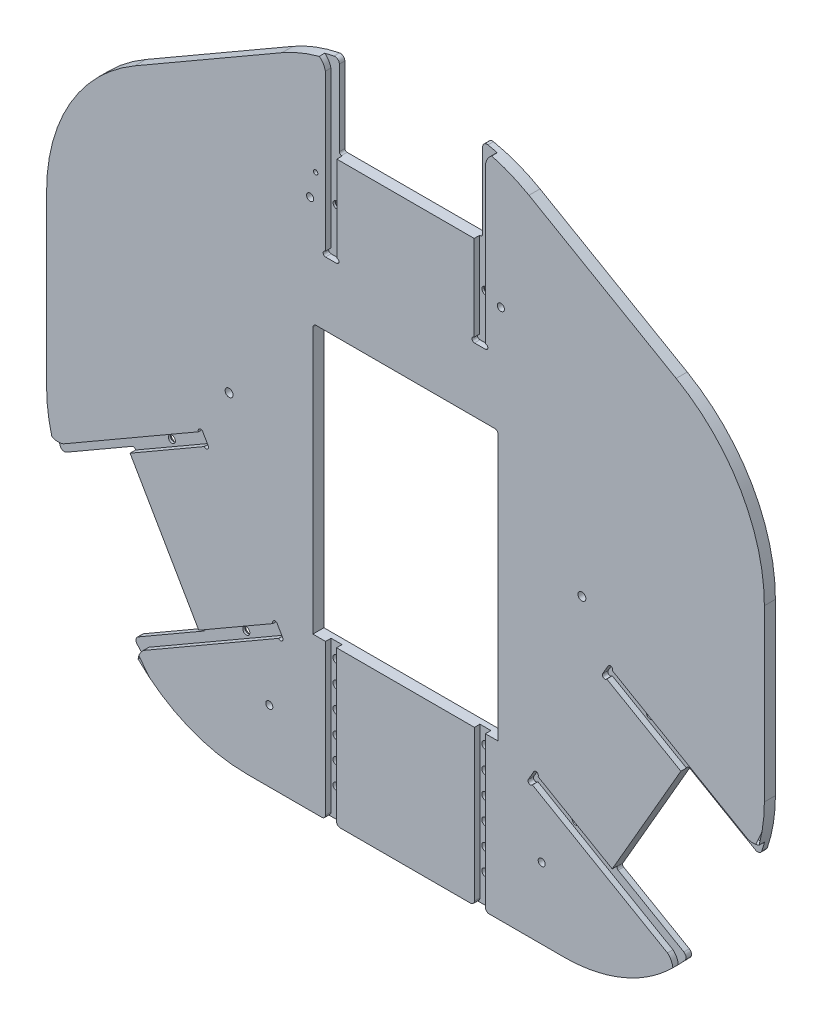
ISO-10303-21;
HEADER;
FILE_DESCRIPTION(('STEP AP214'),'2;1');
FILE_NAME('part.step','',(''),(''),'','','');
FILE_SCHEMA(('AUTOMOTIVE_DESIGN { 1 0 10303 214 1 1 1 1 }'));
ENDSEC;
DATA;
#1=APPLICATION_CONTEXT('core data for automotive mechanical design processes');
#2=APPLICATION_PROTOCOL_DEFINITION('international standard','automotive_design',2000,#1);
#3=PRODUCT_CONTEXT('',#1,'mechanical');
#4=PRODUCT('Part','Part','',(#3));
#5=PRODUCT_RELATED_PRODUCT_CATEGORY('part','',(#4));
#6=PRODUCT_DEFINITION_FORMATION('','',#4);
#7=PRODUCT_DEFINITION_CONTEXT('part definition',#1,'design');
#8=PRODUCT_DEFINITION('design','',#6,#7);
#9=PRODUCT_DEFINITION_SHAPE('','',#8);
#10=(LENGTH_UNIT() NAMED_UNIT(*) SI_UNIT(.MILLI.,.METRE.));
#11=(NAMED_UNIT(*) PLANE_ANGLE_UNIT() SI_UNIT($,.RADIAN.));
#12=(NAMED_UNIT(*) SI_UNIT($,.STERADIAN.) SOLID_ANGLE_UNIT());
#13=UNCERTAINTY_MEASURE_WITH_UNIT(LENGTH_MEASURE(1.E-05),#10,'distance_accuracy_value','');
#14=(GEOMETRIC_REPRESENTATION_CONTEXT(3) GLOBAL_UNCERTAINTY_ASSIGNED_CONTEXT((#13)) GLOBAL_UNIT_ASSIGNED_CONTEXT((#10,
#11,#12)) REPRESENTATION_CONTEXT('',''));
#15=CARTESIAN_POINT('',(0.,0.,0.));
#16=DIRECTION('',(0.,0.,1.));
#17=DIRECTION('',(1.,0.,0.));
#18=AXIS2_PLACEMENT_3D('',#15,#16,#17);
#19=CARTESIAN_POINT('',(36.2501514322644,-56.3665452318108,2.5));
#20=DIRECTION('',(0.,0.,1.));
#21=DIRECTION('',(1.,0.,0.));
#22=AXIS2_PLACEMENT_3D('',#19,#20,#21);
#23=PLANE('',#22);
#24=CARTESIAN_POINT('',(33.7512981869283,-92.7655131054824,2.5));
#25=DIRECTION('',(0.,0.,1.));
#26=DIRECTION('',(1.,0.,0.));
#27=AXIS2_PLACEMENT_3D('',#24,#25,#26);
#28=CIRCLE('',#27,1.65);
#29=CARTESIAN_POINT('',(35.4012981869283,-92.7655131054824,2.5));
#30=VERTEX_POINT('',#29);
#31=EDGE_CURVE('E723',#30,#30,#28,.T.);
#32=ORIENTED_EDGE('',*,*,#31,.F.);
#33=EDGE_LOOP('',(#32));
#34=FACE_BOUND('',#33,.T.);
#35=CARTESIAN_POINT('',(33.7516039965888,-102.765513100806,2.5));
#36=DIRECTION('',(0.,0.,1.));
#37=DIRECTION('',(1.,0.,0.));
#38=AXIS2_PLACEMENT_3D('',#35,#36,#37);
#39=CIRCLE('',#38,1.65);
#40=CARTESIAN_POINT('',(35.4016039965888,-102.765513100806,2.5));
#41=VERTEX_POINT('',#40);
#42=EDGE_CURVE('E726',#41,#41,#39,.T.);
#43=ORIENTED_EDGE('',*,*,#42,.F.);
#44=EDGE_LOOP('',(#43));
#45=FACE_BOUND('',#44,.T.);
#46=CARTESIAN_POINT('',(33.7519098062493,-112.76551309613,2.5));
#47=DIRECTION('',(0.,0.,1.));
#48=DIRECTION('',(1.,0.,0.));
#49=AXIS2_PLACEMENT_3D('',#46,#47,#48);
#50=CIRCLE('',#49,1.65);
#51=CARTESIAN_POINT('',(35.4019098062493,-112.76551309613,2.5));
#52=VERTEX_POINT('',#51);
#53=EDGE_CURVE('E733',#52,#52,#50,.T.);
#54=ORIENTED_EDGE('',*,*,#53,.F.);
#55=EDGE_LOOP('',(#54));
#56=FACE_BOUND('',#55,.T.);
#57=CARTESIAN_POINT('',(33.7522156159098,-122.765513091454,2.5));
#58=DIRECTION('',(0.,0.,1.));
#59=DIRECTION('',(1.,0.,0.));
#60=AXIS2_PLACEMENT_3D('',#57,#58,#59);
#61=CIRCLE('',#60,1.65);
#62=CARTESIAN_POINT('',(35.4022156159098,-122.765513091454,2.5));
#63=VERTEX_POINT('',#62);
#64=EDGE_CURVE('E751',#63,#63,#61,.T.);
#65=ORIENTED_EDGE('',*,*,#64,.F.);
#66=EDGE_LOOP('',(#65));
#67=FACE_BOUND('',#66,.T.);
#68=CARTESIAN_POINT('',(33.7506865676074,-72.7655131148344,2.5));
#69=DIRECTION('',(0.,0.,1.));
#70=DIRECTION('',(1.,0.,0.));
#71=AXIS2_PLACEMENT_3D('',#68,#69,#70);
#72=CIRCLE('',#71,1.65);
#73=CARTESIAN_POINT('',(35.4006865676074,-72.7655131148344,2.5));
#74=VERTEX_POINT('',#73);
#75=EDGE_CURVE('E759',#74,#74,#72,.T.);
#76=ORIENTED_EDGE('',*,*,#75,.F.);
#77=EDGE_LOOP('',(#76));
#78=FACE_BOUND('',#77,.T.);
#79=CARTESIAN_POINT('',(33.7509923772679,-82.7655131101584,2.5));
#80=DIRECTION('',(0.,0.,1.));
#81=DIRECTION('',(1.,0.,0.));
#82=AXIS2_PLACEMENT_3D('',#79,#80,#81);
#83=CIRCLE('',#82,1.65);
#84=CARTESIAN_POINT('',(35.4009923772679,-82.7655131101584,2.5));
#85=VERTEX_POINT('',#84);
#86=EDGE_CURVE('E1501',#85,#85,#83,.T.);
#87=ORIENTED_EDGE('',*,*,#86,.F.);
#88=EDGE_LOOP('',(#87));
#89=FACE_BOUND('',#88,.T.);
#90=DIRECTION('',(-1.52904830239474E-05,0.999999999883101,0.));
#91=VECTOR('',#90,1.);
#92=CARTESIAN_POINT('',(36.2501461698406,-57.4665452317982,2.5));
#93=LINE('',#92,#91);
#94=CARTESIAN_POINT('',(36.2513163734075,-133.998042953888,2.5));
#95=VERTEX_POINT('',#94);
#96=CARTESIAN_POINT('',(36.250272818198,-65.7493677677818,2.5));
#97=VERTEX_POINT('',#96);
#98=EDGE_CURVE('E1511',#95,#97,#93,.T.);
#99=ORIENTED_EDGE('',*,*,#98,.T.);
#100=DIRECTION('',(-0.999999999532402,-3.05809660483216E-05,0.));
#101=VECTOR('',#100,1.);
#102=CARTESIAN_POINT('',(36.2504383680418,-65.7493677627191,2.5));
#103=LINE('',#102,#101);
#104=CARTESIAN_POINT('',(31.2501514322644,-65.7495206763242,2.5));
#105=VERTEX_POINT('',#104);
#106=EDGE_CURVE('E1595',#97,#105,#103,.T.);
#107=ORIENTED_EDGE('',*,*,#106,.T.);
#108=DIRECTION('',(0.,-1.,0.));
#109=VECTOR('',#108,1.);
#110=CARTESIAN_POINT('',(31.2501514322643,-135.697539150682,2.5));
#111=LINE('',#110,#109);
#112=CARTESIAN_POINT('',(31.2501514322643,-133.998016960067,2.5));
#113=VERTEX_POINT('',#112);
#114=EDGE_CURVE('E699',#105,#113,#111,.T.);
#115=ORIENTED_EDGE('',*,*,#114,.T.);
#116=CARTESIAN_POINT('',(29.5501514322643,-133.998016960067,2.5));
#117=DIRECTION('',(0.,0.,1.));
#118=DIRECTION('',(1.,0.,0.));
#119=AXIS2_PLACEMENT_3D('',#116,#117,#118);
#120=CIRCLE('',#119,1.7);
#121=CARTESIAN_POINT('',(29.5501514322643,-135.698016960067,2.5));
#122=VERTEX_POINT('',#121);
#123=EDGE_CURVE('E702',#122,#113,#120,.T.);
#124=ORIENTED_EDGE('',*,*,#123,.F.);
#125=DIRECTION('',(-1.,0.,0.));
#126=VECTOR('',#125,1.);
#127=CARTESIAN_POINT('',(-71.7657834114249,-135.698016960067,2.5));
#128=LINE('',#127,#126);
#129=CARTESIAN_POINT('',(37.9513163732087,-135.698016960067,2.5));
#130=VERTEX_POINT('',#129);
#131=EDGE_CURVE('E696',#130,#122,#128,.T.);
#132=ORIENTED_EDGE('',*,*,#131,.F.);
#133=CARTESIAN_POINT('',(37.9513163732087,-133.998016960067,2.5));
#134=DIRECTION('',(0.,0.,1.));
#135=DIRECTION('',(1.,0.,0.));
#136=AXIS2_PLACEMENT_3D('',#133,#134,#135);
#137=CIRCLE('',#136,1.7);
#138=EDGE_CURVE('E1491',#95,#130,#137,.T.);
#139=ORIENTED_EDGE('',*,*,#138,.F.);
#140=EDGE_LOOP('',(#99,#107,#115,#124,#132,#139));
#141=FACE_BOUND('',#140,.T.);
#142=ADVANCED_FACE('F19',(#34,#45,#56,#67,#78,#89,#141),#23,.T.);
#143=CARTESIAN_POINT('',(31.2501514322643,-135.697539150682,2.5));
#144=DIRECTION('',(-1.,0.,0.));
#145=DIRECTION('',(0.,-1.,0.));
#146=AXIS2_PLACEMENT_3D('',#143,#144,#145);
#147=PLANE('',#146);
#148=DIRECTION('',(0.,0.,-1.));
#149=VECTOR('',#148,1.);
#150=CARTESIAN_POINT('',(31.2501514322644,-65.7495206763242,2.5));
#151=LINE('',#150,#149);
#152=CARTESIAN_POINT('',(31.2501514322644,-65.7495206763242,5.));
#153=VERTEX_POINT('',#152);
#154=EDGE_CURVE('E37',#153,#105,#151,.T.);
#155=ORIENTED_EDGE('',*,*,#154,.F.);
#156=DIRECTION('',(0.,-1.,0.));
#157=VECTOR('',#156,1.);
#158=CARTESIAN_POINT('',(31.2501514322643,-135.697539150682,5.));
#159=LINE('',#158,#157);
#160=CARTESIAN_POINT('',(31.2501514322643,-133.998016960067,5.));
#161=VERTEX_POINT('',#160);
#162=EDGE_CURVE('E681',#153,#161,#159,.T.);
#163=ORIENTED_EDGE('',*,*,#162,.T.);
#164=DIRECTION('',(0.,0.,-1.));
#165=VECTOR('',#164,1.);
#166=CARTESIAN_POINT('',(31.2501514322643,-133.998016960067,2.5));
#167=LINE('',#166,#165);
#168=EDGE_CURVE('E703',#161,#113,#167,.T.);
#169=ORIENTED_EDGE('',*,*,#168,.T.);
#170=ORIENTED_EDGE('',*,*,#114,.F.);
#171=EDGE_LOOP('',(#155,#163,#169,#170));
#172=FACE_BOUND('',#171,.T.);
#173=ADVANCED_FACE('F1592',(#172),#147,.F.);
#174=CARTESIAN_POINT('',(36.2501461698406,-57.4665452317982,2.5));
#175=DIRECTION('',(0.999999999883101,1.52904830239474E-05,0.));
#176=DIRECTION('',(-1.52904830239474E-05,0.999999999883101,0.));
#177=AXIS2_PLACEMENT_3D('',#174,#175,#176);
#178=PLANE('',#177);
#179=DIRECTION('',(0.,0.,1.));
#180=VECTOR('',#179,1.);
#181=CARTESIAN_POINT('',(36.250272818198,-65.7493677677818,2.5));
#182=LINE('',#181,#180);
#183=CARTESIAN_POINT('',(36.250272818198,-65.7493677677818,5.));
#184=VERTEX_POINT('',#183);
#185=EDGE_CURVE('E674',#97,#184,#182,.T.);
#186=ORIENTED_EDGE('',*,*,#185,.F.);
#187=ORIENTED_EDGE('',*,*,#98,.F.);
#188=DIRECTION('',(0.,0.,1.));
#189=VECTOR('',#188,1.);
#190=CARTESIAN_POINT('',(36.2513163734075,-133.998042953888,5.));
#191=LINE('',#190,#189);
#192=CARTESIAN_POINT('',(36.2513163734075,-133.998042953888,5.));
#193=VERTEX_POINT('',#192);
#194=EDGE_CURVE('E677',#95,#193,#191,.T.);
#195=ORIENTED_EDGE('',*,*,#194,.T.);
#196=DIRECTION('',(-1.52904830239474E-05,0.999999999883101,0.));
#197=VECTOR('',#196,1.);
#198=CARTESIAN_POINT('',(36.2501461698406,-57.4665452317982,5.));
#199=LINE('',#198,#197);
#200=EDGE_CURVE('E666',#193,#184,#199,.T.);
#201=ORIENTED_EDGE('',*,*,#200,.T.);
#202=EDGE_LOOP('',(#186,#187,#195,#201));
#203=FACE_BOUND('',#202,.T.);
#204=ADVANCED_FACE('F672',(#203),#178,.F.);
#205=CARTESIAN_POINT('',(-36.2498927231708,-56.3676537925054,2.5));
#206=DIRECTION('',(0.,0.,-1.));
#207=DIRECTION('',(-1.,0.,0.));
#208=AXIS2_PLACEMENT_3D('',#205,#206,#207);
#209=PLANE('',#208);
#210=CARTESIAN_POINT('',(-33.7484737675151,-102.767577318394,2.5));
#211=DIRECTION('',(0.,0.,-1.));
#212=DIRECTION('',(-1.,0.,0.));
#213=AXIS2_PLACEMENT_3D('',#210,#211,#212);
#214=CIRCLE('',#213,1.65);
#215=CARTESIAN_POINT('',(-35.3984737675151,-102.767577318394,2.5));
#216=VERTEX_POINT('',#215);
#217=EDGE_CURVE('E1562',#216,#216,#214,.T.);
#218=ORIENTED_EDGE('',*,*,#217,.T.);
#219=EDGE_LOOP('',(#218));
#220=FACE_BOUND('',#219,.T.);
#221=CARTESIAN_POINT('',(-33.7481679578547,-112.767577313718,2.5));
#222=DIRECTION('',(0.,0.,-1.));
#223=DIRECTION('',(-1.,0.,0.));
#224=AXIS2_PLACEMENT_3D('',#221,#222,#223);
#225=CIRCLE('',#224,1.65);
#226=CARTESIAN_POINT('',(-35.3981679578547,-112.767577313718,2.5));
#227=VERTEX_POINT('',#226);
#228=EDGE_CURVE('E1566',#227,#227,#225,.T.);
#229=ORIENTED_EDGE('',*,*,#228,.T.);
#230=EDGE_LOOP('',(#229));
#231=FACE_BOUND('',#230,.T.);
#232=CARTESIAN_POINT('',(-33.7478621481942,-122.767577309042,2.5));
#233=DIRECTION('',(0.,0.,-1.));
#234=DIRECTION('',(-1.,0.,0.));
#235=AXIS2_PLACEMENT_3D('',#232,#233,#234);
#236=CIRCLE('',#235,1.65);
#237=CARTESIAN_POINT('',(-35.3978621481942,-122.767577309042,2.5));
#238=VERTEX_POINT('',#237);
#239=EDGE_CURVE('E1535',#238,#238,#236,.T.);
#240=ORIENTED_EDGE('',*,*,#239,.T.);
#241=EDGE_LOOP('',(#240));
#242=FACE_BOUND('',#241,.T.);
#243=CARTESIAN_POINT('',(-33.7493911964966,-72.7675773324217,2.5));
#244=DIRECTION('',(0.,0.,-1.));
#245=DIRECTION('',(-1.,0.,0.));
#246=AXIS2_PLACEMENT_3D('',#243,#244,#245);
#247=CIRCLE('',#246,1.65);
#248=CARTESIAN_POINT('',(-35.3993911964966,-72.7675773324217,2.5));
#249=VERTEX_POINT('',#248);
#250=EDGE_CURVE('E1530',#249,#249,#247,.T.);
#251=ORIENTED_EDGE('',*,*,#250,.T.);
#252=EDGE_LOOP('',(#251));
#253=FACE_BOUND('',#252,.T.);
#254=CARTESIAN_POINT('',(-33.7490853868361,-82.7675773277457,2.5));
#255=DIRECTION('',(0.,0.,-1.));
#256=DIRECTION('',(-1.,0.,0.));
#257=AXIS2_PLACEMENT_3D('',#254,#255,#256);
#258=CIRCLE('',#257,1.65);
#259=CARTESIAN_POINT('',(-35.3990853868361,-82.7675773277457,2.5));
#260=VERTEX_POINT('',#259);
#261=EDGE_CURVE('E1534',#260,#260,#258,.T.);
#262=ORIENTED_EDGE('',*,*,#261,.T.);
#263=EDGE_LOOP('',(#262));
#264=FACE_BOUND('',#263,.T.);
#265=CARTESIAN_POINT('',(-33.7487795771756,-92.7675773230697,2.5));
#266=DIRECTION('',(0.,0.,-1.));
#267=DIRECTION('',(-1.,0.,0.));
#268=AXIS2_PLACEMENT_3D('',#265,#266,#267);
#269=CIRCLE('',#268,1.65);
#270=CARTESIAN_POINT('',(-35.3987795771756,-92.7675773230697,2.5));
#271=VERTEX_POINT('',#270);
#272=EDGE_CURVE('E1550',#271,#271,#269,.T.);
#273=ORIENTED_EDGE('',*,*,#272,.T.);
#274=EDGE_LOOP('',(#273));
#275=FACE_BOUND('',#274,.T.);
#276=DIRECTION('',(0.999999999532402,3.05809660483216E-05,0.));
#277=VECTOR('',#276,1.);
#278=CARTESIAN_POINT('',(-36.2496057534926,-65.7515848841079,2.5));
#279=LINE('',#278,#277);
#280=CARTESIAN_POINT('',(-36.2497271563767,-65.7515848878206,2.5));
#281=VERTEX_POINT('',#280);
#282=CARTESIAN_POINT('',(-31.2496057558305,-65.7514319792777,2.5));
#283=VERTEX_POINT('',#282);
#284=EDGE_CURVE('E1623',#281,#283,#279,.T.);
#285=ORIENTED_EDGE('',*,*,#284,.F.);
#286=DIRECTION('',(-1.52904830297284E-05,0.999999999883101,0.));
#287=VECTOR('',#286,1.);
#288=CARTESIAN_POINT('',(-36.2486194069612,-138.198571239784,2.5));
#289=LINE('',#288,#287);
#290=CARTESIAN_POINT('',(-36.2486836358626,-133.997990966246,2.5));
#291=VERTEX_POINT('',#290);
#292=EDGE_CURVE('E1446',#291,#281,#289,.T.);
#293=ORIENTED_EDGE('',*,*,#292,.F.);
#294=CARTESIAN_POINT('',(-37.9486836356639,-133.998016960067,2.5));
#295=DIRECTION('',(0.,0.,-1.));
#296=DIRECTION('',(-1.,0.,0.));
#297=AXIS2_PLACEMENT_3D('',#294,#295,#296);
#298=CIRCLE('',#297,1.7);
#299=CARTESIAN_POINT('',(-37.9486836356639,-135.698016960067,2.5));
#300=VERTEX_POINT('',#299);
#301=EDGE_CURVE('E1458',#291,#300,#298,.T.);
#302=ORIENTED_EDGE('',*,*,#301,.T.);
#303=DIRECTION('',(1.,0.,0.));
#304=VECTOR('',#303,1.);
#305=CARTESIAN_POINT('',(-71.7657834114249,-135.698016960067,2.5));
#306=LINE('',#305,#304);
#307=CARTESIAN_POINT('',(-29.5475187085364,-135.698016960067,2.5));
#308=VERTEX_POINT('',#307);
#309=EDGE_CURVE('E871',#300,#308,#306,.T.);
#310=ORIENTED_EDGE('',*,*,#309,.T.);
#311=CARTESIAN_POINT('',(-29.5475187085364,-133.998016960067,2.5));
#312=DIRECTION('',(0.,0.,-1.));
#313=DIRECTION('',(-1.,0.,0.));
#314=AXIS2_PLACEMENT_3D('',#311,#312,#313);
#315=CIRCLE('',#314,1.7);
#316=CARTESIAN_POINT('',(-31.2475187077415,-133.998068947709,2.5));
#317=VERTEX_POINT('',#316);
#318=EDGE_CURVE('E1449',#308,#317,#315,.T.);
#319=ORIENTED_EDGE('',*,*,#318,.T.);
#320=DIRECTION('',(3.05809660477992E-05,-0.999999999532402,0.));
#321=VECTOR('',#320,1.);
#322=CARTESIAN_POINT('',(-31.2474667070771,-135.698494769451,2.5));
#323=LINE('',#322,#321);
#324=EDGE_CURVE('E704',#283,#317,#323,.T.);
#325=ORIENTED_EDGE('',*,*,#324,.F.);
#326=EDGE_LOOP('',(#285,#293,#302,#310,#319,#325));
#327=FACE_BOUND('',#326,.T.);
#328=ADVANCED_FACE('F1609',(#220,#231,#242,#253,#264,#275,#327),#209,.F.);
#329=CARTESIAN_POINT('',(-36.2498538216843,-57.4676537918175,2.5));
#330=DIRECTION('',(0.999999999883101,1.52904830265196E-05,0.));
#331=DIRECTION('',(-1.52904830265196E-05,0.999999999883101,0.));
#332=AXIS2_PLACEMENT_3D('',#329,#330,#331);
#333=PLANE('',#332);
#334=ORIENTED_EDGE('',*,*,#292,.T.);
#335=DIRECTION('',(0.,0.,1.));
#336=VECTOR('',#335,1.);
#337=CARTESIAN_POINT('',(-36.2497271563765,-65.7515848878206,2.5));
#338=LINE('',#337,#336);
#339=CARTESIAN_POINT('',(-36.2497271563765,-65.7515848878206,5.));
#340=VERTEX_POINT('',#339);
#341=EDGE_CURVE('E5391',#281,#340,#338,.T.);
#342=ORIENTED_EDGE('',*,*,#341,.T.);
#343=DIRECTION('',(-1.52904830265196E-05,0.999999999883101,0.));
#344=VECTOR('',#343,1.);
#345=CARTESIAN_POINT('',(-36.2498538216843,-57.4676537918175,5.));
#346=LINE('',#345,#344);
#347=CARTESIAN_POINT('',(-36.2486836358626,-133.997990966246,5.));
#348=VERTEX_POINT('',#347);
#349=EDGE_CURVE('E645',#348,#340,#346,.T.);
#350=ORIENTED_EDGE('',*,*,#349,.F.);
#351=DIRECTION('',(0.,0.,1.));
#352=VECTOR('',#351,1.);
#353=CARTESIAN_POINT('',(-36.2486836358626,-133.997990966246,2.5));
#354=LINE('',#353,#352);
#355=EDGE_CURVE('E1450',#291,#348,#354,.T.);
#356=ORIENTED_EDGE('',*,*,#355,.F.);
#357=EDGE_LOOP('',(#334,#342,#350,#356));
#358=FACE_BOUND('',#357,.T.);
#359=ADVANCED_FACE('F3853',(#358),#333,.T.);
#360=CARTESIAN_POINT('',(-31.2474667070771,-135.698494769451,2.5));
#361=DIRECTION('',(-0.999999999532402,-3.05809660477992E-05,0.));
#362=DIRECTION('',(3.05809660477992E-05,-0.999999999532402,0.));
#363=AXIS2_PLACEMENT_3D('',#360,#361,#362);
#364=PLANE('',#363);
#365=DIRECTION('',(3.05809660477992E-05,-0.999999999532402,0.));
#366=VECTOR('',#365,1.);
#367=CARTESIAN_POINT('',(-31.2474667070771,-135.698494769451,5.));
#368=LINE('',#367,#366);
#369=CARTESIAN_POINT('',(-31.2496057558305,-65.7514319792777,5.));
#370=VERTEX_POINT('',#369);
#371=CARTESIAN_POINT('',(-31.2475187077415,-133.998068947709,5.));
#372=VERTEX_POINT('',#371);
#373=EDGE_CURVE('E1436',#370,#372,#368,.T.);
#374=ORIENTED_EDGE('',*,*,#373,.F.);
#375=DIRECTION('',(0.,0.,-1.));
#376=VECTOR('',#375,1.);
#377=CARTESIAN_POINT('',(-31.2496057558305,-65.7514319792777,2.5));
#378=LINE('',#377,#376);
#379=EDGE_CURVE('E627',#370,#283,#378,.T.);
#380=ORIENTED_EDGE('',*,*,#379,.T.);
#381=ORIENTED_EDGE('',*,*,#324,.T.);
#382=DIRECTION('',(0.,0.,-1.));
#383=VECTOR('',#382,1.);
#384=CARTESIAN_POINT('',(-31.2475187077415,-133.998068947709,2.5));
#385=LINE('',#384,#383);
#386=EDGE_CURVE('E1460',#372,#317,#385,.T.);
#387=ORIENTED_EDGE('',*,*,#386,.F.);
#388=EDGE_LOOP('',(#374,#380,#381,#387));
#389=FACE_BOUND('',#388,.T.);
#390=ADVANCED_FACE('F3845',(#389),#364,.T.);
#391=CARTESIAN_POINT('',(21.0105752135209,95.,5.));
#392=DIRECTION('',(0.,0.,-1.));
#393=DIRECTION('',(-1.,0.,0.));
#394=AXIS2_PLACEMENT_3D('',#391,#392,#393);
#395=PLANE('',#394);
#396=DIRECTION('',(-0.999999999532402,-3.05809660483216E-05,0.));
#397=VECTOR('',#396,1.);
#398=CARTESIAN_POINT('',(42.004592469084,-65.7491917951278,5.));
#399=LINE('',#398,#397);
#400=EDGE_CURVE('E647',#153,#370,#399,.T.);
#401=ORIENTED_EDGE('',*,*,#400,.T.);
#402=ORIENTED_EDGE('',*,*,#373,.T.);
#403=CARTESIAN_POINT('',(-29.5475187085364,-133.998016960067,5.));
#404=DIRECTION('',(0.,0.,-1.));
#405=DIRECTION('',(-1.,0.,0.));
#406=AXIS2_PLACEMENT_3D('',#403,#404,#405);
#407=CIRCLE('',#406,1.7);
#408=CARTESIAN_POINT('',(-29.5475187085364,-135.698016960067,5.));
#409=VERTEX_POINT('',#408);
#410=EDGE_CURVE('E1439',#409,#372,#407,.T.);
#411=ORIENTED_EDGE('',*,*,#410,.F.);
#412=DIRECTION('',(-1.,0.,0.));
#413=VECTOR('',#412,1.);
#414=CARTESIAN_POINT('',(-71.7657834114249,-135.698016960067,5.));
#415=LINE('',#414,#413);
#416=CARTESIAN_POINT('',(29.5501514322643,-135.698016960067,5.));
#417=VERTEX_POINT('',#416);
#418=EDGE_CURVE('E766',#417,#409,#415,.T.);
#419=ORIENTED_EDGE('',*,*,#418,.F.);
#420=CARTESIAN_POINT('',(29.5501514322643,-133.998016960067,5.));
#421=DIRECTION('',(0.,0.,-1.));
#422=DIRECTION('',(-1.,0.,0.));
#423=AXIS2_PLACEMENT_3D('',#420,#421,#422);
#424=CIRCLE('',#423,1.7);
#425=EDGE_CURVE('E688',#161,#417,#424,.T.);
#426=ORIENTED_EDGE('',*,*,#425,.F.);
#427=ORIENTED_EDGE('',*,*,#162,.F.);
#428=EDGE_LOOP('',(#401,#402,#411,#419,#426,#427));
#429=FACE_BOUND('',#428,.T.);
#430=ADVANCED_FACE('F3836',(#429),#395,.F.);
#431=CARTESIAN_POINT('',(-80.,10.0412284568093,5.));
#432=DIRECTION('',(0.,0.,-1.));
#433=DIRECTION('',(-1.,0.,0.));
#434=AXIS2_PLACEMENT_3D('',#431,#432,#433);
#435=CIRCLE('',#434,1.8);
#436=CARTESIAN_POINT('',(-81.8,10.0412284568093,5.));
#437=VERTEX_POINT('',#436);
#438=EDGE_CURVE('E5445',#437,#437,#435,.T.);
#439=ORIENTED_EDGE('',*,*,#438,.T.);
#440=EDGE_LOOP('',(#439));
#441=FACE_BOUND('',#440,.T.);
#442=CARTESIAN_POINT('',(80.,10.0412284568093,5.));
#443=DIRECTION('',(0.,0.,-1.));
#444=DIRECTION('',(-1.,0.,0.));
#445=AXIS2_PLACEMENT_3D('',#442,#443,#444);
#446=CIRCLE('',#445,1.8);
#447=CARTESIAN_POINT('',(78.2,10.0412284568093,5.));
#448=VERTEX_POINT('',#447);
#449=EDGE_CURVE('E648',#448,#448,#446,.T.);
#450=ORIENTED_EDGE('',*,*,#449,.T.);
#451=EDGE_LOOP('',(#450));
#452=FACE_BOUND('',#451,.T.);
#453=CARTESIAN_POINT('',(-61.7735025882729,-103.505155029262,5.));
#454=DIRECTION('',(0.,0.,-1.));
#455=DIRECTION('',(-1.,0.,0.));
#456=AXIS2_PLACEMENT_3D('',#453,#454,#455);
#457=CIRCLE('',#456,1.6);
#458=CARTESIAN_POINT('',(-63.3735025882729,-103.505155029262,5.));
#459=VERTEX_POINT('',#458);
#460=EDGE_CURVE('E2256',#459,#459,#457,.T.);
#461=ORIENTED_EDGE('',*,*,#460,.T.);
#462=EDGE_LOOP('',(#461));
#463=FACE_BOUND('',#462,.T.);
#464=CARTESIAN_POINT('',(61.7735025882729,-103.505155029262,5.));
#465=DIRECTION('',(0.,0.,-1.));
#466=DIRECTION('',(-1.,0.,0.));
#467=AXIS2_PLACEMENT_3D('',#464,#465,#466);
#468=CIRCLE('',#467,1.6);
#469=CARTESIAN_POINT('',(60.1735025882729,-103.505155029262,5.));
#470=VERTEX_POINT('',#469);
#471=EDGE_CURVE('E2249',#470,#470,#468,.T.);
#472=ORIENTED_EDGE('',*,*,#471,.T.);
#473=EDGE_LOOP('',(#472));
#474=FACE_BOUND('',#473,.T.);
#475=CARTESIAN_POINT('',(-43.2499611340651,105.250554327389,5.));
#476=DIRECTION('',(0.,0.,-1.));
#477=DIRECTION('',(-1.,0.,0.));
#478=AXIS2_PLACEMENT_3D('',#475,#476,#477);
#479=CIRCLE('',#478,1.6);
#480=CARTESIAN_POINT('',(-44.8499611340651,105.250554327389,5.));
#481=VERTEX_POINT('',#480);
#482=EDGE_CURVE('E789',#481,#481,#479,.T.);
#483=ORIENTED_EDGE('',*,*,#482,.T.);
#484=EDGE_LOOP('',(#483));
#485=FACE_BOUND('',#484,.T.);
#486=CARTESIAN_POINT('',(43.2537665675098,105.250554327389,5.));
#487=DIRECTION('',(0.,0.,-1.));
#488=DIRECTION('',(-1.,0.,0.));
#489=AXIS2_PLACEMENT_3D('',#486,#487,#488);
#490=CIRCLE('',#489,1.6);
#491=CARTESIAN_POINT('',(41.6537665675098,105.250554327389,5.));
#492=VERTEX_POINT('',#491);
#493=EDGE_CURVE('E784',#492,#492,#490,.T.);
#494=ORIENTED_EDGE('',*,*,#493,.T.);
#495=EDGE_LOOP('',(#494));
#496=FACE_BOUND('',#495,.T.);
#497=CARTESIAN_POINT('',(-40.7499611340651,116.250554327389,5.));
#498=DIRECTION('',(0.,0.,-1.));
#499=DIRECTION('',(-1.,0.,0.));
#500=AXIS2_PLACEMENT_3D('',#497,#498,#499);
#501=CIRCLE('',#500,1.);
#502=CARTESIAN_POINT('',(-41.7499611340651,116.250554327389,5.));
#503=VERTEX_POINT('',#502);
#504=EDGE_CURVE('E1441',#503,#503,#501,.T.);
#505=ORIENTED_EDGE('',*,*,#504,.T.);
#506=EDGE_LOOP('',(#505));
#507=FACE_BOUND('',#506,.T.);
#508=CARTESIAN_POINT('',(-41.9954074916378,-65.7517605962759,5.));
#509=VERTEX_POINT('',#508);
#510=EDGE_CURVE('E622',#340,#509,#399,.T.);
#511=ORIENTED_EDGE('',*,*,#510,.T.);
#512=DIRECTION('',(-3.05809660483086E-05,0.999999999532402,0.));
#513=VECTOR('',#512,1.);
#514=CARTESIAN_POINT('',(-41.9954074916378,-65.7517605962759,5.));
#515=LINE('',#514,#513);
#516=CARTESIAN_POINT('',(-41.9990924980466,54.7482393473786,5.));
#517=VERTEX_POINT('',#516);
#518=EDGE_CURVE('E631',#509,#517,#515,.T.);
#519=ORIENTED_EDGE('',*,*,#518,.T.);
#520=CARTESIAN_POINT('',(-40.499092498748,54.7482852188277,5.));
#521=DIRECTION('',(0.,0.,-1.));
#522=DIRECTION('',(3.05809660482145E-05,-0.999999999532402,0.));
#523=AXIS2_PLACEMENT_3D('',#520,#521,#522);
#524=CIRCLE('',#523,1.5);
#525=CARTESIAN_POINT('',(-40.4991383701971,56.2482852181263,5.));
#526=VERTEX_POINT('',#525);
#527=EDGE_CURVE('E638',#517,#526,#524,.T.);
#528=ORIENTED_EDGE('',*,*,#527,.T.);
#529=DIRECTION('',(0.999999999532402,3.05809660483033E-05,0.));
#530=VECTOR('',#529,1.);
#531=CARTESIAN_POINT('',(-40.4991383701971,56.2482852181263,5.));
#532=LINE('',#531,#530);
#533=CARTESIAN_POINT('',(40.5008615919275,56.2507622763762,5.));
#534=VERTEX_POINT('',#533);
#535=EDGE_CURVE('E5419',#526,#534,#532,.T.);
#536=ORIENTED_EDGE('',*,*,#535,.T.);
#537=CARTESIAN_POINT('',(40.5009074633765,54.7507622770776,5.));
#538=DIRECTION('',(0.,0.,-1.));
#539=DIRECTION('',(3.05809660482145E-05,-0.999999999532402,0.));
#540=AXIS2_PLACEMENT_3D('',#537,#538,#539);
#541=CIRCLE('',#540,1.5);
#542=CARTESIAN_POINT('',(42.0009074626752,54.7508081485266,5.));
#543=VERTEX_POINT('',#542);
#544=EDGE_CURVE('E5413',#534,#543,#541,.T.);
#545=ORIENTED_EDGE('',*,*,#544,.T.);
#546=DIRECTION('',(3.0580966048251E-05,-0.999999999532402,0.));
#547=VECTOR('',#546,1.);
#548=CARTESIAN_POINT('',(42.0009074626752,54.7508081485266,5.));
#549=LINE('',#548,#547);
#550=CARTESIAN_POINT('',(42.004592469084,-65.7491917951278,5.));
#551=VERTEX_POINT('',#550);
#552=EDGE_CURVE('E669',#543,#551,#549,.T.);
#553=ORIENTED_EDGE('',*,*,#552,.T.);
#554=EDGE_CURVE('E639',#551,#184,#399,.T.);
#555=ORIENTED_EDGE('',*,*,#554,.T.);
#556=ORIENTED_EDGE('',*,*,#200,.F.);
#557=CARTESIAN_POINT('',(37.9513163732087,-133.998016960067,5.));
#558=DIRECTION('',(0.,0.,-1.));
#559=DIRECTION('',(-1.,0.,0.));
#560=AXIS2_PLACEMENT_3D('',#557,#558,#559);
#561=CIRCLE('',#560,1.7);
#562=CARTESIAN_POINT('',(37.9513163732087,-135.698016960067,5.));
#563=VERTEX_POINT('',#562);
#564=EDGE_CURVE('E680',#563,#193,#561,.T.);
#565=ORIENTED_EDGE('',*,*,#564,.F.);
#566=DIRECTION('',(-1.,0.,0.));
#567=VECTOR('',#566,1.);
#568=CARTESIAN_POINT('',(-71.7657834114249,-135.698016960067,5.));
#569=LINE('',#568,#567);
#570=CARTESIAN_POINT('',(71.7684681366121,-135.698016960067,5.));
#571=VERTEX_POINT('',#570);
#572=EDGE_CURVE('E760',#571,#563,#569,.T.);
#573=ORIENTED_EDGE('',*,*,#572,.F.);
#574=CARTESIAN_POINT('',(71.768468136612,-65.6980169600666,5.));
#575=DIRECTION('',(0.,0.,-1.));
#576=DIRECTION('',(1.,0.,0.));
#577=AXIS2_PLACEMENT_3D('',#574,#575,#576);
#578=CIRCLE('',#577,70.);
#579=CARTESIAN_POINT('',(121.317099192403,-115.144282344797,5.));
#580=VERTEX_POINT('',#579);
#581=EDGE_CURVE('E686',#580,#571,#578,.T.);
#582=ORIENTED_EDGE('',*,*,#581,.F.);
#583=DIRECTION('',(-0.730412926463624,-0.683005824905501,0.));
#584=VECTOR('',#583,1.);
#585=CARTESIAN_POINT('',(121.262839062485,-115.19502074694,5.));
#586=LINE('',#585,#584);
#587=CARTESIAN_POINT('',(121.262839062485,-115.19502074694,5.));
#588=VERTEX_POINT('',#587);
#589=EDGE_CURVE('E933',#580,#588,#586,.T.);
#590=ORIENTED_EDGE('',*,*,#589,.T.);
#591=CARTESIAN_POINT('',(114.300813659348,-115.923170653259,5.));
#592=DIRECTION('',(0.,0.,1.));
#593=DIRECTION('',(1.,0.,0.));
#594=AXIS2_PLACEMENT_3D('',#591,#592,#593);
#595=CIRCLE('',#594,7.);
#596=CARTESIAN_POINT('',(118.812918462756,-110.57145034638,5.));
#597=VERTEX_POINT('',#596);
#598=EDGE_CURVE('E937',#588,#597,#595,.T.);
#599=ORIENTED_EDGE('',*,*,#598,.T.);
#600=DIRECTION('',(0.866025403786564,-0.499999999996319,0.));
#601=VECTOR('',#600,1.);
#602=CARTESIAN_POINT('',(56.5344955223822,-74.6149860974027,5.));
#603=LINE('',#602,#601);
#604=CARTESIAN_POINT('',(57.551877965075,-75.2023721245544,5.));
#605=VERTEX_POINT('',#604);
#606=EDGE_CURVE('E949',#605,#597,#603,.T.);
#607=ORIENTED_EDGE('',*,*,#606,.F.);
#608=CARTESIAN_POINT('',(56.6531398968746,-74.5681246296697,5.));
#609=DIRECTION('',(0.,0.,-1.));
#610=DIRECTION('',(1.,0.,0.));
#611=AXIS2_PLACEMENT_3D('',#608,#609,#610);
#612=CIRCLE('',#611,1.1);
#613=CARTESIAN_POINT('',(55.7005203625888,-74.0181100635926,5.));
#614=VERTEX_POINT('',#613);
#615=EDGE_CURVE('E1111',#605,#614,#612,.T.);
#616=ORIENTED_EDGE('',*,*,#615,.T.);
#617=DIRECTION('',(0.500013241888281,0.866017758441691,0.));
#618=VECTOR('',#617,1.);
#619=CARTESIAN_POINT('',(55.7005203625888,-74.0181100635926,5.));
#620=LINE('',#619,#618);
#621=CARTESIAN_POINT('',(58.2005865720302,-69.6880212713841,5.));
#622=VERTEX_POINT('',#621);
#623=EDGE_CURVE('E2483',#614,#622,#620,.T.);
#624=ORIENTED_EDGE('',*,*,#623,.T.);
#625=CARTESIAN_POINT('',(59.1532061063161,-70.2380358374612,5.));
#626=DIRECTION('',(0.,0.,-1.));
#627=DIRECTION('',(-1.,0.,0.));
#628=AXIS2_PLACEMENT_3D('',#625,#626,#627);
#629=CIRCLE('',#628,1.1);
#630=CARTESIAN_POINT('',(60.1519292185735,-70.6990696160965,5.));
#631=VERTEX_POINT('',#630);
#632=EDGE_CURVE('E1127',#622,#631,#629,.T.);
#633=ORIENTED_EDGE('',*,*,#632,.T.);
#634=DIRECTION('',(-0.866025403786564,0.499999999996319,0.));
#635=VECTOR('',#634,1.);
#636=CARTESIAN_POINT('',(123.204285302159,-107.102364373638,5.));
#637=LINE('',#636,#635);
#638=CARTESIAN_POINT('',(93.7600944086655,-90.1027528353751,5.));
#639=VERTEX_POINT('',#638);
#640=EDGE_CURVE('E1122',#639,#631,#637,.T.);
#641=ORIENTED_EDGE('',*,*,#640,.F.);
#642=DIRECTION('',(0.5,0.866025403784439,0.));
#643=VECTOR('',#642,1.);
#644=CARTESIAN_POINT('',(93.0850360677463,-91.2719881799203,5.));
#645=LINE('',#644,#643);
#646=CARTESIAN_POINT('',(124.910094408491,-36.1493701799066,5.));
#647=VERTEX_POINT('',#646);
#648=EDGE_CURVE('E1126',#639,#647,#645,.T.);
#649=ORIENTED_EDGE('',*,*,#648,.T.);
#650=DIRECTION('',(-0.866025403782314,0.500000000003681,0.));
#651=VECTOR('',#650,1.);
#652=CARTESIAN_POINT('',(154.354285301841,-53.1489817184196,5.));
#653=LINE('',#652,#651);
#654=CARTESIAN_POINT('',(91.3035959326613,-16.7466492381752,5.));
#655=VERTEX_POINT('',#654);
#656=EDGE_CURVE('E1190',#647,#655,#653,.T.);
#657=ORIENTED_EDGE('',*,*,#656,.T.);
#658=CARTESIAN_POINT('',(90.4048834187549,-16.112365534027,5.));
#659=DIRECTION('',(0.,0.,1.));
#660=DIRECTION('',(1.,0.,0.));
#661=AXIS2_PLACEMENT_3D('',#658,#659,#660);
#662=CIRCLE('',#661,1.1);
#663=CARTESIAN_POINT('',(89.4522807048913,-15.5623218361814,5.));
#664=VERTEX_POINT('',#663);
#665=EDGE_CURVE('E1194',#664,#655,#662,.T.);
#666=ORIENTED_EDGE('',*,*,#665,.F.);
#667=DIRECTION('',(-0.500039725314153,-0.866002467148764,0.));
#668=VECTOR('',#667,1.);
#669=CARTESIAN_POINT('',(91.952479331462,-11.2323095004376,5.));
#670=LINE('',#669,#668);
#671=CARTESIAN_POINT('',(91.952479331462,-11.2323095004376,5.));
#672=VERTEX_POINT('',#671);
#673=EDGE_CURVE('E2459',#672,#664,#670,.T.);
#674=ORIENTED_EDGE('',*,*,#673,.F.);
#675=CARTESIAN_POINT('',(92.9050820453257,-11.7823531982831,5.));
#676=DIRECTION('',(0.,0.,1.));
#677=DIRECTION('',(-1.,0.,0.));
#678=AXIS2_PLACEMENT_3D('',#675,#676,#677);
#679=CIRCLE('',#678,1.1);
#680=CARTESIAN_POINT('',(93.9037865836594,-12.2434272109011,5.));
#681=VERTEX_POINT('',#680);
#682=EDGE_CURVE('E1171',#681,#672,#679,.T.);
#683=ORIENTED_EDGE('',*,*,#682,.F.);
#684=DIRECTION('',(0.866025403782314,-0.500000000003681,0.));
#685=VECTOR('',#684,1.);
#686=CARTESIAN_POINT('',(92.9287974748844,-11.6805169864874,5.));
#687=LINE('',#686,#685);
#688=CARTESIAN_POINT('',(155.186610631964,-47.6250821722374,5.));
#689=VERTEX_POINT('',#688);
#690=EDGE_CURVE('E1167',#681,#689,#687,.T.);
#691=ORIENTED_EDGE('',*,*,#690,.T.);
#692=CARTESIAN_POINT('',(157.541650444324,-41.0331334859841,5.));
#693=DIRECTION('',(0.,0.,-1.));
#694=DIRECTION('',(1.,0.,0.));
#695=AXIS2_PLACEMENT_3D('',#692,#693,#694);
#696=CIRCLE('',#695,7.);
#697=CARTESIAN_POINT('',(160.39167579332,-47.4266736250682,5.));
#698=VERTEX_POINT('',#697);
#699=EDGE_CURVE('E910',#698,#689,#696,.T.);
#700=ORIENTED_EDGE('',*,*,#699,.F.);
#701=DIRECTION('',(0.226353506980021,0.974045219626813,0.));
#702=VECTOR('',#701,1.);
#703=CARTESIAN_POINT('',(160.39167579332,-47.4266736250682,5.));
#704=LINE('',#703,#702);
#705=CARTESIAN_POINT('',(160.38229730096,-47.4670311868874,5.));
#706=VERTEX_POINT('',#705);
#707=EDGE_CURVE('E905',#706,#698,#704,.T.);
#708=ORIENTED_EDGE('',*,*,#707,.F.);
#709=CARTESIAN_POINT('',(92.7790433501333,-29.3066331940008,5.));
#710=DIRECTION('',(0.,0.,-1.));
#711=DIRECTION('',(-1.,0.,0.));
#712=AXIS2_PLACEMENT_3D('',#709,#710,#711);
#713=CIRCLE('',#712,70.);
#714=CARTESIAN_POINT('',(162.779043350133,-29.3066331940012,5.));
#715=VERTEX_POINT('',#714);
#716=EDGE_CURVE('E909',#715,#706,#713,.T.);
#717=ORIENTED_EDGE('',*,*,#716,.F.);
#718=DIRECTION('',(0.,-1.,0.));
#719=VECTOR('',#718,1.);
#720=CARTESIAN_POINT('',(162.779043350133,-29.3066331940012,5.));
#721=LINE('',#720,#719);
#722=CARTESIAN_POINT('',(162.779043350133,47.7909529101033,5.));
#723=VERTEX_POINT('',#722);
#724=EDGE_CURVE('E2433',#723,#715,#721,.T.);
#725=ORIENTED_EDGE('',*,*,#724,.F.);
#726=CARTESIAN_POINT('',(82.779043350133,47.7909529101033,5.));
#727=DIRECTION('',(0.,0.,-1.));
#728=DIRECTION('',(-1.,0.,0.));
#729=AXIS2_PLACEMENT_3D('',#726,#727,#728);
#730=CIRCLE('',#729,80.);
#731=CARTESIAN_POINT('',(122.779043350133,117.072985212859,5.));
#732=VERTEX_POINT('',#731);
#733=EDGE_CURVE('E2427',#732,#723,#730,.T.);
#734=ORIENTED_EDGE('',*,*,#733,.F.);
#735=DIRECTION('',(0.86602540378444,-0.5,0.));
#736=VECTOR('',#735,1.);
#737=CARTESIAN_POINT('',(56.0105752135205,155.621778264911,5.));
#738=LINE('',#737,#736);
#739=CARTESIAN_POINT('',(56.0105752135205,155.621778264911,5.));
#740=VERTEX_POINT('',#739);
#741=EDGE_CURVE('E2420',#740,#732,#738,.T.);
#742=ORIENTED_EDGE('',*,*,#741,.F.);
#743=CARTESIAN_POINT('',(21.0105752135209,95.,5.));
#744=DIRECTION('',(0.,0.,-1.));
#745=DIRECTION('',(1.,0.,0.));
#746=AXIS2_PLACEMENT_3D('',#743,#744,#745);
#747=CIRCLE('',#746,70.);
#748=CARTESIAN_POINT('',(39.1250331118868,162.615578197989,5.));
#749=VERTEX_POINT('',#748);
#750=EDGE_CURVE('E2414',#749,#740,#747,.T.);
#751=ORIENTED_EDGE('',*,*,#750,.F.);
#752=CARTESIAN_POINT('',(43.2374890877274,156.950977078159,5.));
#753=DIRECTION('',(0.,0.,1.));
#754=DIRECTION('',(1.,0.,0.));
#755=AXIS2_PLACEMENT_3D('',#752,#753,#754);
#756=CIRCLE('',#755,7.);
#757=CARTESIAN_POINT('',(36.3499999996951,158.200974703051,5.));
#758=VERTEX_POINT('',#757);
#759=EDGE_CURVE('E1207',#749,#758,#756,.T.);
#760=ORIENTED_EDGE('',*,*,#759,.T.);
#761=DIRECTION('',(-4.25067388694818E-12,1.,0.));
#762=VECTOR('',#761,1.);
#763=CARTESIAN_POINT('',(36.35,86.5236557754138,5.));
#764=LINE('',#763,#762);
#765=CARTESIAN_POINT('',(36.3499999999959,87.4442326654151,5.));
#766=VERTEX_POINT('',#765);
#767=EDGE_CURVE('E1202',#766,#758,#764,.T.);
#768=ORIENTED_EDGE('',*,*,#767,.F.);
#769=CARTESIAN_POINT('',(36.2500441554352,86.3487835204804,5.));
#770=DIRECTION('',(0.,0.,-1.));
#771=DIRECTION('',(-1.,0.,0.));
#772=AXIS2_PLACEMENT_3D('',#769,#770,#771);
#773=CIRCLE('',#772,1.1);
#774=CARTESIAN_POINT('',(36.2500777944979,85.2487835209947,5.));
#775=VERTEX_POINT('',#774);
#776=EDGE_CURVE('E1206',#766,#775,#773,.T.);
#777=ORIENTED_EDGE('',*,*,#776,.T.);
#778=DIRECTION('',(-0.999999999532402,-3.05809660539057E-05,0.));
#779=VECTOR('',#778,1.);
#780=CARTESIAN_POINT('',(36.2500777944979,85.2487835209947,5.));
#781=LINE('',#780,#779);
#782=CARTESIAN_POINT('',(31.2500777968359,85.2486306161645,5.));
#783=VERTEX_POINT('',#782);
#784=EDGE_CURVE('E2396',#775,#783,#781,.T.);
#785=ORIENTED_EDGE('',*,*,#784,.T.);
#786=CARTESIAN_POINT('',(31.2500441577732,86.3486306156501,5.));
#787=DIRECTION('',(0.,0.,-1.));
#788=DIRECTION('',(1.,0.,0.));
#789=AXIS2_PLACEMENT_3D('',#786,#787,#788);
#790=CIRCLE('',#789,1.1);
#791=CARTESIAN_POINT('',(31.1499999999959,87.4440716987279,5.));
#792=VERTEX_POINT('',#791);
#793=EDGE_CURVE('E1227',#783,#792,#790,.T.);
#794=ORIENTED_EDGE('',*,*,#793,.T.);
#795=DIRECTION('',(4.25067388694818E-12,-1.,0.));
#796=VECTOR('',#795,1.);
#797=CARTESIAN_POINT('',(31.149999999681,161.523655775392,5.));
#798=LINE('',#797,#796);
#799=CARTESIAN_POINT('',(31.149999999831,126.250476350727,5.));
#800=VERTEX_POINT('',#799);
#801=EDGE_CURVE('E1222',#800,#792,#798,.T.);
#802=ORIENTED_EDGE('',*,*,#801,.F.);
#803=DIRECTION('',(0.999999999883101,1.52904830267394E-05,0.));
#804=VECTOR('',#803,1.);
#805=CARTESIAN_POINT('',(-32.5005880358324,126.249503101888,5.));
#806=LINE('',#805,#804);
#807=CARTESIAN_POINT('',(-31.1499999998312,126.249523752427,5.));
#808=VERTEX_POINT('',#807);
#809=EDGE_CURVE('E1219',#808,#800,#806,.T.);
#810=ORIENTED_EDGE('',*,*,#809,.F.);
#811=DIRECTION('',(-4.2499337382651E-12,-1.,0.));
#812=VECTOR('',#811,1.);
#813=CARTESIAN_POINT('',(-31.1499999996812,161.523655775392,5.));
#814=LINE('',#813,#812);
#815=CARTESIAN_POINT('',(-31.149999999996,87.4431200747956,5.));
#816=VERTEX_POINT('',#815);
#817=EDGE_CURVE('E1226',#808,#816,#814,.T.);
#818=ORIENTED_EDGE('',*,*,#817,.T.);
#819=CARTESIAN_POINT('',(-31.25,86.3476749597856,5.));
#820=DIRECTION('',(0.,0.,1.));
#821=DIRECTION('',(-1.,0.,0.));
#822=AXIS2_PLACEMENT_3D('',#819,#820,#821);
#823=CIRCLE('',#822,1.1);
#824=CARTESIAN_POINT('',(-31.25,85.2476749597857,5.));
#825=VERTEX_POINT('',#824);
#826=EDGE_CURVE('E1282',#825,#816,#823,.T.);
#827=ORIENTED_EDGE('',*,*,#826,.F.);
#828=DIRECTION('',(1.,0.,0.));
#829=VECTOR('',#828,1.);
#830=CARTESIAN_POINT('',(-36.25,85.2476749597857,5.));
#831=LINE('',#830,#829);
#832=CARTESIAN_POINT('',(-36.25,85.2476749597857,5.));
#833=VERTEX_POINT('',#832);
#834=EDGE_CURVE('E2376',#833,#825,#831,.T.);
#835=ORIENTED_EDGE('',*,*,#834,.F.);
#836=CARTESIAN_POINT('',(-36.25,86.3476749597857,5.));
#837=DIRECTION('',(0.,0.,1.));
#838=DIRECTION('',(1.,0.,0.));
#839=AXIS2_PLACEMENT_3D('',#836,#837,#838);
#840=CIRCLE('',#839,1.1);
#841=CARTESIAN_POINT('',(-36.3499999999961,87.4431200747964,5.));
#842=VERTEX_POINT('',#841);
#843=EDGE_CURVE('E1266',#842,#833,#840,.T.);
#844=ORIENTED_EDGE('',*,*,#843,.F.);
#845=DIRECTION('',(4.2499337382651E-12,1.,0.));
#846=VECTOR('',#845,1.);
#847=CARTESIAN_POINT('',(-36.35,86.5236557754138,5.));
#848=LINE('',#847,#846);
#849=CARTESIAN_POINT('',(-36.3499999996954,158.187942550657,5.));
#850=VERTEX_POINT('',#849);
#851=EDGE_CURVE('E1261',#842,#850,#848,.T.);
#852=ORIENTED_EDGE('',*,*,#851,.T.);
#853=CARTESIAN_POINT('',(-43.239604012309,156.949654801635,5.));
#854=DIRECTION('',(0.,0.,-1.));
#855=DIRECTION('',(1.,0.,0.));
#856=AXIS2_PLACEMENT_3D('',#853,#854,#855);
#857=CIRCLE('',#856,7.);
#858=CARTESIAN_POINT('',(-39.1279083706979,162.614807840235,5.));
#859=VERTEX_POINT('',#858);
#860=EDGE_CURVE('E1265',#859,#850,#857,.T.);
#861=ORIENTED_EDGE('',*,*,#860,.F.);
#862=CARTESIAN_POINT('',(-21.0105752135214,95.,5.));
#863=DIRECTION('',(0.,0.,-1.));
#864=DIRECTION('',(1.,0.,0.));
#865=AXIS2_PLACEMENT_3D('',#862,#863,#864);
#866=CIRCLE('',#865,70.);
#867=CARTESIAN_POINT('',(-56.0105752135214,155.621778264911,5.));
#868=VERTEX_POINT('',#867);
#869=EDGE_CURVE('E2357',#868,#859,#866,.T.);
#870=ORIENTED_EDGE('',*,*,#869,.F.);
#871=DIRECTION('',(0.866025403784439,0.5,0.));
#872=VECTOR('',#871,1.);
#873=CARTESIAN_POINT('',(-56.0105752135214,155.621778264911,5.));
#874=LINE('',#873,#872);
#875=CARTESIAN_POINT('',(-122.779043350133,117.072985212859,5.));
#876=VERTEX_POINT('',#875);
#877=EDGE_CURVE('E2351',#876,#868,#874,.T.);
#878=ORIENTED_EDGE('',*,*,#877,.F.);
#879=CARTESIAN_POINT('',(-82.7803856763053,47.7932778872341,5.));
#880=DIRECTION('',(0.,0.,-1.));
#881=DIRECTION('',(1.,0.,0.));
#882=AXIS2_PLACEMENT_3D('',#879,#880,#881);
#883=CIRCLE('',#882,79.9973153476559);
#884=CARTESIAN_POINT('',(-162.777701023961,47.793277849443,5.));
#885=VERTEX_POINT('',#884);
#886=EDGE_CURVE('E2345',#885,#876,#883,.T.);
#887=ORIENTED_EDGE('',*,*,#886,.F.);
#888=DIRECTION('',(-4.72404607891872E-10,1.,0.));
#889=VECTOR('',#888,1.);
#890=CARTESIAN_POINT('',(-162.77770098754,-29.3043081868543,5.));
#891=LINE('',#890,#889);
#892=CARTESIAN_POINT('',(-162.77770098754,-29.3043081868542,5.));
#893=VERTEX_POINT('',#892);
#894=EDGE_CURVE('E2338',#893,#885,#891,.T.);
#895=ORIENTED_EDGE('',*,*,#894,.F.);
#896=CARTESIAN_POINT('',(-92.7777009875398,-29.304308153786,5.));
#897=DIRECTION('',(0.,0.,-1.));
#898=DIRECTION('',(1.,0.,0.));
#899=AXIS2_PLACEMENT_3D('',#896,#897,#898);
#900=CIRCLE('',#899,70.);
#901=CARTESIAN_POINT('',(-160.391090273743,-47.426934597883,5.));
#902=VERTEX_POINT('',#901);
#903=EDGE_CURVE('E968',#902,#893,#900,.T.);
#904=ORIENTED_EDGE('',*,*,#903,.F.);
#905=CARTESIAN_POINT('',(-157.541650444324,-41.0331334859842,5.));
#906=DIRECTION('',(0.,0.,1.));
#907=DIRECTION('',(1.,0.,0.));
#908=AXIS2_PLACEMENT_3D('',#905,#906,#907);
#909=CIRCLE('',#908,7.);
#910=CARTESIAN_POINT('',(-155.186610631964,-47.6250821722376,5.));
#911=VERTEX_POINT('',#910);
#912=EDGE_CURVE('E963',#902,#911,#909,.T.);
#913=ORIENTED_EDGE('',*,*,#912,.T.);
#914=DIRECTION('',(-0.866025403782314,-0.500000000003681,0.));
#915=VECTOR('',#914,1.);
#916=CARTESIAN_POINT('',(-92.9276121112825,-11.6798326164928,5.));
#917=LINE('',#916,#915);
#918=CARTESIAN_POINT('',(-93.9037865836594,-12.2434272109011,5.));
#919=VERTEX_POINT('',#918);
#920=EDGE_CURVE('E967',#919,#911,#917,.T.);
#921=ORIENTED_EDGE('',*,*,#920,.F.);
#922=CARTESIAN_POINT('',(-92.9050820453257,-11.7823531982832,5.));
#923=DIRECTION('',(0.,0.,-1.));
#924=DIRECTION('',(1.,0.,0.));
#925=AXIS2_PLACEMENT_3D('',#922,#923,#924);
#926=CIRCLE('',#925,1.1);
#927=CARTESIAN_POINT('',(-91.952479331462,-11.2323095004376,5.));
#928=VERTEX_POINT('',#927);
#929=EDGE_CURVE('E1067',#919,#928,#926,.T.);
#930=ORIENTED_EDGE('',*,*,#929,.T.);
#931=DIRECTION('',(0.500039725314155,-0.866002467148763,0.));
#932=VECTOR('',#931,1.);
#933=CARTESIAN_POINT('',(-91.952479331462,-11.2323095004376,5.));
#934=LINE('',#933,#932);
#935=CARTESIAN_POINT('',(-89.4522807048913,-15.5623218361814,5.));
#936=VERTEX_POINT('',#935);
#937=EDGE_CURVE('E2321',#928,#936,#934,.T.);
#938=ORIENTED_EDGE('',*,*,#937,.T.);
#939=CARTESIAN_POINT('',(-90.4048834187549,-16.112365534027,5.));
#940=DIRECTION('',(0.,0.,-1.));
#941=DIRECTION('',(-1.,0.,0.));
#942=AXIS2_PLACEMENT_3D('',#939,#940,#941);
#943=CIRCLE('',#942,1.1);
#944=CARTESIAN_POINT('',(-91.3035959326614,-16.7466492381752,5.));
#945=VERTEX_POINT('',#944);
#946=EDGE_CURVE('E1088',#936,#945,#943,.T.);
#947=ORIENTED_EDGE('',*,*,#946,.T.);
#948=DIRECTION('',(0.866025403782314,0.500000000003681,0.));
#949=VECTOR('',#948,1.);
#950=CARTESIAN_POINT('',(-154.354285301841,-53.1489817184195,5.));
#951=LINE('',#950,#949);
#952=CARTESIAN_POINT('',(-124.910094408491,-36.1493701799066,5.));
#953=VERTEX_POINT('',#952);
#954=EDGE_CURVE('E1084',#953,#945,#951,.T.);
#955=ORIENTED_EDGE('',*,*,#954,.F.);
#956=DIRECTION('',(-0.5,0.866025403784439,0.));
#957=VECTOR('',#956,1.);
#958=CARTESIAN_POINT('',(-93.0850360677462,-91.2719881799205,5.));
#959=LINE('',#958,#957);
#960=CARTESIAN_POINT('',(-93.7600944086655,-90.1027528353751,5.));
#961=VERTEX_POINT('',#960);
#962=EDGE_CURVE('E1052',#961,#953,#959,.T.);
#963=ORIENTED_EDGE('',*,*,#962,.F.);
#964=DIRECTION('',(0.866025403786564,0.499999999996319,0.));
#965=VECTOR('',#964,1.);
#966=CARTESIAN_POINT('',(-123.20428530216,-107.102364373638,5.));
#967=LINE('',#966,#965);
#968=CARTESIAN_POINT('',(-60.1519292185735,-70.6990696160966,5.));
#969=VERTEX_POINT('',#968);
#970=EDGE_CURVE('E1047',#961,#969,#967,.T.);
#971=ORIENTED_EDGE('',*,*,#970,.T.);
#972=CARTESIAN_POINT('',(-59.153206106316,-70.2380358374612,5.));
#973=DIRECTION('',(0.,0.,-1.));
#974=DIRECTION('',(1.,0.,0.));
#975=AXIS2_PLACEMENT_3D('',#972,#973,#974);
#976=CIRCLE('',#975,1.1);
#977=CARTESIAN_POINT('',(-58.2005865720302,-69.6880212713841,5.));
#978=VERTEX_POINT('',#977);
#979=EDGE_CURVE('E1051',#969,#978,#976,.T.);
#980=ORIENTED_EDGE('',*,*,#979,.T.);
#981=DIRECTION('',(0.500013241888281,-0.866017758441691,0.));
#982=VECTOR('',#981,1.);
#983=CARTESIAN_POINT('',(-55.7005203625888,-74.0181100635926,5.));
#984=LINE('',#983,#982);
#985=CARTESIAN_POINT('',(-55.7005203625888,-74.0181100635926,5.));
#986=VERTEX_POINT('',#985);
#987=EDGE_CURVE('E2296',#978,#986,#984,.T.);
#988=ORIENTED_EDGE('',*,*,#987,.T.);
#989=CARTESIAN_POINT('',(-56.6531398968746,-74.5681246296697,5.));
#990=DIRECTION('',(0.,0.,-1.));
#991=DIRECTION('',(-1.,0.,0.));
#992=AXIS2_PLACEMENT_3D('',#989,#990,#991);
#993=CIRCLE('',#992,1.1);
#994=CARTESIAN_POINT('',(-57.551877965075,-75.2023721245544,5.));
#995=VERTEX_POINT('',#994);
#996=EDGE_CURVE('E1027',#986,#995,#993,.T.);
#997=ORIENTED_EDGE('',*,*,#996,.T.);
#998=DIRECTION('',(-0.866025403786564,-0.499999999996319,0.));
#999=VECTOR('',#998,1.);
#1000=CARTESIAN_POINT('',(-56.6099611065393,-74.65855617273,5.));
#1001=LINE('',#1000,#999);
#1002=CARTESIAN_POINT('',(-118.812918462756,-110.57145034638,5.));
#1003=VERTEX_POINT('',#1002);
#1004=EDGE_CURVE('E1023',#995,#1003,#1001,.T.);
#1005=ORIENTED_EDGE('',*,*,#1004,.T.);
#1006=CARTESIAN_POINT('',(-114.300813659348,-115.923170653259,5.));
#1007=DIRECTION('',(0.,0.,-1.));
#1008=DIRECTION('',(1.,0.,0.));
#1009=AXIS2_PLACEMENT_3D('',#1006,#1007,#1008);
#1010=CIRCLE('',#1009,7.);
#1011=CARTESIAN_POINT('',(-121.262839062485,-115.19502074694,5.));
#1012=VERTEX_POINT('',#1011);
#1013=EDGE_CURVE('E997',#1012,#1003,#1010,.T.);
#1014=ORIENTED_EDGE('',*,*,#1013,.F.);
#1015=DIRECTION('',(0.730412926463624,-0.683005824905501,0.));
#1016=VECTOR('',#1015,1.);
#1017=CARTESIAN_POINT('',(-121.262839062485,-115.19502074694,5.));
#1018=LINE('',#1017,#1016);
#1019=CARTESIAN_POINT('',(-121.276495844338,-115.18225035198,5.));
#1020=VERTEX_POINT('',#1019);
#1021=EDGE_CURVE('E992',#1020,#1012,#1018,.T.);
#1022=ORIENTED_EDGE('',*,*,#1021,.F.);
#1023=CARTESIAN_POINT('',(-71.7657834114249,-65.6980169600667,5.));
#1024=DIRECTION('',(0.,0.,-1.));
#1025=DIRECTION('',(1.,0.,0.));
#1026=AXIS2_PLACEMENT_3D('',#1023,#1024,#1025);
#1027=CIRCLE('',#1026,70.);
#1028=CARTESIAN_POINT('',(-71.7657834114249,-135.698016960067,5.));
#1029=VERTEX_POINT('',#1028);
#1030=EDGE_CURVE('E996',#1029,#1020,#1027,.T.);
#1031=ORIENTED_EDGE('',*,*,#1030,.F.);
#1032=DIRECTION('',(-1.,0.,0.));
#1033=VECTOR('',#1032,1.);
#1034=CARTESIAN_POINT('',(-71.7657834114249,-135.698016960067,5.));
#1035=LINE('',#1034,#1033);
#1036=CARTESIAN_POINT('',(-37.9486836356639,-135.698016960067,5.));
#1037=VERTEX_POINT('',#1036);
#1038=EDGE_CURVE('E1478',#1037,#1029,#1035,.T.);
#1039=ORIENTED_EDGE('',*,*,#1038,.F.);
#1040=CARTESIAN_POINT('',(-37.9486836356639,-133.998016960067,5.));
#1041=DIRECTION('',(0.,0.,-1.));
#1042=DIRECTION('',(-1.,0.,0.));
#1043=AXIS2_PLACEMENT_3D('',#1040,#1041,#1042);
#1044=CIRCLE('',#1043,1.7);
#1045=EDGE_CURVE('E1442',#348,#1037,#1044,.T.);
#1046=ORIENTED_EDGE('',*,*,#1045,.F.);
#1047=ORIENTED_EDGE('',*,*,#349,.T.);
#1048=EDGE_LOOP('',(#511,#519,#528,#536,#545,#553,#555,#556,#565,#573,#582,#590,#599,#607,#616,
#624,#633,#641,#649,#657,#666,#674,#683,#691,#700,#708,#717,#725,#734,#742,#751,#760,#768,#777,
#785,#794,#802,#810,#818,#827,#835,#844,#852,#861,#870,#878,#887,#895,#904,#913,#921,#930,#938,
#947,#955,#963,#971,#980,#988,#997,#1005,#1014,#1022,#1031,#1039,#1046,#1047));
#1049=FACE_BOUND('',#1048,.T.);
#1050=ADVANCED_FACE('F642',(#441,#452,#463,#474,#485,#496,#507,#1049),#395,.F.);
#1051=CARTESIAN_POINT('',(21.0105752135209,95.,0.));
#1052=DIRECTION('',(0.,0.,-1.));
#1053=DIRECTION('',(-1.,0.,0.));
#1054=AXIS2_PLACEMENT_3D('',#1051,#1052,#1053);
#1055=PLANE('',#1054);
#1056=CARTESIAN_POINT('',(-80.,10.0412284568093,0.));
#1057=DIRECTION('',(0.,0.,1.));
#1058=DIRECTION('',(0.,-1.,0.));
#1059=AXIS2_PLACEMENT_3D('',#1056,#1057,#1058);
#1060=CIRCLE('',#1059,3.47);
#1061=CARTESIAN_POINT('',(-80.,6.57122845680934,0.));
#1062=VERTEX_POINT('',#1061);
#1063=EDGE_CURVE('E5449',#1062,#1062,#1060,.T.);
#1064=ORIENTED_EDGE('',*,*,#1063,.T.);
#1065=EDGE_LOOP('',(#1064));
#1066=FACE_BOUND('',#1065,.T.);
#1067=CARTESIAN_POINT('',(80.,10.0412284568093,0.));
#1068=DIRECTION('',(0.,0.,1.));
#1069=DIRECTION('',(0.,-1.,0.));
#1070=AXIS2_PLACEMENT_3D('',#1067,#1068,#1069);
#1071=CIRCLE('',#1070,3.47);
#1072=CARTESIAN_POINT('',(80.,6.57122845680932,0.));
#1073=VERTEX_POINT('',#1072);
#1074=EDGE_CURVE('E656',#1073,#1073,#1071,.T.);
#1075=ORIENTED_EDGE('',*,*,#1074,.T.);
#1076=EDGE_LOOP('',(#1075));
#1077=FACE_BOUND('',#1076,.T.);
#1078=CARTESIAN_POINT('',(-108.455839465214,-23.6474218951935,0.));
#1079=DIRECTION('',(0.,0.,1.));
#1080=DIRECTION('',(0.,-1.,0.));
#1081=AXIS2_PLACEMENT_3D('',#1078,#1079,#1080);
#1082=CIRCLE('',#1081,3.15);
#1083=CARTESIAN_POINT('',(-108.455839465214,-26.7974218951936,0.));
#1084=VERTEX_POINT('',#1083);
#1085=EDGE_CURVE('E800',#1084,#1084,#1082,.T.);
#1086=ORIENTED_EDGE('',*,*,#1085,.T.);
#1087=EDGE_LOOP('',(#1086));
#1088=FACE_BOUND('',#1087,.T.);
#1089=CARTESIAN_POINT('',(-74.7040537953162,-82.1031010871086,0.));
#1090=DIRECTION('',(0.,0.,1.));
#1091=DIRECTION('',(0.,-1.,0.));
#1092=AXIS2_PLACEMENT_3D('',#1089,#1090,#1091);
#1093=CIRCLE('',#1092,3.15);
#1094=CARTESIAN_POINT('',(-74.7040537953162,-85.2531010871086,0.));
#1095=VERTEX_POINT('',#1094);
#1096=EDGE_CURVE('E796',#1095,#1095,#1093,.T.);
#1097=ORIENTED_EDGE('',*,*,#1096,.T.);
#1098=EDGE_LOOP('',(#1097));
#1099=FACE_BOUND('',#1098,.T.);
#1100=CARTESIAN_POINT('',(-61.7735025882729,-103.505155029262,0.));
#1101=DIRECTION('',(0.,0.,1.));
#1102=DIRECTION('',(0.,-1.,0.));
#1103=AXIS2_PLACEMENT_3D('',#1100,#1101,#1102);
#1104=CIRCLE('',#1103,3.15);
#1105=CARTESIAN_POINT('',(-61.7735025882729,-106.655155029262,0.));
#1106=VERTEX_POINT('',#1105);
#1107=EDGE_CURVE('E801',#1106,#1106,#1104,.T.);
#1108=ORIENTED_EDGE('',*,*,#1107,.T.);
#1109=EDGE_LOOP('',(#1108));
#1110=FACE_BOUND('',#1109,.T.);
#1111=CARTESIAN_POINT('',(-43.2499611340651,105.250554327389,0.));
#1112=DIRECTION('',(0.,0.,1.));
#1113=DIRECTION('',(0.,-1.,0.));
#1114=AXIS2_PLACEMENT_3D('',#1111,#1112,#1113);
#1115=CIRCLE('',#1114,3.15);
#1116=CARTESIAN_POINT('',(-43.2499611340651,102.100554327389,0.));
#1117=VERTEX_POINT('',#1116);
#1118=EDGE_CURVE('E857',#1117,#1117,#1115,.T.);
#1119=ORIENTED_EDGE('',*,*,#1118,.T.);
#1120=EDGE_LOOP('',(#1119));
#1121=FACE_BOUND('',#1120,.T.);
#1122=CARTESIAN_POINT('',(-33.7502287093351,105.747674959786,0.));
#1123=DIRECTION('',(0.,0.,1.));
#1124=DIRECTION('',(0.,-1.,0.));
#1125=AXIS2_PLACEMENT_3D('',#1122,#1123,#1124);
#1126=CIRCLE('',#1125,3.15);
#1127=CARTESIAN_POINT('',(-33.7502287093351,102.597674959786,0.));
#1128=VERTEX_POINT('',#1127);
#1129=EDGE_CURVE('E853',#1128,#1128,#1126,.T.);
#1130=ORIENTED_EDGE('',*,*,#1129,.T.);
#1131=EDGE_LOOP('',(#1130));
#1132=FACE_BOUND('',#1131,.T.);
#1133=CARTESIAN_POINT('',(-33.7493911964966,-72.7675773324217,0.));
#1134=DIRECTION('',(0.,0.,-1.));
#1135=DIRECTION('',(-1.,0.,0.));
#1136=AXIS2_PLACEMENT_3D('',#1133,#1134,#1135);
#1137=CIRCLE('',#1136,1.65);
#1138=CARTESIAN_POINT('',(-35.3993911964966,-72.7675773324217,0.));
#1139=VERTEX_POINT('',#1138);
#1140=EDGE_CURVE('E858',#1139,#1139,#1137,.T.);
#1141=ORIENTED_EDGE('',*,*,#1140,.F.);
#1142=EDGE_LOOP('',(#1141));
#1143=FACE_BOUND('',#1142,.T.);
#1144=CARTESIAN_POINT('',(-33.7490853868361,-82.7675773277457,0.));
#1145=DIRECTION('',(0.,0.,-1.));
#1146=DIRECTION('',(-1.,0.,0.));
#1147=AXIS2_PLACEMENT_3D('',#1144,#1145,#1146);
#1148=CIRCLE('',#1147,1.65);
#1149=CARTESIAN_POINT('',(-35.3990853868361,-82.7675773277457,0.));
#1150=VERTEX_POINT('',#1149);
#1151=EDGE_CURVE('E1529',#1150,#1150,#1148,.T.);
#1152=ORIENTED_EDGE('',*,*,#1151,.F.);
#1153=EDGE_LOOP('',(#1152));
#1154=FACE_BOUND('',#1153,.T.);
#1155=CARTESIAN_POINT('',(-33.7487795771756,-92.7675773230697,0.));
#1156=DIRECTION('',(0.,0.,-1.));
#1157=DIRECTION('',(-1.,0.,0.));
#1158=AXIS2_PLACEMENT_3D('',#1155,#1156,#1157);
#1159=CIRCLE('',#1158,1.65);
#1160=CARTESIAN_POINT('',(-35.3987795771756,-92.7675773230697,0.));
#1161=VERTEX_POINT('',#1160);
#1162=EDGE_CURVE('E1546',#1161,#1161,#1159,.T.);
#1163=ORIENTED_EDGE('',*,*,#1162,.F.);
#1164=EDGE_LOOP('',(#1163));
#1165=FACE_BOUND('',#1164,.T.);
#1166=CARTESIAN_POINT('',(-33.7484737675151,-102.767577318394,0.));
#1167=DIRECTION('',(0.,0.,-1.));
#1168=DIRECTION('',(-1.,0.,0.));
#1169=AXIS2_PLACEMENT_3D('',#1166,#1167,#1168);
#1170=CIRCLE('',#1169,1.65);
#1171=CARTESIAN_POINT('',(-35.3984737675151,-102.767577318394,0.));
#1172=VERTEX_POINT('',#1171);
#1173=EDGE_CURVE('E1554',#1172,#1172,#1170,.T.);
#1174=ORIENTED_EDGE('',*,*,#1173,.F.);
#1175=EDGE_LOOP('',(#1174));
#1176=FACE_BOUND('',#1175,.T.);
#1177=CARTESIAN_POINT('',(-33.7481679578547,-112.767577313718,0.));
#1178=DIRECTION('',(0.,0.,-1.));
#1179=DIRECTION('',(-1.,0.,0.));
#1180=AXIS2_PLACEMENT_3D('',#1177,#1178,#1179);
#1181=CIRCLE('',#1180,1.65);
#1182=CARTESIAN_POINT('',(-35.3981679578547,-112.767577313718,0.));
#1183=VERTEX_POINT('',#1182);
#1184=EDGE_CURVE('E1561',#1183,#1183,#1181,.T.);
#1185=ORIENTED_EDGE('',*,*,#1184,.F.);
#1186=EDGE_LOOP('',(#1185));
#1187=FACE_BOUND('',#1186,.T.);
#1188=CARTESIAN_POINT('',(-33.7478621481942,-122.767577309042,0.));
#1189=DIRECTION('',(0.,0.,-1.));
#1190=DIRECTION('',(-1.,0.,0.));
#1191=AXIS2_PLACEMENT_3D('',#1188,#1189,#1190);
#1192=CIRCLE('',#1191,1.65);
#1193=CARTESIAN_POINT('',(-35.3978621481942,-122.767577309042,0.));
#1194=VERTEX_POINT('',#1193);
#1195=EDGE_CURVE('E1570',#1194,#1194,#1192,.T.);
#1196=ORIENTED_EDGE('',*,*,#1195,.F.);
#1197=EDGE_LOOP('',(#1196));
#1198=FACE_BOUND('',#1197,.T.);
#1199=CARTESIAN_POINT('',(61.7735025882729,-103.505155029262,0.));
#1200=DIRECTION('',(0.,0.,1.));
#1201=DIRECTION('',(0.,-1.,0.));
#1202=AXIS2_PLACEMENT_3D('',#1199,#1200,#1201);
#1203=CIRCLE('',#1202,3.15);
#1204=CARTESIAN_POINT('',(61.7735025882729,-106.655155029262,0.));
#1205=VERTEX_POINT('',#1204);
#1206=EDGE_CURVE('E820',#1205,#1205,#1203,.T.);
#1207=ORIENTED_EDGE('',*,*,#1206,.T.);
#1208=EDGE_LOOP('',(#1207));
#1209=FACE_BOUND('',#1208,.T.);
#1210=CARTESIAN_POINT('',(74.7040537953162,-82.1031010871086,0.));
#1211=DIRECTION('',(0.,0.,1.));
#1212=DIRECTION('',(0.,-1.,0.));
#1213=AXIS2_PLACEMENT_3D('',#1210,#1211,#1212);
#1214=CIRCLE('',#1213,3.15);
#1215=CARTESIAN_POINT('',(74.7040537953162,-85.2531010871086,0.));
#1216=VERTEX_POINT('',#1215);
#1217=EDGE_CURVE('E816',#1216,#1216,#1214,.T.);
#1218=ORIENTED_EDGE('',*,*,#1217,.T.);
#1219=EDGE_LOOP('',(#1218));
#1220=FACE_BOUND('',#1219,.T.);
#1221=CARTESIAN_POINT('',(108.455839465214,-23.6474218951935,0.));
#1222=DIRECTION('',(0.,0.,1.));
#1223=DIRECTION('',(0.,-1.,0.));
#1224=AXIS2_PLACEMENT_3D('',#1221,#1222,#1223);
#1225=CIRCLE('',#1224,3.15);
#1226=CARTESIAN_POINT('',(108.455839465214,-26.7974218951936,0.));
#1227=VERTEX_POINT('',#1226);
#1228=EDGE_CURVE('E821',#1227,#1227,#1225,.T.);
#1229=ORIENTED_EDGE('',*,*,#1228,.T.);
#1230=EDGE_LOOP('',(#1229));
#1231=FACE_BOUND('',#1230,.T.);
#1232=CARTESIAN_POINT('',(33.7497712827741,105.748783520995,0.));
#1233=DIRECTION('',(0.,0.,1.));
#1234=DIRECTION('',(0.,-1.,0.));
#1235=AXIS2_PLACEMENT_3D('',#1232,#1233,#1234);
#1236=CIRCLE('',#1235,3.15);
#1237=CARTESIAN_POINT('',(33.7497712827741,102.598783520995,0.));
#1238=VERTEX_POINT('',#1237);
#1239=EDGE_CURVE('E782',#1238,#1238,#1236,.T.);
#1240=ORIENTED_EDGE('',*,*,#1239,.T.);
#1241=EDGE_LOOP('',(#1240));
#1242=FACE_BOUND('',#1241,.T.);
#1243=CARTESIAN_POINT('',(43.2537665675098,105.250554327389,0.));
#1244=DIRECTION('',(0.,0.,1.));
#1245=DIRECTION('',(0.,-1.,0.));
#1246=AXIS2_PLACEMENT_3D('',#1243,#1244,#1245);
#1247=CIRCLE('',#1246,3.15);
#1248=CARTESIAN_POINT('',(43.2537665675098,102.100554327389,0.));
#1249=VERTEX_POINT('',#1248);
#1250=EDGE_CURVE('E778',#1249,#1249,#1247,.T.);
#1251=ORIENTED_EDGE('',*,*,#1250,.T.);
#1252=EDGE_LOOP('',(#1251));
#1253=FACE_BOUND('',#1252,.T.);
#1254=CARTESIAN_POINT('',(33.7506865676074,-72.7655131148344,0.));
#1255=DIRECTION('',(0.,0.,-1.));
#1256=DIRECTION('',(-1.,0.,0.));
#1257=AXIS2_PLACEMENT_3D('',#1254,#1255,#1256);
#1258=CIRCLE('',#1257,1.65);
#1259=CARTESIAN_POINT('',(32.1006865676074,-72.7655131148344,0.));
#1260=VERTEX_POINT('',#1259);
#1261=EDGE_CURVE('E783',#1260,#1260,#1258,.T.);
#1262=ORIENTED_EDGE('',*,*,#1261,.F.);
#1263=EDGE_LOOP('',(#1262));
#1264=FACE_BOUND('',#1263,.T.);
#1265=CARTESIAN_POINT('',(33.7509923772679,-82.7655131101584,0.));
#1266=DIRECTION('',(0.,0.,-1.));
#1267=DIRECTION('',(-1.,0.,0.));
#1268=AXIS2_PLACEMENT_3D('',#1265,#1266,#1267);
#1269=CIRCLE('',#1268,1.65);
#1270=CARTESIAN_POINT('',(32.1009923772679,-82.7655131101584,0.));
#1271=VERTEX_POINT('',#1270);
#1272=EDGE_CURVE('E1539',#1271,#1271,#1269,.T.);
#1273=ORIENTED_EDGE('',*,*,#1272,.F.);
#1274=EDGE_LOOP('',(#1273));
#1275=FACE_BOUND('',#1274,.T.);
#1276=CARTESIAN_POINT('',(33.7512981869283,-92.7655131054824,0.));
#1277=DIRECTION('',(0.,0.,-1.));
#1278=DIRECTION('',(-1.,0.,0.));
#1279=AXIS2_PLACEMENT_3D('',#1276,#1277,#1278);
#1280=CIRCLE('',#1279,1.65);
#1281=CARTESIAN_POINT('',(32.1012981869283,-92.7655131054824,0.));
#1282=VERTEX_POINT('',#1281);
#1283=EDGE_CURVE('E737',#1282,#1282,#1280,.T.);
#1284=ORIENTED_EDGE('',*,*,#1283,.F.);
#1285=EDGE_LOOP('',(#1284));
#1286=FACE_BOUND('',#1285,.T.);
#1287=CARTESIAN_POINT('',(33.7516039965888,-102.765513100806,0.));
#1288=DIRECTION('',(0.,0.,-1.));
#1289=DIRECTION('',(-1.,0.,0.));
#1290=AXIS2_PLACEMENT_3D('',#1287,#1288,#1289);
#1291=CIRCLE('',#1290,1.65);
#1292=CARTESIAN_POINT('',(32.1016039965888,-102.765513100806,0.));
#1293=VERTEX_POINT('',#1292);
#1294=EDGE_CURVE('E739',#1293,#1293,#1291,.T.);
#1295=ORIENTED_EDGE('',*,*,#1294,.F.);
#1296=EDGE_LOOP('',(#1295));
#1297=FACE_BOUND('',#1296,.T.);
#1298=CARTESIAN_POINT('',(33.7519098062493,-112.76551309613,0.));
#1299=DIRECTION('',(0.,0.,-1.));
#1300=DIRECTION('',(-1.,0.,0.));
#1301=AXIS2_PLACEMENT_3D('',#1298,#1299,#1300);
#1302=CIRCLE('',#1301,1.65);
#1303=CARTESIAN_POINT('',(32.1019098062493,-112.76551309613,0.));
#1304=VERTEX_POINT('',#1303);
#1305=EDGE_CURVE('E742',#1304,#1304,#1302,.T.);
#1306=ORIENTED_EDGE('',*,*,#1305,.F.);
#1307=EDGE_LOOP('',(#1306));
#1308=FACE_BOUND('',#1307,.T.);
#1309=CARTESIAN_POINT('',(33.7522156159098,-122.765513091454,0.));
#1310=DIRECTION('',(0.,0.,-1.));
#1311=DIRECTION('',(-1.,0.,0.));
#1312=AXIS2_PLACEMENT_3D('',#1309,#1310,#1311);
#1313=CIRCLE('',#1312,1.65);
#1314=CARTESIAN_POINT('',(32.1022156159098,-122.765513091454,0.));
#1315=VERTEX_POINT('',#1314);
#1316=EDGE_CURVE('E747',#1315,#1315,#1313,.T.);
#1317=ORIENTED_EDGE('',*,*,#1316,.F.);
#1318=EDGE_LOOP('',(#1317));
#1319=FACE_BOUND('',#1318,.T.);
#1320=DIRECTION('',(-1.,0.,0.));
#1321=VECTOR('',#1320,1.);
#1322=CARTESIAN_POINT('',(-71.7657834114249,-135.698016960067,0.));
#1323=LINE('',#1322,#1321);
#1324=CARTESIAN_POINT('',(71.7684681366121,-135.698016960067,0.));
#1325=VERTEX_POINT('',#1324);
#1326=CARTESIAN_POINT('',(-71.7657834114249,-135.698016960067,0.));
#1327=VERTEX_POINT('',#1326);
#1328=EDGE_CURVE('E5379',#1325,#1327,#1323,.T.);
#1329=ORIENTED_EDGE('',*,*,#1328,.T.);
#1330=CARTESIAN_POINT('',(-71.7657834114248,-65.6980169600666,0.));
#1331=DIRECTION('',(0.,0.,-1.));
#1332=DIRECTION('',(1.,0.,0.));
#1333=AXIS2_PLACEMENT_3D('',#1330,#1331,#1332);
#1334=CIRCLE('',#1333,70.);
#1335=CARTESIAN_POINT('',(-124.240636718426,-112.027162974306,0.));
#1336=VERTEX_POINT('',#1335);
#1337=EDGE_CURVE('E1317',#1327,#1336,#1334,.T.);
#1338=ORIENTED_EDGE('',*,*,#1337,.T.);
#1339=CARTESIAN_POINT('',(-122.741355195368,-110.703473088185,0.));
#1340=DIRECTION('',(0.,0.,-1.));
#1341=DIRECTION('',(-1.,0.,0.));
#1342=AXIS2_PLACEMENT_3D('',#1339,#1340,#1341);
#1343=CIRCLE('',#1342,2.);
#1344=CARTESIAN_POINT('',(-123.741355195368,-108.971422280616,0.));
#1345=VERTEX_POINT('',#1344);
#1346=EDGE_CURVE('E1312',#1336,#1345,#1343,.T.);
#1347=ORIENTED_EDGE('',*,*,#1346,.T.);
#1348=DIRECTION('',(0.866025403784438,0.5,0.));
#1349=VECTOR('',#1348,1.);
#1350=CARTESIAN_POINT('',(-88.7549090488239,-88.7719881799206,0.));
#1351=LINE('',#1350,#1349);
#1352=CARTESIAN_POINT('',(-93.9510614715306,-91.7719881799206,0.));
#1353=VERTEX_POINT('',#1352);
#1354=EDGE_CURVE('E1316',#1345,#1353,#1351,.T.);
#1355=ORIENTED_EDGE('',*,*,#1354,.T.);
#1356=CARTESIAN_POINT('',(-94.4510614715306,-90.9059627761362,0.));
#1357=DIRECTION('',(0.,0.,-1.));
#1358=DIRECTION('',(-1.,0.,0.));
#1359=AXIS2_PLACEMENT_3D('',#1356,#1357,#1358);
#1360=CIRCLE('',#1359,1.);
#1361=CARTESIAN_POINT('',(-93.5850360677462,-90.4059627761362,0.));
#1362=VERTEX_POINT('',#1361);
#1363=EDGE_CURVE('E5365',#1362,#1353,#1360,.T.);
#1364=ORIENTED_EDGE('',*,*,#1363,.F.);
#1365=DIRECTION('',(0.5,-0.866025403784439,0.));
#1366=VECTOR('',#1365,1.);
#1367=CARTESIAN_POINT('',(-125.585036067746,-34.980336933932,0.));
#1368=LINE('',#1367,#1366);
#1369=CARTESIAN_POINT('',(-125.085036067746,-35.8463623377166,0.));
#1370=VERTEX_POINT('',#1369);
#1371=EDGE_CURVE('E5360',#1370,#1362,#1368,.T.);
#1372=ORIENTED_EDGE('',*,*,#1371,.F.);
#1373=CARTESIAN_POINT('',(-125.951061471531,-36.3463623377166,0.));
#1374=DIRECTION('',(0.,0.,-1.));
#1375=DIRECTION('',(-1.,0.,0.));
#1376=AXIS2_PLACEMENT_3D('',#1373,#1374,#1375);
#1377=CIRCLE('',#1376,1.);
#1378=CARTESIAN_POINT('',(-126.451061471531,-35.4803369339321,0.));
#1379=VERTEX_POINT('',#1378);
#1380=EDGE_CURVE('E5355',#1379,#1370,#1377,.T.);
#1381=ORIENTED_EDGE('',*,*,#1380,.F.);
#1382=DIRECTION('',(-0.866025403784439,-0.5,0.));
#1383=VECTOR('',#1382,1.);
#1384=CARTESIAN_POINT('',(-121.254909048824,-32.4803369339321,0.));
#1385=LINE('',#1384,#1383);
#1386=CARTESIAN_POINT('',(-156.241355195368,-52.6797710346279,0.));
#1387=VERTEX_POINT('',#1386);
#1388=EDGE_CURVE('E1350',#1379,#1387,#1385,.T.);
#1389=ORIENTED_EDGE('',*,*,#1388,.T.);
#1390=CARTESIAN_POINT('',(-157.241355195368,-50.947720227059,0.));
#1391=DIRECTION('',(0.,0.,-1.));
#1392=DIRECTION('',(-1.,0.,0.));
#1393=AXIS2_PLACEMENT_3D('',#1390,#1391,#1392);
#1394=CIRCLE('',#1393,2.);
#1395=CARTESIAN_POINT('',(-159.13734502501,-51.5842911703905,0.));
#1396=VERTEX_POINT('',#1395);
#1397=EDGE_CURVE('E1345',#1387,#1396,#1394,.T.);
#1398=ORIENTED_EDGE('',*,*,#1397,.T.);
#1399=CARTESIAN_POINT('',(-92.7777009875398,-29.304308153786,0.));
#1400=DIRECTION('',(0.,0.,-1.));
#1401=DIRECTION('',(1.,0.,0.));
#1402=AXIS2_PLACEMENT_3D('',#1399,#1400,#1401);
#1403=CIRCLE('',#1402,70.);
#1404=CARTESIAN_POINT('',(-162.77770098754,-29.3043081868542,0.));
#1405=VERTEX_POINT('',#1404);
#1406=EDGE_CURVE('E1349',#1396,#1405,#1403,.T.);
#1407=ORIENTED_EDGE('',*,*,#1406,.T.);
#1408=DIRECTION('',(-4.72404607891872E-10,1.,0.));
#1409=VECTOR('',#1408,1.);
#1410=CARTESIAN_POINT('',(-162.77770098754,-29.3043081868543,0.));
#1411=LINE('',#1410,#1409);
#1412=CARTESIAN_POINT('',(-162.777701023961,47.793277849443,0.));
#1413=VERTEX_POINT('',#1412);
#1414=EDGE_CURVE('E5339',#1405,#1413,#1411,.T.);
#1415=ORIENTED_EDGE('',*,*,#1414,.T.);
#1416=CARTESIAN_POINT('',(-82.7803856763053,47.7932778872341,0.));
#1417=DIRECTION('',(0.,0.,-1.));
#1418=DIRECTION('',(1.,0.,0.));
#1419=AXIS2_PLACEMENT_3D('',#1416,#1417,#1418);
#1420=CIRCLE('',#1419,79.9973153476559);
#1421=CARTESIAN_POINT('',(-122.779043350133,117.072985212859,0.));
#1422=VERTEX_POINT('',#1421);
#1423=EDGE_CURVE('E5334',#1413,#1422,#1420,.T.);
#1424=ORIENTED_EDGE('',*,*,#1423,.T.);
#1425=DIRECTION('',(0.866025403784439,0.5,0.));
#1426=VECTOR('',#1425,1.);
#1427=CARTESIAN_POINT('',(-56.0105752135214,155.621778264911,0.));
#1428=LINE('',#1427,#1426);
#1429=CARTESIAN_POINT('',(-56.0105752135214,155.621778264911,0.));
#1430=VERTEX_POINT('',#1429);
#1431=EDGE_CURVE('E5338',#1422,#1430,#1428,.T.);
#1432=ORIENTED_EDGE('',*,*,#1431,.T.);
#1433=CARTESIAN_POINT('',(-21.0105752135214,95.,0.));
#1434=DIRECTION('',(0.,0.,-1.));
#1435=DIRECTION('',(1.,0.,0.));
#1436=AXIS2_PLACEMENT_3D('',#1433,#1434,#1435);
#1437=CIRCLE('',#1436,70.);
#1438=CARTESIAN_POINT('',(-34.8979103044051,163.608614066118,0.));
#1439=VERTEX_POINT('',#1438);
#1440=EDGE_CURVE('E1374',#1430,#1439,#1437,.T.);
#1441=ORIENTED_EDGE('',*,*,#1440,.T.);
#1442=CARTESIAN_POINT('',(-34.5011293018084,161.648367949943,0.));
#1443=DIRECTION('',(0.,0.,-1.));
#1444=DIRECTION('',(-1.,0.,0.));
#1445=AXIS2_PLACEMENT_3D('',#1442,#1443,#1444);
#1446=CIRCLE('',#1445,2.);
#1447=CARTESIAN_POINT('',(-32.5011293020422,161.648398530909,0.));
#1448=VERTEX_POINT('',#1447);
#1449=EDGE_CURVE('E1369',#1439,#1448,#1446,.T.);
#1450=ORIENTED_EDGE('',*,*,#1449,.T.);
#1451=DIRECTION('',(-1.52904830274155E-05,0.999999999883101,0.));
#1452=VECTOR('',#1451,1.);
#1453=CARTESIAN_POINT('',(-32.5005115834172,121.249503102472,0.));
#1454=LINE('',#1453,#1452);
#1455=CARTESIAN_POINT('',(-32.5006033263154,127.249503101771,0.));
#1456=VERTEX_POINT('',#1455);
#1457=EDGE_CURVE('E1373',#1456,#1448,#1454,.T.);
#1458=ORIENTED_EDGE('',*,*,#1457,.F.);
#1459=CARTESIAN_POINT('',(-31.5006033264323,127.249518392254,0.));
#1460=DIRECTION('',(0.,0.,-1.));
#1461=DIRECTION('',(-1.,0.,0.));
#1462=AXIS2_PLACEMENT_3D('',#1459,#1460,#1461);
#1463=CIRCLE('',#1462,1.);
#1464=CARTESIAN_POINT('',(-31.5005880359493,126.249518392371,0.));
#1465=VERTEX_POINT('',#1464);
#1466=EDGE_CURVE('E5744',#1465,#1456,#1463,.T.);
#1467=ORIENTED_EDGE('',*,*,#1466,.F.);
#1468=DIRECTION('',(-0.999999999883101,-1.52904830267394E-05,0.));
#1469=VECTOR('',#1468,1.);
#1470=CARTESIAN_POINT('',(32.4994119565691,126.250496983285,0.));
#1471=LINE('',#1470,#1469);
#1472=CARTESIAN_POINT('',(31.499411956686,126.250481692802,0.));
#1473=VERTEX_POINT('',#1472);
#1474=EDGE_CURVE('E5585',#1473,#1465,#1471,.T.);
#1475=ORIENTED_EDGE('',*,*,#1474,.F.);
#1476=CARTESIAN_POINT('',(31.499396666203,127.250481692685,0.));
#1477=DIRECTION('',(0.,0.,-1.));
#1478=DIRECTION('',(-1.,0.,0.));
#1479=AXIS2_PLACEMENT_3D('',#1476,#1477,#1478);
#1480=CIRCLE('',#1479,1.);
#1481=CARTESIAN_POINT('',(32.4993966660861,127.250496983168,0.));
#1482=VERTEX_POINT('',#1481);
#1483=EDGE_CURVE('E5581',#1482,#1473,#1480,.T.);
#1484=ORIENTED_EDGE('',*,*,#1483,.F.);
#1485=DIRECTION('',(1.52904830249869E-05,-0.999999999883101,0.));
#1486=VECTOR('',#1485,1.);
#1487=CARTESIAN_POINT('',(32.4994884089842,121.250496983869,0.));
#1488=LINE('',#1487,#1486);
#1489=CARTESIAN_POINT('',(32.4988706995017,161.64879450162,0.));
#1490=VERTEX_POINT('',#1489);
#1491=EDGE_CURVE('E1389',#1490,#1482,#1488,.T.);
#1492=ORIENTED_EDGE('',*,*,#1491,.F.);
#1493=CARTESIAN_POINT('',(34.4988706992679,161.648825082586,0.));
#1494=DIRECTION('',(0.,0.,-1.));
#1495=DIRECTION('',(-1.,0.,0.));
#1496=AXIS2_PLACEMENT_3D('',#1493,#1494,#1495);
#1497=CIRCLE('',#1496,2.);
#1498=CARTESIAN_POINT('',(34.8955852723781,163.609084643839,0.));
#1499=VERTEX_POINT('',#1498);
#1500=EDGE_CURVE('E1384',#1490,#1499,#1497,.T.);
#1501=ORIENTED_EDGE('',*,*,#1500,.T.);
#1502=CARTESIAN_POINT('',(21.0105752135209,95.,0.));
#1503=DIRECTION('',(0.,0.,-1.));
#1504=DIRECTION('',(1.,0.,0.));
#1505=AXIS2_PLACEMENT_3D('',#1502,#1503,#1504);
#1506=CIRCLE('',#1505,70.);
#1507=CARTESIAN_POINT('',(56.0105752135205,155.621778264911,0.));
#1508=VERTEX_POINT('',#1507);
#1509=EDGE_CURVE('E1388',#1499,#1508,#1506,.T.);
#1510=ORIENTED_EDGE('',*,*,#1509,.T.);
#1511=DIRECTION('',(0.86602540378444,-0.5,0.));
#1512=VECTOR('',#1511,1.);
#1513=CARTESIAN_POINT('',(56.0105752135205,155.621778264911,0.));
#1514=LINE('',#1513,#1512);
#1515=CARTESIAN_POINT('',(122.779043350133,117.072985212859,0.));
#1516=VERTEX_POINT('',#1515);
#1517=EDGE_CURVE('E5775',#1508,#1516,#1514,.T.);
#1518=ORIENTED_EDGE('',*,*,#1517,.T.);
#1519=CARTESIAN_POINT('',(82.779043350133,47.7909529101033,0.));
#1520=DIRECTION('',(0.,0.,-1.));
#1521=DIRECTION('',(-1.,0.,0.));
#1522=AXIS2_PLACEMENT_3D('',#1519,#1520,#1521);
#1523=CIRCLE('',#1522,80.);
#1524=CARTESIAN_POINT('',(162.779043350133,47.7909529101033,0.));
#1525=VERTEX_POINT('',#1524);
#1526=EDGE_CURVE('E5779',#1516,#1525,#1523,.T.);
#1527=ORIENTED_EDGE('',*,*,#1526,.T.);
#1528=DIRECTION('',(0.,-1.,0.));
#1529=VECTOR('',#1528,1.);
#1530=CARTESIAN_POINT('',(162.779043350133,-29.3066331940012,0.));
#1531=LINE('',#1530,#1529);
#1532=CARTESIAN_POINT('',(162.779043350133,-29.3066331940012,0.));
#1533=VERTEX_POINT('',#1532);
#1534=EDGE_CURVE('E5787',#1525,#1533,#1531,.T.);
#1535=ORIENTED_EDGE('',*,*,#1534,.T.);
#1536=CARTESIAN_POINT('',(92.7790433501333,-29.3066331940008,0.));
#1537=DIRECTION('',(0.,0.,-1.));
#1538=DIRECTION('',(-1.,0.,0.));
#1539=AXIS2_PLACEMENT_3D('',#1536,#1537,#1538);
#1540=CIRCLE('',#1539,70.);
#1541=CARTESIAN_POINT('',(159.139136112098,-51.5852796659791,0.));
#1542=VERTEX_POINT('',#1541);
#1543=EDGE_CURVE('E1416',#1533,#1542,#1540,.T.);
#1544=ORIENTED_EDGE('',*,*,#1543,.T.);
#1545=CARTESIAN_POINT('',(157.243133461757,-50.9487469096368,0.));
#1546=DIRECTION('',(0.,0.,-1.));
#1547=DIRECTION('',(-1.,0.,0.));
#1548=AXIS2_PLACEMENT_3D('',#1545,#1546,#1547);
#1549=CIRCLE('',#1548,2.);
#1550=CARTESIAN_POINT('',(156.243133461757,-52.6807977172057,0.));
#1551=VERTEX_POINT('',#1550);
#1552=EDGE_CURVE('E1411',#1542,#1551,#1549,.T.);
#1553=ORIENTED_EDGE('',*,*,#1552,.T.);
#1554=DIRECTION('',(-0.866025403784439,0.5,0.));
#1555=VECTOR('',#1554,1.);
#1556=CARTESIAN_POINT('',(121.254909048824,-32.4803369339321,0.));
#1557=LINE('',#1556,#1555);
#1558=CARTESIAN_POINT('',(126.451061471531,-35.4803369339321,0.));
#1559=VERTEX_POINT('',#1558);
#1560=EDGE_CURVE('E1415',#1551,#1559,#1557,.T.);
#1561=ORIENTED_EDGE('',*,*,#1560,.T.);
#1562=CARTESIAN_POINT('',(125.951061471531,-36.3463623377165,0.));
#1563=DIRECTION('',(0.,0.,-1.));
#1564=DIRECTION('',(-1.,0.,0.));
#1565=AXIS2_PLACEMENT_3D('',#1562,#1563,#1564);
#1566=CIRCLE('',#1565,1.);
#1567=CARTESIAN_POINT('',(125.085036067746,-35.8463623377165,0.));
#1568=VERTEX_POINT('',#1567);
#1569=EDGE_CURVE('E5824',#1568,#1559,#1566,.T.);
#1570=ORIENTED_EDGE('',*,*,#1569,.F.);
#1571=DIRECTION('',(-0.5,-0.866025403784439,0.));
#1572=VECTOR('',#1571,1.);
#1573=CARTESIAN_POINT('',(125.585036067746,-34.9803369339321,0.));
#1574=LINE('',#1573,#1572);
#1575=CARTESIAN_POINT('',(93.5850360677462,-90.4059627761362,0.));
#1576=VERTEX_POINT('',#1575);
#1577=EDGE_CURVE('E5596',#1568,#1576,#1574,.T.);
#1578=ORIENTED_EDGE('',*,*,#1577,.T.);
#1579=CARTESIAN_POINT('',(94.4510614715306,-90.9059627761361,0.));
#1580=DIRECTION('',(0.,0.,-1.));
#1581=DIRECTION('',(-1.,0.,0.));
#1582=AXIS2_PLACEMENT_3D('',#1579,#1580,#1581);
#1583=CIRCLE('',#1582,1.);
#1584=CARTESIAN_POINT('',(93.9510614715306,-91.7719881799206,0.));
#1585=VERTEX_POINT('',#1584);
#1586=EDGE_CURVE('E5592',#1585,#1576,#1583,.T.);
#1587=ORIENTED_EDGE('',*,*,#1586,.F.);
#1588=DIRECTION('',(0.866025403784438,-0.5,0.));
#1589=VECTOR('',#1588,1.);
#1590=CARTESIAN_POINT('',(88.7549090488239,-88.7719881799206,0.));
#1591=LINE('',#1590,#1589);
#1592=CARTESIAN_POINT('',(123.743133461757,-108.972448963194,0.));
#1593=VERTEX_POINT('',#1592);
#1594=EDGE_CURVE('E1301',#1585,#1593,#1591,.T.);
#1595=ORIENTED_EDGE('',*,*,#1594,.T.);
#1596=CARTESIAN_POINT('',(122.743133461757,-110.704499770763,0.));
#1597=DIRECTION('',(0.,0.,-1.));
#1598=DIRECTION('',(-1.,0.,0.));
#1599=AXIS2_PLACEMENT_3D('',#1596,#1597,#1598);
#1600=CIRCLE('',#1599,2.);
#1601=CARTESIAN_POINT('',(124.242388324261,-112.028219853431,0.));
#1602=VERTEX_POINT('',#1601);
#1603=EDGE_CURVE('E1297',#1593,#1602,#1600,.T.);
#1604=ORIENTED_EDGE('',*,*,#1603,.T.);
#1605=CARTESIAN_POINT('',(71.7684681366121,-65.6980169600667,0.));
#1606=DIRECTION('',(0.,0.,-1.));
#1607=DIRECTION('',(1.,0.,0.));
#1608=AXIS2_PLACEMENT_3D('',#1605,#1606,#1607);
#1609=CIRCLE('',#1608,70.);
#1610=EDGE_CURVE('E755',#1602,#1325,#1609,.T.);
#1611=ORIENTED_EDGE('',*,*,#1610,.T.);
#1612=EDGE_LOOP('',(#1329,#1338,#1347,#1355,#1364,#1372,#1381,#1389,#1398,#1407,#1415,#1424,
#1432,#1441,#1450,#1458,#1467,#1475,#1484,#1492,#1501,#1510,#1518,#1527,#1535,#1544,#1553,#1561,
#1570,#1578,#1587,#1595,#1604,#1611));
#1613=FACE_BOUND('',#1612,.T.);
#1614=DIRECTION('',(3.05809660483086E-05,-0.999999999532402,0.));
#1615=VECTOR('',#1614,1.);
#1616=CARTESIAN_POINT('',(-42.0003233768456,94.9980730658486,0.));
#1617=LINE('',#1616,#1615);
#1618=CARTESIAN_POINT('',(-41.9990924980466,54.7482393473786,0.));
#1619=VERTEX_POINT('',#1618);
#1620=CARTESIAN_POINT('',(-41.9954074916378,-65.7517605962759,0.));
#1621=VERTEX_POINT('',#1620);
#1622=EDGE_CURVE('E29',#1619,#1621,#1617,.T.);
#1623=ORIENTED_EDGE('',*,*,#1622,.T.);
#1624=DIRECTION('',(0.999999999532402,3.05809660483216E-05,0.));
#1625=VECTOR('',#1624,1.);
#1626=CARTESIAN_POINT('',(21.0154910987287,-65.7498336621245,0.));
#1627=LINE('',#1626,#1625);
#1628=CARTESIAN_POINT('',(42.004592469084,-65.7491917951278,0.));
#1629=VERTEX_POINT('',#1628);
#1630=EDGE_CURVE('E12',#1621,#1629,#1627,.T.);
#1631=ORIENTED_EDGE('',*,*,#1630,.T.);
#1632=DIRECTION('',(-3.0580966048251E-05,0.999999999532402,0.));
#1633=VECTOR('',#1632,1.);
#1634=CARTESIAN_POINT('',(41.9996765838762,95.0006418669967,0.));
#1635=LINE('',#1634,#1633);
#1636=CARTESIAN_POINT('',(42.0009074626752,54.7508081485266,0.));
#1637=VERTEX_POINT('',#1636);
#1638=EDGE_CURVE('E23',#1629,#1637,#1635,.T.);
#1639=ORIENTED_EDGE('',*,*,#1638,.T.);
#1640=CARTESIAN_POINT('',(40.5009074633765,54.7507622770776,0.));
#1641=DIRECTION('',(0.,0.,-1.));
#1642=DIRECTION('',(-1.,0.,0.));
#1643=AXIS2_PLACEMENT_3D('',#1640,#1641,#1642);
#1644=CIRCLE('',#1643,1.5);
#1645=CARTESIAN_POINT('',(40.5008615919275,56.2507622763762,0.));
#1646=VERTEX_POINT('',#1645);
#1647=EDGE_CURVE('E717',#1637,#1646,#1644,.F.);
#1648=ORIENTED_EDGE('',*,*,#1647,.T.);
#1649=DIRECTION('',(-0.999999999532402,-3.05809660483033E-05,0.));
#1650=VECTOR('',#1649,1.);
#1651=CARTESIAN_POINT('',(21.0117602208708,56.2501662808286,0.));
#1652=LINE('',#1651,#1650);
#1653=CARTESIAN_POINT('',(-40.4991383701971,56.2482852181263,0.));
#1654=VERTEX_POINT('',#1653);
#1655=EDGE_CURVE('E714',#1646,#1654,#1652,.T.);
#1656=ORIENTED_EDGE('',*,*,#1655,.T.);
#1657=CARTESIAN_POINT('',(-40.499092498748,54.7482852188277,0.));
#1658=DIRECTION('',(0.,0.,-1.));
#1659=DIRECTION('',(-1.,0.,0.));
#1660=AXIS2_PLACEMENT_3D('',#1657,#1658,#1659);
#1661=CIRCLE('',#1660,1.5);
#1662=EDGE_CURVE('E710',#1654,#1619,#1661,.F.);
#1663=ORIENTED_EDGE('',*,*,#1662,.T.);
#1664=EDGE_LOOP('',(#1623,#1631,#1639,#1648,#1656,#1663));
#1665=FACE_BOUND('',#1664,.T.);
#1666=ADVANCED_FACE('F2714',(#1066,#1077,#1088,#1099,#1110,#1121,#1132,#1143,#1154,#1165,#1176,
#1187,#1198,#1209,#1220,#1231,#1242,#1253,#1264,#1275,#1286,#1297,#1308,#1319,#1613,#1665),
#1055,.T.);
#1667=CARTESIAN_POINT('',(33.7522156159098,-122.765513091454,-437.290318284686));
#1668=DIRECTION('',(0.,0.,1.));
#1669=DIRECTION('',(1.,0.,0.));
#1670=AXIS2_PLACEMENT_3D('',#1667,#1668,#1669);
#1671=CYLINDRICAL_SURFACE('',#1670,1.65);
#1672=ORIENTED_EDGE('',*,*,#64,.T.);
#1673=EDGE_LOOP('',(#1672));
#1674=FACE_BOUND('',#1673,.T.);
#1675=ORIENTED_EDGE('',*,*,#1316,.T.);
#1676=EDGE_LOOP('',(#1675));
#1677=FACE_BOUND('',#1676,.T.);
#1678=ADVANCED_FACE('F2700',(#1674,#1677),#1671,.F.);
#1679=CARTESIAN_POINT('',(33.7519098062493,-112.76551309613,-437.290318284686));
#1680=DIRECTION('',(0.,0.,1.));
#1681=DIRECTION('',(1.,0.,0.));
#1682=AXIS2_PLACEMENT_3D('',#1679,#1680,#1681);
#1683=CYLINDRICAL_SURFACE('',#1682,1.65);
#1684=ORIENTED_EDGE('',*,*,#53,.T.);
#1685=EDGE_LOOP('',(#1684));
#1686=FACE_BOUND('',#1685,.T.);
#1687=ORIENTED_EDGE('',*,*,#1305,.T.);
#1688=EDGE_LOOP('',(#1687));
#1689=FACE_BOUND('',#1688,.T.);
#1690=ADVANCED_FACE('F2685',(#1686,#1689),#1683,.F.);
#1691=CARTESIAN_POINT('',(33.7516039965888,-102.765513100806,-437.290318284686));
#1692=DIRECTION('',(0.,0.,1.));
#1693=DIRECTION('',(1.,0.,0.));
#1694=AXIS2_PLACEMENT_3D('',#1691,#1692,#1693);
#1695=CYLINDRICAL_SURFACE('',#1694,1.65);
#1696=ORIENTED_EDGE('',*,*,#42,.T.);
#1697=EDGE_LOOP('',(#1696));
#1698=FACE_BOUND('',#1697,.T.);
#1699=ORIENTED_EDGE('',*,*,#1294,.T.);
#1700=EDGE_LOOP('',(#1699));
#1701=FACE_BOUND('',#1700,.T.);
#1702=ADVANCED_FACE('F2670',(#1698,#1701),#1695,.F.);
#1703=CARTESIAN_POINT('',(33.7512981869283,-92.7655131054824,-437.290318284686));
#1704=DIRECTION('',(0.,0.,1.));
#1705=DIRECTION('',(1.,0.,0.));
#1706=AXIS2_PLACEMENT_3D('',#1703,#1704,#1705);
#1707=CYLINDRICAL_SURFACE('',#1706,1.65);
#1708=ORIENTED_EDGE('',*,*,#31,.T.);
#1709=EDGE_LOOP('',(#1708));
#1710=FACE_BOUND('',#1709,.T.);
#1711=ORIENTED_EDGE('',*,*,#1283,.T.);
#1712=EDGE_LOOP('',(#1711));
#1713=FACE_BOUND('',#1712,.T.);
#1714=ADVANCED_FACE('F2653',(#1710,#1713),#1707,.F.);
#1715=CARTESIAN_POINT('',(33.7509923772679,-82.7655131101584,-437.290318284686));
#1716=DIRECTION('',(0.,0.,1.));
#1717=DIRECTION('',(1.,0.,0.));
#1718=AXIS2_PLACEMENT_3D('',#1715,#1716,#1717);
#1719=CYLINDRICAL_SURFACE('',#1718,1.65);
#1720=ORIENTED_EDGE('',*,*,#86,.T.);
#1721=EDGE_LOOP('',(#1720));
#1722=FACE_BOUND('',#1721,.T.);
#1723=ORIENTED_EDGE('',*,*,#1272,.T.);
#1724=EDGE_LOOP('',(#1723));
#1725=FACE_BOUND('',#1724,.T.);
#1726=ADVANCED_FACE('F1587',(#1722,#1725),#1719,.F.);
#1727=CARTESIAN_POINT('',(-33.7478621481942,-122.767577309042,-437.290318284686));
#1728=DIRECTION('',(0.,0.,1.));
#1729=DIRECTION('',(1.,0.,0.));
#1730=AXIS2_PLACEMENT_3D('',#1727,#1728,#1729);
#1731=CYLINDRICAL_SURFACE('',#1730,1.65);
#1732=ORIENTED_EDGE('',*,*,#239,.F.);
#1733=EDGE_LOOP('',(#1732));
#1734=FACE_BOUND('',#1733,.T.);
#1735=ORIENTED_EDGE('',*,*,#1195,.T.);
#1736=EDGE_LOOP('',(#1735));
#1737=FACE_BOUND('',#1736,.T.);
#1738=ADVANCED_FACE('F2623',(#1734,#1737),#1731,.F.);
#1739=CARTESIAN_POINT('',(-33.7481679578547,-112.767577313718,-437.290318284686));
#1740=DIRECTION('',(0.,0.,1.));
#1741=DIRECTION('',(1.,0.,0.));
#1742=AXIS2_PLACEMENT_3D('',#1739,#1740,#1741);
#1743=CYLINDRICAL_SURFACE('',#1742,1.65);
#1744=ORIENTED_EDGE('',*,*,#228,.F.);
#1745=EDGE_LOOP('',(#1744));
#1746=FACE_BOUND('',#1745,.T.);
#1747=ORIENTED_EDGE('',*,*,#1184,.T.);
#1748=EDGE_LOOP('',(#1747));
#1749=FACE_BOUND('',#1748,.T.);
#1750=ADVANCED_FACE('F2609',(#1746,#1749),#1743,.F.);
#1751=CARTESIAN_POINT('',(-33.7484737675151,-102.767577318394,-437.290318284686));
#1752=DIRECTION('',(0.,0.,1.));
#1753=DIRECTION('',(1.,0.,0.));
#1754=AXIS2_PLACEMENT_3D('',#1751,#1752,#1753);
#1755=CYLINDRICAL_SURFACE('',#1754,1.65);
#1756=ORIENTED_EDGE('',*,*,#217,.F.);
#1757=EDGE_LOOP('',(#1756));
#1758=FACE_BOUND('',#1757,.T.);
#1759=ORIENTED_EDGE('',*,*,#1173,.T.);
#1760=EDGE_LOOP('',(#1759));
#1761=FACE_BOUND('',#1760,.T.);
#1762=ADVANCED_FACE('F2595',(#1758,#1761),#1755,.F.);
#1763=CARTESIAN_POINT('',(-33.7487795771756,-92.7675773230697,-437.290318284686));
#1764=DIRECTION('',(0.,0.,1.));
#1765=DIRECTION('',(1.,0.,0.));
#1766=AXIS2_PLACEMENT_3D('',#1763,#1764,#1765);
#1767=CYLINDRICAL_SURFACE('',#1766,1.65);
#1768=ORIENTED_EDGE('',*,*,#272,.F.);
#1769=EDGE_LOOP('',(#1768));
#1770=FACE_BOUND('',#1769,.T.);
#1771=ORIENTED_EDGE('',*,*,#1162,.T.);
#1772=EDGE_LOOP('',(#1771));
#1773=FACE_BOUND('',#1772,.T.);
#1774=ADVANCED_FACE('F2581',(#1770,#1773),#1767,.F.);
#1775=CARTESIAN_POINT('',(-33.7490853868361,-82.7675773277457,-437.290318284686));
#1776=DIRECTION('',(0.,0.,1.));
#1777=DIRECTION('',(1.,0.,0.));
#1778=AXIS2_PLACEMENT_3D('',#1775,#1776,#1777);
#1779=CYLINDRICAL_SURFACE('',#1778,1.65);
#1780=ORIENTED_EDGE('',*,*,#261,.F.);
#1781=EDGE_LOOP('',(#1780));
#1782=FACE_BOUND('',#1781,.T.);
#1783=ORIENTED_EDGE('',*,*,#1151,.T.);
#1784=EDGE_LOOP('',(#1783));
#1785=FACE_BOUND('',#1784,.T.);
#1786=ADVANCED_FACE('F2567',(#1782,#1785),#1779,.F.);
#1787=CARTESIAN_POINT('',(33.7506865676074,-72.7655131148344,-437.290318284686));
#1788=DIRECTION('',(0.,0.,1.));
#1789=DIRECTION('',(1.,0.,0.));
#1790=AXIS2_PLACEMENT_3D('',#1787,#1788,#1789);
#1791=CYLINDRICAL_SURFACE('',#1790,1.65);
#1792=ORIENTED_EDGE('',*,*,#75,.T.);
#1793=EDGE_LOOP('',(#1792));
#1794=FACE_BOUND('',#1793,.T.);
#1795=ORIENTED_EDGE('',*,*,#1261,.T.);
#1796=EDGE_LOOP('',(#1795));
#1797=FACE_BOUND('',#1796,.T.);
#1798=ADVANCED_FACE('F2550',(#1794,#1797),#1791,.F.);
#1799=CARTESIAN_POINT('',(-33.7493911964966,-72.7675773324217,-437.290318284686));
#1800=DIRECTION('',(0.,0.,1.));
#1801=DIRECTION('',(1.,0.,0.));
#1802=AXIS2_PLACEMENT_3D('',#1799,#1800,#1801);
#1803=CYLINDRICAL_SURFACE('',#1802,1.65);
#1804=ORIENTED_EDGE('',*,*,#250,.F.);
#1805=EDGE_LOOP('',(#1804));
#1806=FACE_BOUND('',#1805,.T.);
#1807=ORIENTED_EDGE('',*,*,#1140,.T.);
#1808=EDGE_LOOP('',(#1807));
#1809=FACE_BOUND('',#1808,.T.);
#1810=ADVANCED_FACE('F2537',(#1806,#1809),#1803,.F.);
#1811=CARTESIAN_POINT('',(-29.5475187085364,-133.998016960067,5.));
#1812=DIRECTION('',(0.,0.,-1.));
#1813=DIRECTION('',(-1.,0.,0.));
#1814=AXIS2_PLACEMENT_3D('',#1811,#1812,#1813);
#1815=CYLINDRICAL_SURFACE('',#1814,1.7);
#1816=ORIENTED_EDGE('',*,*,#410,.T.);
#1817=ORIENTED_EDGE('',*,*,#386,.T.);
#1818=ORIENTED_EDGE('',*,*,#318,.F.);
#1819=DIRECTION('',(0.,0.,-1.));
#1820=VECTOR('',#1819,1.);
#1821=CARTESIAN_POINT('',(-29.5475187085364,-135.698016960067,5.));
#1822=LINE('',#1821,#1820);
#1823=EDGE_CURVE('E770',#409,#308,#1822,.T.);
#1824=ORIENTED_EDGE('',*,*,#1823,.F.);
#1825=EDGE_LOOP('',(#1816,#1817,#1818,#1824));
#1826=FACE_BOUND('',#1825,.T.);
#1827=ADVANCED_FACE('F1620',(#1826),#1815,.T.);
#1828=CARTESIAN_POINT('',(37.9513163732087,-133.998016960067,2.5));
#1829=DIRECTION('',(0.,0.,-1.));
#1830=DIRECTION('',(-1.,0.,0.));
#1831=AXIS2_PLACEMENT_3D('',#1828,#1829,#1830);
#1832=CYLINDRICAL_SURFACE('',#1831,1.7);
#1833=ORIENTED_EDGE('',*,*,#138,.T.);
#1834=DIRECTION('',(0.,0.,1.));
#1835=VECTOR('',#1834,1.);
#1836=CARTESIAN_POINT('',(37.9513163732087,-135.698016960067,2.5));
#1837=LINE('',#1836,#1835);
#1838=EDGE_CURVE('E764',#130,#563,#1837,.T.);
#1839=ORIENTED_EDGE('',*,*,#1838,.T.);
#1840=ORIENTED_EDGE('',*,*,#564,.T.);
#1841=ORIENTED_EDGE('',*,*,#194,.F.);
#1842=EDGE_LOOP('',(#1833,#1839,#1840,#1841));
#1843=FACE_BOUND('',#1842,.T.);
#1844=ADVANCED_FACE('F2513',(#1843),#1832,.T.);
#1845=CARTESIAN_POINT('',(29.5501514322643,-133.998016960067,2.5));
#1846=DIRECTION('',(0.,0.,1.));
#1847=DIRECTION('',(1.,0.,0.));
#1848=AXIS2_PLACEMENT_3D('',#1845,#1846,#1847);
#1849=CYLINDRICAL_SURFACE('',#1848,1.7);
#1850=ORIENTED_EDGE('',*,*,#425,.T.);
#1851=DIRECTION('',(0.,0.,-1.));
#1852=VECTOR('',#1851,1.);
#1853=CARTESIAN_POINT('',(29.5501514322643,-135.698016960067,5.));
#1854=LINE('',#1853,#1852);
#1855=EDGE_CURVE('E771',#417,#122,#1854,.T.);
#1856=ORIENTED_EDGE('',*,*,#1855,.T.);
#1857=ORIENTED_EDGE('',*,*,#123,.T.);
#1858=ORIENTED_EDGE('',*,*,#168,.F.);
#1859=EDGE_LOOP('',(#1850,#1856,#1857,#1858));
#1860=FACE_BOUND('',#1859,.T.);
#1861=ADVANCED_FACE('F2518',(#1860),#1849,.T.);
#1862=CARTESIAN_POINT('',(-37.9486836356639,-133.998016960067,5.));
#1863=DIRECTION('',(0.,0.,1.));
#1864=DIRECTION('',(1.,0.,0.));
#1865=AXIS2_PLACEMENT_3D('',#1862,#1863,#1864);
#1866=CYLINDRICAL_SURFACE('',#1865,1.7);
#1867=ORIENTED_EDGE('',*,*,#301,.F.);
#1868=ORIENTED_EDGE('',*,*,#355,.T.);
#1869=ORIENTED_EDGE('',*,*,#1045,.T.);
#1870=DIRECTION('',(0.,0.,1.));
#1871=VECTOR('',#1870,1.);
#1872=CARTESIAN_POINT('',(-37.9486836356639,-135.698016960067,5.));
#1873=LINE('',#1872,#1871);
#1874=EDGE_CURVE('E879',#300,#1037,#1873,.T.);
#1875=ORIENTED_EDGE('',*,*,#1874,.F.);
#1876=EDGE_LOOP('',(#1867,#1868,#1869,#1875));
#1877=FACE_BOUND('',#1876,.T.);
#1878=ADVANCED_FACE('F1611',(#1877),#1866,.T.);
#1879=CARTESIAN_POINT('',(157.243133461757,-50.9487469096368,5.));
#1880=DIRECTION('',(0.,0.,-1.));
#1881=DIRECTION('',(-1.,0.,0.));
#1882=AXIS2_PLACEMENT_3D('',#1879,#1880,#1881);
#1883=CYLINDRICAL_SURFACE('',#1882,2.);
#1884=ORIENTED_EDGE('',*,*,#1552,.F.);
#1885=DIRECTION('',(0.,0.,-1.));
#1886=VECTOR('',#1885,1.);
#1887=CARTESIAN_POINT('',(159.139136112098,-51.585279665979,5.));
#1888=LINE('',#1887,#1886);
#1889=CARTESIAN_POINT('',(159.139136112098,-51.5852796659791,2.5));
#1890=VERTEX_POINT('',#1889);
#1891=EDGE_CURVE('E902',#1890,#1542,#1888,.T.);
#1892=ORIENTED_EDGE('',*,*,#1891,.F.);
#1893=CARTESIAN_POINT('',(157.243133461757,-50.9487469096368,2.5));
#1894=DIRECTION('',(0.,0.,1.));
#1895=DIRECTION('',(1.,0.,0.));
#1896=AXIS2_PLACEMENT_3D('',#1893,#1894,#1895);
#1897=CIRCLE('',#1896,2.);
#1898=CARTESIAN_POINT('',(156.243133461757,-52.6807977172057,2.5));
#1899=VERTEX_POINT('',#1898);
#1900=EDGE_CURVE('E922',#1899,#1890,#1897,.T.);
#1901=ORIENTED_EDGE('',*,*,#1900,.F.);
#1902=DIRECTION('',(0.,0.,1.));
#1903=VECTOR('',#1902,1.);
#1904=CARTESIAN_POINT('',(156.243133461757,-52.6807977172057,2.5));
#1905=LINE('',#1904,#1903);
#1906=EDGE_CURVE('E1428',#1551,#1899,#1905,.T.);
#1907=ORIENTED_EDGE('',*,*,#1906,.F.);
#1908=EDGE_LOOP('',(#1884,#1892,#1901,#1907));
#1909=FACE_BOUND('',#1908,.T.);
#1910=ADVANCED_FACE('F2784',(#1909),#1883,.T.);
#1911=CARTESIAN_POINT('',(34.4988706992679,161.648825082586,5.));
#1912=DIRECTION('',(0.,0.,-1.));
#1913=DIRECTION('',(-1.,0.,0.));
#1914=AXIS2_PLACEMENT_3D('',#1911,#1912,#1913);
#1915=CYLINDRICAL_SURFACE('',#1914,2.);
#1916=ORIENTED_EDGE('',*,*,#1500,.F.);
#1917=DIRECTION('',(0.,0.,-1.));
#1918=VECTOR('',#1917,1.);
#1919=CARTESIAN_POINT('',(32.4988706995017,161.64879450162,0.));
#1920=LINE('',#1919,#1918);
#1921=CARTESIAN_POINT('',(32.4988706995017,161.64879450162,2.5));
#1922=VERTEX_POINT('',#1921);
#1923=EDGE_CURVE('E1392',#1922,#1490,#1920,.T.);
#1924=ORIENTED_EDGE('',*,*,#1923,.F.);
#1925=CARTESIAN_POINT('',(34.4988706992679,161.648825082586,2.5));
#1926=DIRECTION('',(0.,0.,-1.));
#1927=DIRECTION('',(-1.,0.,0.));
#1928=AXIS2_PLACEMENT_3D('',#1925,#1926,#1927);
#1929=CIRCLE('',#1928,2.);
#1930=CARTESIAN_POINT('',(34.8955852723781,163.609084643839,2.5));
#1931=VERTEX_POINT('',#1930);
#1932=EDGE_CURVE('E1398',#1922,#1931,#1929,.T.);
#1933=ORIENTED_EDGE('',*,*,#1932,.T.);
#1934=DIRECTION('',(0.,0.,-1.));
#1935=VECTOR('',#1934,1.);
#1936=CARTESIAN_POINT('',(34.8955852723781,163.609084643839,5.));
#1937=LINE('',#1936,#1935);
#1938=EDGE_CURVE('E942',#1931,#1499,#1937,.T.);
#1939=ORIENTED_EDGE('',*,*,#1938,.T.);
#1940=EDGE_LOOP('',(#1916,#1924,#1933,#1939));
#1941=FACE_BOUND('',#1940,.T.);
#1942=ADVANCED_FACE('F2795',(#1941),#1915,.T.);
#1943=CARTESIAN_POINT('',(-34.5011293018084,161.648367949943,5.));
#1944=DIRECTION('',(0.,0.,-1.));
#1945=DIRECTION('',(-1.,0.,0.));
#1946=AXIS2_PLACEMENT_3D('',#1943,#1944,#1945);
#1947=CYLINDRICAL_SURFACE('',#1946,2.);
#1948=CARTESIAN_POINT('',(-34.5011293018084,161.648367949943,2.5));
#1949=DIRECTION('',(0.,0.,1.));
#1950=DIRECTION('',(1.,0.,0.));
#1951=AXIS2_PLACEMENT_3D('',#1948,#1949,#1950);
#1952=CIRCLE('',#1951,2.);
#1953=CARTESIAN_POINT('',(-32.5011293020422,161.648398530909,2.5));
#1954=VERTEX_POINT('',#1953);
#1955=CARTESIAN_POINT('',(-34.8979103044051,163.608614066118,2.5));
#1956=VERTEX_POINT('',#1955);
#1957=EDGE_CURVE('E1251',#1954,#1956,#1952,.T.);
#1958=ORIENTED_EDGE('',*,*,#1957,.F.);
#1959=DIRECTION('',(0.,0.,-1.));
#1960=VECTOR('',#1959,1.);
#1961=CARTESIAN_POINT('',(-32.5011293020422,161.648398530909,0.));
#1962=LINE('',#1961,#1960);
#1963=EDGE_CURVE('E988',#1954,#1448,#1962,.T.);
#1964=ORIENTED_EDGE('',*,*,#1963,.T.);
#1965=ORIENTED_EDGE('',*,*,#1449,.F.);
#1966=DIRECTION('',(0.,0.,-1.));
#1967=VECTOR('',#1966,1.);
#1968=CARTESIAN_POINT('',(-34.8979103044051,163.608614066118,5.));
#1969=LINE('',#1968,#1967);
#1970=EDGE_CURVE('E1377',#1956,#1439,#1969,.T.);
#1971=ORIENTED_EDGE('',*,*,#1970,.F.);
#1972=EDGE_LOOP('',(#1958,#1964,#1965,#1971));
#1973=FACE_BOUND('',#1972,.T.);
#1974=ADVANCED_FACE('F2806',(#1973),#1947,.T.);
#1975=CARTESIAN_POINT('',(-157.241355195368,-50.947720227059,5.));
#1976=DIRECTION('',(0.,0.,-1.));
#1977=DIRECTION('',(-1.,0.,0.));
#1978=AXIS2_PLACEMENT_3D('',#1975,#1976,#1977);
#1979=CYLINDRICAL_SURFACE('',#1978,2.);
#1980=CARTESIAN_POINT('',(-157.241355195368,-50.947720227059,2.5));
#1981=DIRECTION('',(0.,0.,-1.));
#1982=DIRECTION('',(-1.,0.,0.));
#1983=AXIS2_PLACEMENT_3D('',#1980,#1981,#1982);
#1984=CIRCLE('',#1983,2.);
#1985=CARTESIAN_POINT('',(-156.241355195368,-52.6797710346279,2.5));
#1986=VERTEX_POINT('',#1985);
#1987=CARTESIAN_POINT('',(-159.13734502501,-51.5842911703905,2.5));
#1988=VERTEX_POINT('',#1987);
#1989=EDGE_CURVE('E1100',#1986,#1988,#1984,.T.);
#1990=ORIENTED_EDGE('',*,*,#1989,.T.);
#1991=DIRECTION('',(0.,0.,-1.));
#1992=VECTOR('',#1991,1.);
#1993=CARTESIAN_POINT('',(-159.13734502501,-51.5842911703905,5.));
#1994=LINE('',#1993,#1992);
#1995=EDGE_CURVE('E1001',#1988,#1396,#1994,.T.);
#1996=ORIENTED_EDGE('',*,*,#1995,.T.);
#1997=ORIENTED_EDGE('',*,*,#1397,.F.);
#1998=DIRECTION('',(0.,0.,1.));
#1999=VECTOR('',#1998,1.);
#2000=CARTESIAN_POINT('',(-156.241355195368,-52.6797710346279,0.));
#2001=LINE('',#2000,#1999);
#2002=EDGE_CURVE('E1353',#1387,#1986,#2001,.T.);
#2003=ORIENTED_EDGE('',*,*,#2002,.T.);
#2004=EDGE_LOOP('',(#1990,#1996,#1997,#2003));
#2005=FACE_BOUND('',#2004,.T.);
#2006=ADVANCED_FACE('F2817',(#2005),#1979,.T.);
#2007=CARTESIAN_POINT('',(-122.741355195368,-110.703473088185,5.));
#2008=DIRECTION('',(0.,0.,-1.));
#2009=DIRECTION('',(-1.,0.,0.));
#2010=AXIS2_PLACEMENT_3D('',#2007,#2008,#2009);
#2011=CYLINDRICAL_SURFACE('',#2010,2.);
#2012=ORIENTED_EDGE('',*,*,#1346,.F.);
#2013=DIRECTION('',(0.,0.,-1.));
#2014=VECTOR('',#2013,1.);
#2015=CARTESIAN_POINT('',(-124.240636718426,-112.027162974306,5.));
#2016=LINE('',#2015,#2014);
#2017=CARTESIAN_POINT('',(-124.240636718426,-112.027162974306,2.5));
#2018=VERTEX_POINT('',#2017);
#2019=EDGE_CURVE('E989',#2018,#1336,#2016,.T.);
#2020=ORIENTED_EDGE('',*,*,#2019,.F.);
#2021=CARTESIAN_POINT('',(-122.741355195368,-110.703473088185,2.5));
#2022=DIRECTION('',(0.,0.,-1.));
#2023=DIRECTION('',(-1.,0.,0.));
#2024=AXIS2_PLACEMENT_3D('',#2021,#2022,#2023);
#2025=CIRCLE('',#2024,2.);
#2026=CARTESIAN_POINT('',(-123.741355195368,-108.971422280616,2.5));
#2027=VERTEX_POINT('',#2026);
#2028=EDGE_CURVE('E1009',#2018,#2027,#2025,.T.);
#2029=ORIENTED_EDGE('',*,*,#2028,.T.);
#2030=DIRECTION('',(0.,0.,1.));
#2031=VECTOR('',#2030,1.);
#2032=CARTESIAN_POINT('',(-123.741355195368,-108.971422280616,2.5));
#2033=LINE('',#2032,#2031);
#2034=EDGE_CURVE('E1329',#1345,#2027,#2033,.T.);
#2035=ORIENTED_EDGE('',*,*,#2034,.F.);
#2036=EDGE_LOOP('',(#2012,#2020,#2029,#2035));
#2037=FACE_BOUND('',#2036,.T.);
#2038=ADVANCED_FACE('F2828',(#2037),#2011,.T.);
#2039=CARTESIAN_POINT('',(122.743133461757,-110.704499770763,5.));
#2040=DIRECTION('',(0.,0.,-1.));
#2041=DIRECTION('',(0.986914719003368,0.161243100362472,0.));
#2042=AXIS2_PLACEMENT_3D('',#2039,#2040,#2041);
#2043=CYLINDRICAL_SURFACE('',#2042,2.);
#2044=CARTESIAN_POINT('',(122.743133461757,-110.704499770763,2.5));
#2045=DIRECTION('',(0.,0.,-1.));
#2046=DIRECTION('',(-1.,0.,0.));
#2047=AXIS2_PLACEMENT_3D('',#2044,#2045,#2046);
#2048=CIRCLE('',#2047,2.);
#2049=CARTESIAN_POINT('',(123.743133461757,-108.972448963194,2.5));
#2050=VERTEX_POINT('',#2049);
#2051=CARTESIAN_POINT('',(124.242388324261,-112.028219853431,2.5));
#2052=VERTEX_POINT('',#2051);
#2053=EDGE_CURVE('E1038',#2050,#2052,#2048,.T.);
#2054=ORIENTED_EDGE('',*,*,#2053,.T.);
#2055=DIRECTION('',(0.,0.,-1.));
#2056=VECTOR('',#2055,1.);
#2057=CARTESIAN_POINT('',(124.242388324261,-112.028219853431,5.));
#2058=LINE('',#2057,#2056);
#2059=EDGE_CURVE('E1292',#2052,#1602,#2058,.T.);
#2060=ORIENTED_EDGE('',*,*,#2059,.T.);
#2061=ORIENTED_EDGE('',*,*,#1603,.F.);
#2062=DIRECTION('',(0.,0.,1.));
#2063=VECTOR('',#2062,1.);
#2064=CARTESIAN_POINT('',(123.743133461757,-108.972448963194,0.));
#2065=LINE('',#2064,#2063);
#2066=EDGE_CURVE('E1304',#1593,#2050,#2065,.T.);
#2067=ORIENTED_EDGE('',*,*,#2066,.T.);
#2068=EDGE_LOOP('',(#2054,#2060,#2061,#2067));
#2069=FACE_BOUND('',#2068,.T.);
#2070=ADVANCED_FACE('F2839',(#2069),#2043,.T.);
#2071=CARTESIAN_POINT('',(-31.1499999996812,161.523655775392,2.5));
#2072=DIRECTION('',(-1.,4.2499337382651E-12,0.));
#2073=DIRECTION('',(-4.2499337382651E-12,-1.,0.));
#2074=AXIS2_PLACEMENT_3D('',#2071,#2072,#2073);
#2075=PLANE('',#2074);
#2076=DIRECTION('',(-4.2499337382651E-12,-1.,0.));
#2077=VECTOR('',#2076,1.);
#2078=CARTESIAN_POINT('',(-31.1499999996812,161.523655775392,2.5));
#2079=LINE('',#2078,#2077);
#2080=CARTESIAN_POINT('',(-31.1499999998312,126.249523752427,2.5));
#2081=VERTEX_POINT('',#2080);
#2082=CARTESIAN_POINT('',(-31.149999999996,87.4431200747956,2.5));
#2083=VERTEX_POINT('',#2082);
#2084=EDGE_CURVE('E1267',#2081,#2083,#2079,.T.);
#2085=ORIENTED_EDGE('',*,*,#2084,.T.);
#2086=DIRECTION('',(0.,0.,1.));
#2087=VECTOR('',#2086,1.);
#2088=CARTESIAN_POINT('',(-31.149999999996,87.4431200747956,2.5));
#2089=LINE('',#2088,#2087);
#2090=EDGE_CURVE('E1272',#2083,#816,#2089,.T.);
#2091=ORIENTED_EDGE('',*,*,#2090,.T.);
#2092=ORIENTED_EDGE('',*,*,#817,.F.);
#2093=DIRECTION('',(0.,0.,1.));
#2094=VECTOR('',#2093,1.);
#2095=CARTESIAN_POINT('',(-31.1499999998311,126.249523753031,0.));
#2096=LINE('',#2095,#2094);
#2097=EDGE_CURVE('E829',#2081,#808,#2096,.T.);
#2098=ORIENTED_EDGE('',*,*,#2097,.F.);
#2099=EDGE_LOOP('',(#2085,#2091,#2092,#2098));
#2100=FACE_BOUND('',#2099,.T.);
#2101=ADVANCED_FACE('F2850',(#2100),#2075,.T.);
#2102=CARTESIAN_POINT('',(-36.35,86.5236557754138,2.5));
#2103=DIRECTION('',(1.,-4.2499337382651E-12,0.));
#2104=DIRECTION('',(4.2499337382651E-12,1.,0.));
#2105=AXIS2_PLACEMENT_3D('',#2102,#2103,#2104);
#2106=PLANE('',#2105);
#2107=DIRECTION('',(0.,0.,1.));
#2108=VECTOR('',#2107,1.);
#2109=CARTESIAN_POINT('',(-36.3499999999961,87.4431200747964,2.5));
#2110=LINE('',#2109,#2108);
#2111=CARTESIAN_POINT('',(-36.3499999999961,87.4431200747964,2.5));
#2112=VERTEX_POINT('',#2111);
#2113=EDGE_CURVE('E788',#2112,#842,#2110,.T.);
#2114=ORIENTED_EDGE('',*,*,#2113,.F.);
#2115=DIRECTION('',(4.2499337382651E-12,1.,0.));
#2116=VECTOR('',#2115,1.);
#2117=CARTESIAN_POINT('',(-36.35,86.5236557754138,2.5));
#2118=LINE('',#2117,#2116);
#2119=CARTESIAN_POINT('',(-36.3499999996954,158.187942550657,2.5));
#2120=VERTEX_POINT('',#2119);
#2121=EDGE_CURVE('E1248',#2112,#2120,#2118,.T.);
#2122=ORIENTED_EDGE('',*,*,#2121,.T.);
#2123=DIRECTION('',(0.,0.,1.));
#2124=VECTOR('',#2123,1.);
#2125=CARTESIAN_POINT('',(-36.3499999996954,158.187942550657,2.5));
#2126=LINE('',#2125,#2124);
#2127=EDGE_CURVE('E1254',#2120,#850,#2126,.T.);
#2128=ORIENTED_EDGE('',*,*,#2127,.T.);
#2129=ORIENTED_EDGE('',*,*,#851,.F.);
#2130=EDGE_LOOP('',(#2114,#2122,#2128,#2129));
#2131=FACE_BOUND('',#2130,.T.);
#2132=ADVANCED_FACE('F2861',(#2131),#2106,.T.);
#2133=CARTESIAN_POINT('',(31.149999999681,161.523655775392,2.5));
#2134=DIRECTION('',(-1.,-4.25067388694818E-12,0.));
#2135=DIRECTION('',(4.25067388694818E-12,-1.,0.));
#2136=AXIS2_PLACEMENT_3D('',#2133,#2134,#2135);
#2137=PLANE('',#2136);
#2138=DIRECTION('',(0.,0.,1.));
#2139=VECTOR('',#2138,1.);
#2140=CARTESIAN_POINT('',(31.1499999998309,126.250476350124,0.));
#2141=LINE('',#2140,#2139);
#2142=CARTESIAN_POINT('',(31.149999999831,126.250476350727,2.5));
#2143=VERTEX_POINT('',#2142);
#2144=EDGE_CURVE('E1214',#2143,#800,#2141,.T.);
#2145=ORIENTED_EDGE('',*,*,#2144,.T.);
#2146=ORIENTED_EDGE('',*,*,#801,.T.);
#2147=DIRECTION('',(0.,0.,1.));
#2148=VECTOR('',#2147,1.);
#2149=CARTESIAN_POINT('',(31.1499999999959,87.4440716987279,2.5));
#2150=LINE('',#2149,#2148);
#2151=CARTESIAN_POINT('',(31.1499999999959,87.4440716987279,2.5));
#2152=VERTEX_POINT('',#2151);
#2153=EDGE_CURVE('E1228',#2152,#792,#2150,.T.);
#2154=ORIENTED_EDGE('',*,*,#2153,.F.);
#2155=DIRECTION('',(4.25067388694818E-12,-1.,0.));
#2156=VECTOR('',#2155,1.);
#2157=CARTESIAN_POINT('',(31.149999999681,161.523655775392,2.5));
#2158=LINE('',#2157,#2156);
#2159=EDGE_CURVE('E1235',#2143,#2152,#2158,.T.);
#2160=ORIENTED_EDGE('',*,*,#2159,.F.);
#2161=EDGE_LOOP('',(#2145,#2146,#2154,#2160));
#2162=FACE_BOUND('',#2161,.T.);
#2163=ADVANCED_FACE('F2872',(#2162),#2137,.F.);
#2164=CARTESIAN_POINT('',(36.35,86.5236557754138,2.5));
#2165=DIRECTION('',(1.,4.25067388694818E-12,0.));
#2166=DIRECTION('',(-4.25067388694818E-12,1.,0.));
#2167=AXIS2_PLACEMENT_3D('',#2164,#2165,#2166);
#2168=PLANE('',#2167);
#2169=DIRECTION('',(0.,0.,1.));
#2170=VECTOR('',#2169,1.);
#2171=CARTESIAN_POINT('',(36.3499999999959,87.4442326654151,2.5));
#2172=LINE('',#2171,#2170);
#2173=CARTESIAN_POINT('',(36.3499999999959,87.4442326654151,2.5));
#2174=VERTEX_POINT('',#2173);
#2175=EDGE_CURVE('E1195',#2174,#766,#2172,.T.);
#2176=ORIENTED_EDGE('',*,*,#2175,.T.);
#2177=ORIENTED_EDGE('',*,*,#767,.T.);
#2178=DIRECTION('',(0.,0.,1.));
#2179=VECTOR('',#2178,1.);
#2180=CARTESIAN_POINT('',(36.3499999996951,158.200974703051,2.5));
#2181=LINE('',#2180,#2179);
#2182=CARTESIAN_POINT('',(36.3499999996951,158.200974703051,2.5));
#2183=VERTEX_POINT('',#2182);
#2184=EDGE_CURVE('E954',#2183,#758,#2181,.T.);
#2185=ORIENTED_EDGE('',*,*,#2184,.F.);
#2186=DIRECTION('',(-4.25067388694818E-12,1.,0.));
#2187=VECTOR('',#2186,1.);
#2188=CARTESIAN_POINT('',(36.35,86.5236557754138,2.5));
#2189=LINE('',#2188,#2187);
#2190=EDGE_CURVE('E882',#2174,#2183,#2189,.T.);
#2191=ORIENTED_EDGE('',*,*,#2190,.F.);
#2192=EDGE_LOOP('',(#2176,#2177,#2185,#2191));
#2193=FACE_BOUND('',#2192,.T.);
#2194=ADVANCED_FACE('F2883',(#2193),#2168,.F.);
#2195=CARTESIAN_POINT('',(154.354285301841,-53.1489817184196,2.5));
#2196=DIRECTION('',(0.500000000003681,0.866025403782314,0.));
#2197=DIRECTION('',(-0.866025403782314,0.500000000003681,0.));
#2198=AXIS2_PLACEMENT_3D('',#2195,#2196,#2197);
#2199=PLANE('',#2198);
#2200=DIRECTION('',(0.,0.,-1.));
#2201=VECTOR('',#2200,1.);
#2202=CARTESIAN_POINT('',(124.910094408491,-36.1493701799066,0.));
#2203=LINE('',#2202,#2201);
#2204=CARTESIAN_POINT('',(124.910094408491,-36.1493701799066,2.5));
#2205=VERTEX_POINT('',#2204);
#2206=EDGE_CURVE('E1146',#647,#2205,#2203,.T.);
#2207=ORIENTED_EDGE('',*,*,#2206,.T.);
#2208=DIRECTION('',(-0.866025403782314,0.500000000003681,0.));
#2209=VECTOR('',#2208,1.);
#2210=CARTESIAN_POINT('',(154.354285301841,-53.1489817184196,2.5));
#2211=LINE('',#2210,#2209);
#2212=CARTESIAN_POINT('',(91.3035959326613,-16.7466492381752,2.5));
#2213=VERTEX_POINT('',#2212);
#2214=EDGE_CURVE('E1178',#2205,#2213,#2211,.T.);
#2215=ORIENTED_EDGE('',*,*,#2214,.T.);
#2216=DIRECTION('',(0.,0.,1.));
#2217=VECTOR('',#2216,1.);
#2218=CARTESIAN_POINT('',(91.3035959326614,-16.7466492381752,2.5));
#2219=LINE('',#2218,#2217);
#2220=EDGE_CURVE('E1183',#2213,#655,#2219,.T.);
#2221=ORIENTED_EDGE('',*,*,#2220,.T.);
#2222=ORIENTED_EDGE('',*,*,#656,.F.);
#2223=EDGE_LOOP('',(#2207,#2215,#2221,#2222));
#2224=FACE_BOUND('',#2223,.T.);
#2225=ADVANCED_FACE('F2894',(#2224),#2199,.T.);
#2226=CARTESIAN_POINT('',(92.9287974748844,-11.6805169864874,2.5));
#2227=DIRECTION('',(-0.500000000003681,-0.866025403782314,0.));
#2228=DIRECTION('',(0.866025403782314,-0.500000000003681,0.));
#2229=AXIS2_PLACEMENT_3D('',#2226,#2227,#2228);
#2230=PLANE('',#2229);
#2231=DIRECTION('',(0.,0.,1.));
#2232=VECTOR('',#2231,1.);
#2233=CARTESIAN_POINT('',(93.9037865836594,-12.2434272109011,2.5));
#2234=LINE('',#2233,#2232);
#2235=CARTESIAN_POINT('',(93.9037865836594,-12.2434272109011,2.5));
#2236=VERTEX_POINT('',#2235);
#2237=EDGE_CURVE('E1149',#2236,#681,#2234,.T.);
#2238=ORIENTED_EDGE('',*,*,#2237,.F.);
#2239=DIRECTION('',(0.866025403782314,-0.500000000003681,0.));
#2240=VECTOR('',#2239,1.);
#2241=CARTESIAN_POINT('',(92.9287974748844,-11.6805169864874,2.5));
#2242=LINE('',#2241,#2240);
#2243=CARTESIAN_POINT('',(155.186610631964,-47.6250821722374,2.5));
#2244=VERTEX_POINT('',#2243);
#2245=EDGE_CURVE('E921',#2236,#2244,#2242,.T.);
#2246=ORIENTED_EDGE('',*,*,#2245,.T.);
#2247=DIRECTION('',(0.,0.,1.));
#2248=VECTOR('',#2247,1.);
#2249=CARTESIAN_POINT('',(155.186610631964,-47.6250821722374,2.5));
#2250=LINE('',#2249,#2248);
#2251=EDGE_CURVE('E1161',#2244,#689,#2250,.T.);
#2252=ORIENTED_EDGE('',*,*,#2251,.T.);
#2253=ORIENTED_EDGE('',*,*,#690,.F.);
#2254=EDGE_LOOP('',(#2238,#2246,#2252,#2253));
#2255=FACE_BOUND('',#2254,.T.);
#2256=ADVANCED_FACE('F2906',(#2255),#2230,.T.);
#2257=CARTESIAN_POINT('',(123.204285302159,-107.102364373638,2.5));
#2258=DIRECTION('',(0.499999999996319,0.866025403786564,0.));
#2259=DIRECTION('',(-0.866025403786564,0.499999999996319,0.));
#2260=AXIS2_PLACEMENT_3D('',#2257,#2258,#2259);
#2261=PLANE('',#2260);
#2262=ORIENTED_EDGE('',*,*,#640,.T.);
#2263=DIRECTION('',(0.,0.,1.));
#2264=VECTOR('',#2263,1.);
#2265=CARTESIAN_POINT('',(60.1519292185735,-70.6990696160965,2.5));
#2266=LINE('',#2265,#2264);
#2267=CARTESIAN_POINT('',(60.1519292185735,-70.6990696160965,2.5));
#2268=VERTEX_POINT('',#2267);
#2269=EDGE_CURVE('E1128',#2268,#631,#2266,.T.);
#2270=ORIENTED_EDGE('',*,*,#2269,.F.);
#2271=DIRECTION('',(-0.866025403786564,0.499999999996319,0.));
#2272=VECTOR('',#2271,1.);
#2273=CARTESIAN_POINT('',(123.204285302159,-107.102364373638,2.5));
#2274=LINE('',#2273,#2272);
#2275=CARTESIAN_POINT('',(93.7600944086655,-90.1027528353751,2.5));
#2276=VERTEX_POINT('',#2275);
#2277=EDGE_CURVE('E1134',#2276,#2268,#2274,.T.);
#2278=ORIENTED_EDGE('',*,*,#2277,.F.);
#2279=DIRECTION('',(0.,0.,-1.));
#2280=VECTOR('',#2279,1.);
#2281=CARTESIAN_POINT('',(93.7600944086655,-90.1027528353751,0.));
#2282=LINE('',#2281,#2280);
#2283=EDGE_CURVE('E1141',#639,#2276,#2282,.T.);
#2284=ORIENTED_EDGE('',*,*,#2283,.F.);
#2285=EDGE_LOOP('',(#2262,#2270,#2278,#2284));
#2286=FACE_BOUND('',#2285,.T.);
#2287=ADVANCED_FACE('F2917',(#2286),#2261,.F.);
#2288=CARTESIAN_POINT('',(56.5344955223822,-74.6149860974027,2.5));
#2289=DIRECTION('',(-0.499999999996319,-0.866025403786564,0.));
#2290=DIRECTION('',(0.866025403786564,-0.499999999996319,0.));
#2291=AXIS2_PLACEMENT_3D('',#2288,#2289,#2290);
#2292=PLANE('',#2291);
#2293=DIRECTION('',(0.,0.,1.));
#2294=VECTOR('',#2293,1.);
#2295=CARTESIAN_POINT('',(57.551877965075,-75.2023721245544,2.5));
#2296=LINE('',#2295,#2294);
#2297=CARTESIAN_POINT('',(57.551877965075,-75.2023721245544,2.5));
#2298=VERTEX_POINT('',#2297);
#2299=EDGE_CURVE('E929',#2298,#605,#2296,.T.);
#2300=ORIENTED_EDGE('',*,*,#2299,.T.);
#2301=ORIENTED_EDGE('',*,*,#606,.T.);
#2302=DIRECTION('',(0.,0.,1.));
#2303=VECTOR('',#2302,1.);
#2304=CARTESIAN_POINT('',(118.812918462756,-110.57145034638,2.5));
#2305=LINE('',#2304,#2303);
#2306=CARTESIAN_POINT('',(118.812918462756,-110.57145034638,2.5));
#2307=VERTEX_POINT('',#2306);
#2308=EDGE_CURVE('E953',#2307,#597,#2305,.T.);
#2309=ORIENTED_EDGE('',*,*,#2308,.F.);
#2310=DIRECTION('',(0.866025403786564,-0.499999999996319,0.));
#2311=VECTOR('',#2310,1.);
#2312=CARTESIAN_POINT('',(56.5344955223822,-74.6149860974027,2.5));
#2313=LINE('',#2312,#2311);
#2314=EDGE_CURVE('E960',#2298,#2307,#2313,.T.);
#2315=ORIENTED_EDGE('',*,*,#2314,.F.);
#2316=EDGE_LOOP('',(#2300,#2301,#2309,#2315));
#2317=FACE_BOUND('',#2316,.T.);
#2318=ADVANCED_FACE('F2928',(#2317),#2292,.F.);
#2319=CARTESIAN_POINT('',(-154.354285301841,-53.1489817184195,2.5));
#2320=DIRECTION('',(0.500000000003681,-0.866025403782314,0.));
#2321=DIRECTION('',(0.866025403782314,0.500000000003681,0.));
#2322=AXIS2_PLACEMENT_3D('',#2319,#2320,#2321);
#2323=PLANE('',#2322);
#2324=DIRECTION('',(0.,0.,1.));
#2325=VECTOR('',#2324,1.);
#2326=CARTESIAN_POINT('',(-124.910094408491,-36.1493701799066,0.));
#2327=LINE('',#2326,#2325);
#2328=CARTESIAN_POINT('',(-124.910094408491,-36.1493701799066,2.5));
#2329=VERTEX_POINT('',#2328);
#2330=EDGE_CURVE('E914',#2329,#953,#2327,.T.);
#2331=ORIENTED_EDGE('',*,*,#2330,.T.);
#2332=ORIENTED_EDGE('',*,*,#954,.T.);
#2333=DIRECTION('',(0.,0.,1.));
#2334=VECTOR('',#2333,1.);
#2335=CARTESIAN_POINT('',(-91.3035959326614,-16.7466492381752,2.5));
#2336=LINE('',#2335,#2334);
#2337=CARTESIAN_POINT('',(-91.3035959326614,-16.7466492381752,2.5));
#2338=VERTEX_POINT('',#2337);
#2339=EDGE_CURVE('E1089',#2338,#945,#2336,.T.);
#2340=ORIENTED_EDGE('',*,*,#2339,.F.);
#2341=DIRECTION('',(0.866025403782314,0.500000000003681,0.));
#2342=VECTOR('',#2341,1.);
#2343=CARTESIAN_POINT('',(-154.354285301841,-53.1489817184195,2.5));
#2344=LINE('',#2343,#2342);
#2345=EDGE_CURVE('E1095',#2329,#2338,#2344,.T.);
#2346=ORIENTED_EDGE('',*,*,#2345,.F.);
#2347=EDGE_LOOP('',(#2331,#2332,#2340,#2346));
#2348=FACE_BOUND('',#2347,.T.);
#2349=ADVANCED_FACE('F2939',(#2348),#2323,.F.);
#2350=CARTESIAN_POINT('',(-92.9276121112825,-11.6798326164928,2.5));
#2351=DIRECTION('',(-0.500000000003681,0.866025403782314,0.));
#2352=DIRECTION('',(-0.866025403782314,-0.500000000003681,0.));
#2353=AXIS2_PLACEMENT_3D('',#2350,#2351,#2352);
#2354=PLANE('',#2353);
#2355=DIRECTION('',(0.,0.,1.));
#2356=VECTOR('',#2355,1.);
#2357=CARTESIAN_POINT('',(-93.9037865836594,-12.2434272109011,2.5));
#2358=LINE('',#2357,#2356);
#2359=CARTESIAN_POINT('',(-93.9037865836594,-12.2434272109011,2.5));
#2360=VERTEX_POINT('',#2359);
#2361=EDGE_CURVE('E980',#2360,#919,#2358,.T.);
#2362=ORIENTED_EDGE('',*,*,#2361,.T.);
#2363=ORIENTED_EDGE('',*,*,#920,.T.);
#2364=DIRECTION('',(0.,0.,1.));
#2365=VECTOR('',#2364,1.);
#2366=CARTESIAN_POINT('',(-155.186610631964,-47.6250821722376,2.5));
#2367=LINE('',#2366,#2365);
#2368=CARTESIAN_POINT('',(-155.186610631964,-47.6250821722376,2.5));
#2369=VERTEX_POINT('',#2368);
#2370=EDGE_CURVE('E1068',#2369,#911,#2367,.T.);
#2371=ORIENTED_EDGE('',*,*,#2370,.F.);
#2372=DIRECTION('',(-0.866025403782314,-0.500000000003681,0.));
#2373=VECTOR('',#2372,1.);
#2374=CARTESIAN_POINT('',(-92.9276121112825,-11.6798326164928,2.5));
#2375=LINE('',#2374,#2373);
#2376=EDGE_CURVE('E981',#2360,#2369,#2375,.T.);
#2377=ORIENTED_EDGE('',*,*,#2376,.F.);
#2378=EDGE_LOOP('',(#2362,#2363,#2371,#2377));
#2379=FACE_BOUND('',#2378,.T.);
#2380=ADVANCED_FACE('F2950',(#2379),#2354,.F.);
#2381=CARTESIAN_POINT('',(-123.20428530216,-107.102364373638,2.5));
#2382=DIRECTION('',(0.499999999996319,-0.866025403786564,0.));
#2383=DIRECTION('',(0.866025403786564,0.499999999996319,0.));
#2384=AXIS2_PLACEMENT_3D('',#2381,#2382,#2383);
#2385=PLANE('',#2384);
#2386=DIRECTION('',(0.866025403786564,0.499999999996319,0.));
#2387=VECTOR('',#2386,1.);
#2388=CARTESIAN_POINT('',(-123.20428530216,-107.102364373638,2.5));
#2389=LINE('',#2388,#2387);
#2390=CARTESIAN_POINT('',(-93.7600944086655,-90.1027528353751,2.5));
#2391=VERTEX_POINT('',#2390);
#2392=CARTESIAN_POINT('',(-60.1519292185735,-70.6990696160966,2.5));
#2393=VERTEX_POINT('',#2392);
#2394=EDGE_CURVE('E1035',#2391,#2393,#2389,.T.);
#2395=ORIENTED_EDGE('',*,*,#2394,.T.);
#2396=DIRECTION('',(0.,0.,1.));
#2397=VECTOR('',#2396,1.);
#2398=CARTESIAN_POINT('',(-60.1519292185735,-70.6990696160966,2.5));
#2399=LINE('',#2398,#2397);
#2400=EDGE_CURVE('E1041',#2393,#969,#2399,.T.);
#2401=ORIENTED_EDGE('',*,*,#2400,.T.);
#2402=ORIENTED_EDGE('',*,*,#970,.F.);
#2403=DIRECTION('',(0.,0.,1.));
#2404=VECTOR('',#2403,1.);
#2405=CARTESIAN_POINT('',(-93.7600944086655,-90.1027528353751,0.));
#2406=LINE('',#2405,#2404);
#2407=EDGE_CURVE('E1053',#2391,#961,#2406,.T.);
#2408=ORIENTED_EDGE('',*,*,#2407,.F.);
#2409=EDGE_LOOP('',(#2395,#2401,#2402,#2408));
#2410=FACE_BOUND('',#2409,.T.);
#2411=ADVANCED_FACE('F2961',(#2410),#2385,.T.);
#2412=CARTESIAN_POINT('',(-56.6099611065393,-74.65855617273,2.5));
#2413=DIRECTION('',(-0.499999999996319,0.866025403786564,0.));
#2414=DIRECTION('',(-0.866025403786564,-0.499999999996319,0.));
#2415=AXIS2_PLACEMENT_3D('',#2412,#2413,#2414);
#2416=PLANE('',#2415);
#2417=DIRECTION('',(-0.866025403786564,-0.499999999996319,0.));
#2418=VECTOR('',#2417,1.);
#2419=CARTESIAN_POINT('',(-56.6099611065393,-74.65855617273,2.5));
#2420=LINE('',#2419,#2418);
#2421=CARTESIAN_POINT('',(-57.551877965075,-75.2023721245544,2.5));
#2422=VERTEX_POINT('',#2421);
#2423=CARTESIAN_POINT('',(-118.812918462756,-110.57145034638,2.5));
#2424=VERTEX_POINT('',#2423);
#2425=EDGE_CURVE('E1008',#2422,#2424,#2420,.T.);
#2426=ORIENTED_EDGE('',*,*,#2425,.T.);
#2427=DIRECTION('',(0.,0.,1.));
#2428=VECTOR('',#2427,1.);
#2429=CARTESIAN_POINT('',(-118.812918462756,-110.57145034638,2.5));
#2430=LINE('',#2429,#2428);
#2431=EDGE_CURVE('E1017',#2424,#1003,#2430,.T.);
#2432=ORIENTED_EDGE('',*,*,#2431,.T.);
#2433=ORIENTED_EDGE('',*,*,#1004,.F.);
#2434=DIRECTION('',(0.,0.,1.));
#2435=VECTOR('',#2434,1.);
#2436=CARTESIAN_POINT('',(-57.551877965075,-75.2023721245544,2.5));
#2437=LINE('',#2436,#2435);
#2438=EDGE_CURVE('E1028',#2422,#995,#2437,.T.);
#2439=ORIENTED_EDGE('',*,*,#2438,.F.);
#2440=EDGE_LOOP('',(#2426,#2432,#2433,#2439));
#2441=FACE_BOUND('',#2440,.T.);
#2442=ADVANCED_FACE('F2972',(#2441),#2416,.T.);
#2443=CARTESIAN_POINT('',(-121.262839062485,-115.19502074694,2.5));
#2444=DIRECTION('',(-0.683005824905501,-0.730412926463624,0.));
#2445=DIRECTION('',(0.730412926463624,-0.683005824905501,0.));
#2446=AXIS2_PLACEMENT_3D('',#2443,#2444,#2445);
#2447=PLANE('',#2446);
#2448=DIRECTION('',(0.,0.,-1.));
#2449=VECTOR('',#2448,1.);
#2450=CARTESIAN_POINT('',(-121.276495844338,-115.18225035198,5.));
#2451=LINE('',#2450,#2449);
#2452=CARTESIAN_POINT('',(-121.276495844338,-115.18225035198,2.5));
#2453=VERTEX_POINT('',#2452);
#2454=EDGE_CURVE('E984',#1020,#2453,#2451,.T.);
#2455=ORIENTED_EDGE('',*,*,#2454,.F.);
#2456=ORIENTED_EDGE('',*,*,#1021,.T.);
#2457=DIRECTION('',(0.,0.,1.));
#2458=VECTOR('',#2457,1.);
#2459=CARTESIAN_POINT('',(-121.262839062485,-115.19502074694,2.5));
#2460=LINE('',#2459,#2458);
#2461=CARTESIAN_POINT('',(-121.262839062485,-115.19502074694,2.5));
#2462=VERTEX_POINT('',#2461);
#2463=EDGE_CURVE('E998',#2462,#1012,#2460,.T.);
#2464=ORIENTED_EDGE('',*,*,#2463,.F.);
#2465=DIRECTION('',(0.730412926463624,-0.683005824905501,0.));
#2466=VECTOR('',#2465,1.);
#2467=CARTESIAN_POINT('',(-121.262839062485,-115.19502074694,2.5));
#2468=LINE('',#2467,#2466);
#2469=EDGE_CURVE('E1005',#2453,#2462,#2468,.T.);
#2470=ORIENTED_EDGE('',*,*,#2469,.F.);
#2471=EDGE_LOOP('',(#2455,#2456,#2464,#2470));
#2472=FACE_BOUND('',#2471,.T.);
#2473=ADVANCED_FACE('F2983',(#2472),#2447,.F.);
#2474=CARTESIAN_POINT('',(-157.541650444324,-41.0331334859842,2.5));
#2475=DIRECTION('',(0.,0.,1.));
#2476=DIRECTION('',(1.,0.,0.));
#2477=AXIS2_PLACEMENT_3D('',#2474,#2475,#2476);
#2478=CYLINDRICAL_SURFACE('',#2477,7.);
#2479=ORIENTED_EDGE('',*,*,#2370,.T.);
#2480=ORIENTED_EDGE('',*,*,#912,.F.);
#2481=DIRECTION('',(0.,0.,1.));
#2482=VECTOR('',#2481,1.);
#2483=CARTESIAN_POINT('',(-160.391090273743,-47.426934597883,3.75));
#2484=LINE('',#2483,#2482);
#2485=CARTESIAN_POINT('',(-160.391090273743,-47.426934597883,2.5));
#2486=VERTEX_POINT('',#2485);
#2487=EDGE_CURVE('E969',#2486,#902,#2484,.T.);
#2488=ORIENTED_EDGE('',*,*,#2487,.F.);
#2489=CARTESIAN_POINT('',(-157.541650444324,-41.0331334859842,2.5));
#2490=DIRECTION('',(0.,0.,1.));
#2491=DIRECTION('',(1.,0.,0.));
#2492=AXIS2_PLACEMENT_3D('',#2489,#2490,#2491);
#2493=CIRCLE('',#2492,7.);
#2494=EDGE_CURVE('E976',#2486,#2369,#2493,.T.);
#2495=ORIENTED_EDGE('',*,*,#2494,.T.);
#2496=EDGE_LOOP('',(#2479,#2480,#2488,#2495));
#2497=FACE_BOUND('',#2496,.T.);
#2498=ADVANCED_FACE('F2994',(#2497),#2478,.T.);
#2499=CARTESIAN_POINT('',(114.300813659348,-115.923170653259,2.5));
#2500=DIRECTION('',(0.,0.,1.));
#2501=DIRECTION('',(1.,0.,0.));
#2502=AXIS2_PLACEMENT_3D('',#2499,#2500,#2501);
#2503=CYLINDRICAL_SURFACE('',#2502,7.);
#2504=ORIENTED_EDGE('',*,*,#2308,.T.);
#2505=ORIENTED_EDGE('',*,*,#598,.F.);
#2506=DIRECTION('',(0.,0.,1.));
#2507=VECTOR('',#2506,1.);
#2508=CARTESIAN_POINT('',(121.262839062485,-115.19502074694,2.5));
#2509=LINE('',#2508,#2507);
#2510=CARTESIAN_POINT('',(121.262839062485,-115.19502074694,2.5));
#2511=VERTEX_POINT('',#2510);
#2512=EDGE_CURVE('E950',#2511,#588,#2509,.T.);
#2513=ORIENTED_EDGE('',*,*,#2512,.F.);
#2514=CARTESIAN_POINT('',(114.300813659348,-115.923170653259,2.5));
#2515=DIRECTION('',(0.,0.,1.));
#2516=DIRECTION('',(1.,0.,0.));
#2517=AXIS2_PLACEMENT_3D('',#2514,#2515,#2516);
#2518=CIRCLE('',#2517,7.);
#2519=EDGE_CURVE('E930',#2511,#2307,#2518,.T.);
#2520=ORIENTED_EDGE('',*,*,#2519,.T.);
#2521=EDGE_LOOP('',(#2504,#2505,#2513,#2520));
#2522=FACE_BOUND('',#2521,.T.);
#2523=ADVANCED_FACE('F3005',(#2522),#2503,.T.);
#2524=CARTESIAN_POINT('',(121.262839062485,-115.19502074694,2.5));
#2525=DIRECTION('',(-0.683005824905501,0.730412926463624,0.));
#2526=DIRECTION('',(-0.730412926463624,-0.683005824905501,0.));
#2527=AXIS2_PLACEMENT_3D('',#2524,#2525,#2526);
#2528=PLANE('',#2527);
#2529=DIRECTION('',(-0.730412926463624,-0.683005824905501,0.));
#2530=VECTOR('',#2529,1.);
#2531=CARTESIAN_POINT('',(121.262839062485,-115.19502074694,2.5));
#2532=LINE('',#2531,#2530);
#2533=CARTESIAN_POINT('',(121.317099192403,-115.144282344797,2.5));
#2534=VERTEX_POINT('',#2533);
#2535=EDGE_CURVE('E925',#2534,#2511,#2532,.T.);
#2536=ORIENTED_EDGE('',*,*,#2535,.T.);
#2537=ORIENTED_EDGE('',*,*,#2512,.T.);
#2538=ORIENTED_EDGE('',*,*,#589,.F.);
#2539=DIRECTION('',(0.,0.,-1.));
#2540=VECTOR('',#2539,1.);
#2541=CARTESIAN_POINT('',(121.317099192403,-115.144282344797,5.));
#2542=LINE('',#2541,#2540);
#2543=EDGE_CURVE('E938',#580,#2534,#2542,.T.);
#2544=ORIENTED_EDGE('',*,*,#2543,.T.);
#2545=EDGE_LOOP('',(#2536,#2537,#2538,#2544));
#2546=FACE_BOUND('',#2545,.T.);
#2547=ADVANCED_FACE('F3016',(#2546),#2528,.T.);
#2548=CARTESIAN_POINT('',(160.39167579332,-47.4266736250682,2.5));
#2549=DIRECTION('',(0.974045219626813,-0.226353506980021,0.));
#2550=DIRECTION('',(0.226353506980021,0.974045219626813,0.));
#2551=AXIS2_PLACEMENT_3D('',#2548,#2549,#2550);
#2552=PLANE('',#2551);
#2553=DIRECTION('',(0.,0.,-1.));
#2554=VECTOR('',#2553,1.);
#2555=CARTESIAN_POINT('',(160.38229730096,-47.4670311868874,5.));
#2556=LINE('',#2555,#2554);
#2557=CARTESIAN_POINT('',(160.38229730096,-47.4670311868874,2.5));
#2558=VERTEX_POINT('',#2557);
#2559=EDGE_CURVE('E897',#706,#2558,#2556,.T.);
#2560=ORIENTED_EDGE('',*,*,#2559,.F.);
#2561=ORIENTED_EDGE('',*,*,#707,.T.);
#2562=DIRECTION('',(0.,0.,1.));
#2563=VECTOR('',#2562,1.);
#2564=CARTESIAN_POINT('',(160.39167579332,-47.4266736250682,2.5));
#2565=LINE('',#2564,#2563);
#2566=CARTESIAN_POINT('',(160.39167579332,-47.4266736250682,2.5));
#2567=VERTEX_POINT('',#2566);
#2568=EDGE_CURVE('E911',#2567,#698,#2565,.T.);
#2569=ORIENTED_EDGE('',*,*,#2568,.F.);
#2570=DIRECTION('',(0.226353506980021,0.974045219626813,0.));
#2571=VECTOR('',#2570,1.);
#2572=CARTESIAN_POINT('',(160.39167579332,-47.4266736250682,2.5));
#2573=LINE('',#2572,#2571);
#2574=EDGE_CURVE('E918',#2558,#2567,#2573,.T.);
#2575=ORIENTED_EDGE('',*,*,#2574,.F.);
#2576=EDGE_LOOP('',(#2560,#2561,#2569,#2575));
#2577=FACE_BOUND('',#2576,.T.);
#2578=ADVANCED_FACE('F3027',(#2577),#2552,.F.);
#2579=CARTESIAN_POINT('',(43.2374890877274,156.950977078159,2.5));
#2580=DIRECTION('',(0.,0.,1.));
#2581=DIRECTION('',(1.,0.,0.));
#2582=AXIS2_PLACEMENT_3D('',#2579,#2580,#2581);
#2583=CYLINDRICAL_SURFACE('',#2582,7.);
#2584=ORIENTED_EDGE('',*,*,#2184,.T.);
#2585=ORIENTED_EDGE('',*,*,#759,.F.);
#2586=DIRECTION('',(0.,0.,1.));
#2587=VECTOR('',#2586,1.);
#2588=CARTESIAN_POINT('',(39.1250331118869,162.615578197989,3.75));
#2589=LINE('',#2588,#2587);
#2590=CARTESIAN_POINT('',(39.1250331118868,162.615578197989,2.5));
#2591=VERTEX_POINT('',#2590);
#2592=EDGE_CURVE('E1408',#2591,#749,#2589,.T.);
#2593=ORIENTED_EDGE('',*,*,#2592,.F.);
#2594=CARTESIAN_POINT('',(43.2374890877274,156.950977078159,2.5));
#2595=DIRECTION('',(0.,0.,1.));
#2596=DIRECTION('',(1.,0.,0.));
#2597=AXIS2_PLACEMENT_3D('',#2594,#2595,#2596);
#2598=CIRCLE('',#2597,7.);
#2599=EDGE_CURVE('E872',#2591,#2183,#2598,.T.);
#2600=ORIENTED_EDGE('',*,*,#2599,.T.);
#2601=EDGE_LOOP('',(#2584,#2585,#2593,#2600));
#2602=FACE_BOUND('',#2601,.T.);
#2603=ADVANCED_FACE('F3038',(#2602),#2583,.T.);
#2604=CARTESIAN_POINT('',(91.952479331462,-11.2323095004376,2.5));
#2605=DIRECTION('',(-0.866002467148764,0.500039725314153,0.));
#2606=DIRECTION('',(-0.500039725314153,-0.866002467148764,0.));
#2607=AXIS2_PLACEMENT_3D('',#2604,#2605,#2606);
#2608=PLANE('',#2607);
#2609=ORIENTED_EDGE('',*,*,#673,.T.);
#2610=DIRECTION('',(0.,0.,1.));
#2611=VECTOR('',#2610,1.);
#2612=CARTESIAN_POINT('',(89.4522807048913,-15.5623218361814,2.5));
#2613=LINE('',#2612,#2611);
#2614=CARTESIAN_POINT('',(89.4522807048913,-15.5623218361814,2.5));
#2615=VERTEX_POINT('',#2614);
#2616=EDGE_CURVE('E1164',#2615,#664,#2613,.T.);
#2617=ORIENTED_EDGE('',*,*,#2616,.F.);
#2618=DIRECTION('',(-0.500039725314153,-0.866002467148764,0.));
#2619=VECTOR('',#2618,1.);
#2620=CARTESIAN_POINT('',(91.952479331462,-11.2323095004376,2.5));
#2621=LINE('',#2620,#2619);
#2622=CARTESIAN_POINT('',(91.952479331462,-11.2323095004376,2.5));
#2623=VERTEX_POINT('',#2622);
#2624=EDGE_CURVE('E1158',#2623,#2615,#2621,.T.);
#2625=ORIENTED_EDGE('',*,*,#2624,.F.);
#2626=DIRECTION('',(0.,0.,1.));
#2627=VECTOR('',#2626,1.);
#2628=CARTESIAN_POINT('',(91.952479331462,-11.2323095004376,2.5));
#2629=LINE('',#2628,#2627);
#2630=EDGE_CURVE('E1152',#2623,#672,#2629,.T.);
#2631=ORIENTED_EDGE('',*,*,#2630,.T.);
#2632=EDGE_LOOP('',(#2609,#2617,#2625,#2631));
#2633=FACE_BOUND('',#2632,.T.);
#2634=ADVANCED_FACE('F3049',(#2633),#2608,.F.);
#2635=CARTESIAN_POINT('',(92.9050820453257,-11.7823531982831,2.5));
#2636=DIRECTION('',(0.,0.,1.));
#2637=DIRECTION('',(1.,0.,0.));
#2638=AXIS2_PLACEMENT_3D('',#2635,#2636,#2637);
#2639=PLANE('',#2638);
#2640=CARTESIAN_POINT('',(108.455839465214,-23.6474218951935,2.5));
#2641=DIRECTION('',(0.,0.,1.));
#2642=DIRECTION('',(1.,0.,0.));
#2643=AXIS2_PLACEMENT_3D('',#2640,#2641,#2642);
#2644=CIRCLE('',#2643,1.6);
#2645=CARTESIAN_POINT('',(110.055839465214,-23.6474218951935,2.5));
#2646=VERTEX_POINT('',#2645);
#2647=EDGE_CURVE('E839',#2646,#2646,#2644,.T.);
#2648=ORIENTED_EDGE('',*,*,#2647,.F.);
#2649=EDGE_LOOP('',(#2648));
#2650=FACE_BOUND('',#2649,.T.);
#2651=DIRECTION('',(0.866025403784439,-0.5,0.));
#2652=VECTOR('',#2651,1.);
#2653=CARTESIAN_POINT('',(121.254909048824,-32.4803369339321,2.5));
#2654=LINE('',#2653,#2652);
#2655=CARTESIAN_POINT('',(126.451061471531,-35.4803369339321,2.5));
#2656=VERTEX_POINT('',#2655);
#2657=EDGE_CURVE('E1432',#2656,#1899,#2654,.T.);
#2658=ORIENTED_EDGE('',*,*,#2657,.T.);
#2659=ORIENTED_EDGE('',*,*,#1900,.T.);
#2660=CARTESIAN_POINT('',(92.7790433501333,-29.3066331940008,2.5));
#2661=DIRECTION('',(0.,0.,1.));
#2662=DIRECTION('',(1.,0.,0.));
#2663=AXIS2_PLACEMENT_3D('',#2660,#2661,#2662);
#2664=CIRCLE('',#2663,70.);
#2665=EDGE_CURVE('E1421',#1890,#2558,#2664,.T.);
#2666=ORIENTED_EDGE('',*,*,#2665,.T.);
#2667=ORIENTED_EDGE('',*,*,#2574,.T.);
#2668=CARTESIAN_POINT('',(157.541650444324,-41.0331334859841,2.5));
#2669=DIRECTION('',(0.,0.,-1.));
#2670=DIRECTION('',(1.,0.,0.));
#2671=AXIS2_PLACEMENT_3D('',#2668,#2669,#2670);
#2672=CIRCLE('',#2671,7.);
#2673=EDGE_CURVE('E915',#2567,#2244,#2672,.T.);
#2674=ORIENTED_EDGE('',*,*,#2673,.T.);
#2675=ORIENTED_EDGE('',*,*,#2245,.F.);
#2676=CARTESIAN_POINT('',(92.9050820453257,-11.7823531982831,2.5));
#2677=DIRECTION('',(0.,0.,1.));
#2678=DIRECTION('',(-1.,0.,0.));
#2679=AXIS2_PLACEMENT_3D('',#2676,#2677,#2678);
#2680=CIRCLE('',#2679,1.1);
#2681=EDGE_CURVE('E1187',#2236,#2623,#2680,.T.);
#2682=ORIENTED_EDGE('',*,*,#2681,.T.);
#2683=ORIENTED_EDGE('',*,*,#2624,.T.);
#2684=CARTESIAN_POINT('',(90.4048834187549,-16.112365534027,2.5));
#2685=DIRECTION('',(0.,0.,1.));
#2686=DIRECTION('',(1.,0.,0.));
#2687=AXIS2_PLACEMENT_3D('',#2684,#2685,#2686);
#2688=CIRCLE('',#2687,1.1);
#2689=EDGE_CURVE('E1186',#2615,#2213,#2688,.T.);
#2690=ORIENTED_EDGE('',*,*,#2689,.T.);
#2691=ORIENTED_EDGE('',*,*,#2214,.F.);
#2692=DIRECTION('',(0.5,0.866025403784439,0.));
#2693=VECTOR('',#2692,1.);
#2694=CARTESIAN_POINT('',(109.335707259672,-63.1250000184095,2.5));
#2695=LINE('',#2694,#2693);
#2696=CARTESIAN_POINT('',(125.085036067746,-35.8463623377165,2.5));
#2697=VERTEX_POINT('',#2696);
#2698=EDGE_CURVE('E1153',#2205,#2697,#2695,.T.);
#2699=ORIENTED_EDGE('',*,*,#2698,.T.);
#2700=CARTESIAN_POINT('',(125.951061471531,-36.3463623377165,2.5));
#2701=DIRECTION('',(0.,0.,1.));
#2702=DIRECTION('',(1.,0.,0.));
#2703=AXIS2_PLACEMENT_3D('',#2700,#2701,#2702);
#2704=CIRCLE('',#2703,1.);
#2705=EDGE_CURVE('E838',#2656,#2697,#2704,.T.);
#2706=ORIENTED_EDGE('',*,*,#2705,.F.);
#2707=EDGE_LOOP('',(#2658,#2659,#2666,#2667,#2674,#2675,#2682,#2683,#2690,#2691,#2699,#2706));
#2708=FACE_BOUND('',#2707,.T.);
#2709=ADVANCED_FACE('F3059',(#2650,#2708),#2639,.T.);
#2710=CARTESIAN_POINT('',(59.1532061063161,-70.2380358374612,2.5));
#2711=DIRECTION('',(0.,0.,1.));
#2712=DIRECTION('',(1.,0.,0.));
#2713=AXIS2_PLACEMENT_3D('',#2710,#2711,#2712);
#2714=CYLINDRICAL_SURFACE('',#2713,1.1);
#2715=ORIENTED_EDGE('',*,*,#2269,.T.);
#2716=ORIENTED_EDGE('',*,*,#632,.F.);
#2717=DIRECTION('',(0.,0.,1.));
#2718=VECTOR('',#2717,1.);
#2719=CARTESIAN_POINT('',(58.2005865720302,-69.6880212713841,2.5));
#2720=LINE('',#2719,#2718);
#2721=CARTESIAN_POINT('',(58.2005865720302,-69.6880212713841,2.5));
#2722=VERTEX_POINT('',#2721);
#2723=EDGE_CURVE('E1131',#2722,#622,#2720,.T.);
#2724=ORIENTED_EDGE('',*,*,#2723,.F.);
#2725=CARTESIAN_POINT('',(59.1532061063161,-70.2380358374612,2.5));
#2726=DIRECTION('',(0.,0.,-1.));
#2727=DIRECTION('',(-1.,0.,0.));
#2728=AXIS2_PLACEMENT_3D('',#2725,#2726,#2727);
#2729=CIRCLE('',#2728,1.1);
#2730=EDGE_CURVE('E1138',#2722,#2268,#2729,.T.);
#2731=ORIENTED_EDGE('',*,*,#2730,.T.);
#2732=EDGE_LOOP('',(#2715,#2716,#2724,#2731));
#2733=FACE_BOUND('',#2732,.T.);
#2734=ADVANCED_FACE('F3071',(#2733),#2714,.F.);
#2735=CARTESIAN_POINT('',(55.7005203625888,-74.0181100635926,2.5));
#2736=DIRECTION('',(0.866017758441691,-0.500013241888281,0.));
#2737=DIRECTION('',(0.500013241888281,0.866017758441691,0.));
#2738=AXIS2_PLACEMENT_3D('',#2735,#2736,#2737);
#2739=PLANE('',#2738);
#2740=ORIENTED_EDGE('',*,*,#623,.F.);
#2741=DIRECTION('',(0.,0.,1.));
#2742=VECTOR('',#2741,1.);
#2743=CARTESIAN_POINT('',(55.7005203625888,-74.0181100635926,2.5));
#2744=LINE('',#2743,#2742);
#2745=CARTESIAN_POINT('',(55.7005203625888,-74.0181100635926,2.5));
#2746=VERTEX_POINT('',#2745);
#2747=EDGE_CURVE('E1105',#2746,#614,#2744,.T.);
#2748=ORIENTED_EDGE('',*,*,#2747,.F.);
#2749=DIRECTION('',(0.500013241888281,0.866017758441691,0.));
#2750=VECTOR('',#2749,1.);
#2751=CARTESIAN_POINT('',(55.7005203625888,-74.0181100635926,2.5));
#2752=LINE('',#2751,#2750);
#2753=EDGE_CURVE('E1703',#2746,#2722,#2752,.T.);
#2754=ORIENTED_EDGE('',*,*,#2753,.T.);
#2755=ORIENTED_EDGE('',*,*,#2723,.T.);
#2756=EDGE_LOOP('',(#2740,#2748,#2754,#2755));
#2757=FACE_BOUND('',#2756,.T.);
#2758=ADVANCED_FACE('F3083',(#2757),#2739,.T.);
#2759=CARTESIAN_POINT('',(56.6531398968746,-74.5681246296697,2.5));
#2760=DIRECTION('',(0.,0.,1.));
#2761=DIRECTION('',(-0.538857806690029,-0.842396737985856,0.));
#2762=AXIS2_PLACEMENT_3D('',#2759,#2760,#2761);
#2763=CYLINDRICAL_SURFACE('',#2762,1.1);
#2764=ORIENTED_EDGE('',*,*,#2299,.F.);
#2765=CARTESIAN_POINT('',(56.6531398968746,-74.5681246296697,2.5));
#2766=DIRECTION('',(0.,0.,-1.));
#2767=DIRECTION('',(1.,0.,0.));
#2768=AXIS2_PLACEMENT_3D('',#2765,#2766,#2767);
#2769=CIRCLE('',#2768,1.1);
#2770=EDGE_CURVE('E1119',#2298,#2746,#2769,.T.);
#2771=ORIENTED_EDGE('',*,*,#2770,.T.);
#2772=ORIENTED_EDGE('',*,*,#2747,.T.);
#2773=ORIENTED_EDGE('',*,*,#615,.F.);
#2774=EDGE_LOOP('',(#2764,#2771,#2772,#2773));
#2775=FACE_BOUND('',#2774,.T.);
#2776=ADVANCED_FACE('F3094',(#2775),#2763,.F.);
#2777=CARTESIAN_POINT('',(56.6531398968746,-74.5681246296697,2.5));
#2778=DIRECTION('',(0.,0.,-1.));
#2779=DIRECTION('',(-1.,0.,0.));
#2780=AXIS2_PLACEMENT_3D('',#2777,#2778,#2779);
#2781=PLANE('',#2780);
#2782=CARTESIAN_POINT('',(74.7040537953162,-82.1031010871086,2.5));
#2783=DIRECTION('',(0.,0.,-1.));
#2784=DIRECTION('',(-1.,0.,0.));
#2785=AXIS2_PLACEMENT_3D('',#2782,#2783,#2784);
#2786=CIRCLE('',#2785,1.6);
#2787=CARTESIAN_POINT('',(73.1040537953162,-82.1031010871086,2.5));
#2788=VERTEX_POINT('',#2787);
#2789=EDGE_CURVE('E811',#2788,#2788,#2786,.T.);
#2790=ORIENTED_EDGE('',*,*,#2789,.T.);
#2791=EDGE_LOOP('',(#2790));
#2792=FACE_BOUND('',#2791,.T.);
#2793=CARTESIAN_POINT('',(71.7684681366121,-65.6980169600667,2.5));
#2794=DIRECTION('',(0.,0.,-1.));
#2795=DIRECTION('',(-1.,0.,0.));
#2796=AXIS2_PLACEMENT_3D('',#2793,#2794,#2795);
#2797=CIRCLE('',#2796,70.);
#2798=EDGE_CURVE('E943',#2052,#2534,#2797,.T.);
#2799=ORIENTED_EDGE('',*,*,#2798,.F.);
#2800=ORIENTED_EDGE('',*,*,#2053,.F.);
#2801=DIRECTION('',(0.866025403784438,-0.5,0.));
#2802=VECTOR('',#2801,1.);
#2803=CARTESIAN_POINT('',(88.7549090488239,-88.7719881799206,2.5));
#2804=LINE('',#2803,#2802);
#2805=CARTESIAN_POINT('',(93.9510614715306,-91.7719881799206,2.5));
#2806=VERTEX_POINT('',#2805);
#2807=EDGE_CURVE('E1309',#2806,#2050,#2804,.T.);
#2808=ORIENTED_EDGE('',*,*,#2807,.F.);
#2809=CARTESIAN_POINT('',(94.4510614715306,-90.9059627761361,2.5));
#2810=DIRECTION('',(0.,0.,-1.));
#2811=DIRECTION('',(-1.,0.,0.));
#2812=AXIS2_PLACEMENT_3D('',#2809,#2810,#2811);
#2813=CIRCLE('',#2812,1.);
#2814=CARTESIAN_POINT('',(93.5850360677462,-90.4059627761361,2.5));
#2815=VERTEX_POINT('',#2814);
#2816=EDGE_CURVE('E776',#2806,#2815,#2813,.T.);
#2817=ORIENTED_EDGE('',*,*,#2816,.T.);
#2818=DIRECTION('',(-0.5,-0.866025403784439,0.));
#2819=VECTOR('',#2818,1.);
#2820=CARTESIAN_POINT('',(109.335707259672,-63.1250000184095,2.5));
#2821=LINE('',#2820,#2819);
#2822=EDGE_CURVE('E1145',#2276,#2815,#2821,.T.);
#2823=ORIENTED_EDGE('',*,*,#2822,.F.);
#2824=ORIENTED_EDGE('',*,*,#2277,.T.);
#2825=ORIENTED_EDGE('',*,*,#2730,.F.);
#2826=ORIENTED_EDGE('',*,*,#2753,.F.);
#2827=ORIENTED_EDGE('',*,*,#2770,.F.);
#2828=ORIENTED_EDGE('',*,*,#2314,.T.);
#2829=ORIENTED_EDGE('',*,*,#2519,.F.);
#2830=ORIENTED_EDGE('',*,*,#2535,.F.);
#2831=EDGE_LOOP('',(#2799,#2800,#2808,#2817,#2823,#2824,#2825,#2826,#2827,#2828,#2829,#2830));
#2832=FACE_BOUND('',#2831,.T.);
#2833=ADVANCED_FACE('F3105',(#2792,#2832),#2781,.F.);
#2834=CARTESIAN_POINT('',(-55.7005203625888,-74.0181100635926,2.5));
#2835=DIRECTION('',(-0.866017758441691,-0.500013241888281,0.));
#2836=DIRECTION('',(0.500013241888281,-0.866017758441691,0.));
#2837=AXIS2_PLACEMENT_3D('',#2834,#2835,#2836);
#2838=PLANE('',#2837);
#2839=ORIENTED_EDGE('',*,*,#987,.F.);
#2840=DIRECTION('',(0.,0.,1.));
#2841=VECTOR('',#2840,1.);
#2842=CARTESIAN_POINT('',(-58.2005865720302,-69.6880212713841,2.5));
#2843=LINE('',#2842,#2841);
#2844=CARTESIAN_POINT('',(-58.2005865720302,-69.6880212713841,2.5));
#2845=VERTEX_POINT('',#2844);
#2846=EDGE_CURVE('E1020',#2845,#978,#2843,.T.);
#2847=ORIENTED_EDGE('',*,*,#2846,.F.);
#2848=DIRECTION('',(0.500013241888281,-0.866017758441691,0.));
#2849=VECTOR('',#2848,1.);
#2850=CARTESIAN_POINT('',(-55.7005203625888,-74.0181100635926,2.5));
#2851=LINE('',#2850,#2849);
#2852=CARTESIAN_POINT('',(-55.7005203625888,-74.0181100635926,2.5));
#2853=VERTEX_POINT('',#2852);
#2854=EDGE_CURVE('E1014',#2845,#2853,#2851,.T.);
#2855=ORIENTED_EDGE('',*,*,#2854,.T.);
#2856=DIRECTION('',(0.,0.,1.));
#2857=VECTOR('',#2856,1.);
#2858=CARTESIAN_POINT('',(-55.7005203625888,-74.0181100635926,2.5));
#2859=LINE('',#2858,#2857);
#2860=EDGE_CURVE('E1031',#2853,#986,#2859,.T.);
#2861=ORIENTED_EDGE('',*,*,#2860,.T.);
#2862=EDGE_LOOP('',(#2839,#2847,#2855,#2861));
#2863=FACE_BOUND('',#2862,.T.);
#2864=ADVANCED_FACE('F3117',(#2863),#2838,.T.);
#2865=CARTESIAN_POINT('',(-56.6531398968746,-74.5681246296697,2.5));
#2866=DIRECTION('',(0.,0.,-1.));
#2867=DIRECTION('',(-1.,0.,0.));
#2868=AXIS2_PLACEMENT_3D('',#2865,#2866,#2867);
#2869=PLANE('',#2868);
#2870=CARTESIAN_POINT('',(-74.7040537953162,-82.1031010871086,2.5));
#2871=DIRECTION('',(0.,0.,-1.));
#2872=DIRECTION('',(-1.,0.,0.));
#2873=AXIS2_PLACEMENT_3D('',#2870,#2871,#2872);
#2874=CIRCLE('',#2873,1.6);
#2875=CARTESIAN_POINT('',(-76.3040537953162,-82.1031010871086,2.5));
#2876=VERTEX_POINT('',#2875);
#2877=EDGE_CURVE('E795',#2876,#2876,#2874,.T.);
#2878=ORIENTED_EDGE('',*,*,#2877,.T.);
#2879=EDGE_LOOP('',(#2878));
#2880=FACE_BOUND('',#2879,.T.);
#2881=DIRECTION('',(0.866025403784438,0.5,0.));
#2882=VECTOR('',#2881,1.);
#2883=CARTESIAN_POINT('',(-88.7549090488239,-88.7719881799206,2.5));
#2884=LINE('',#2883,#2882);
#2885=CARTESIAN_POINT('',(-93.9510614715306,-91.7719881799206,2.5));
#2886=VERTEX_POINT('',#2885);
#2887=EDGE_CURVE('E1333',#2027,#2886,#2884,.T.);
#2888=ORIENTED_EDGE('',*,*,#2887,.F.);
#2889=ORIENTED_EDGE('',*,*,#2028,.F.);
#2890=CARTESIAN_POINT('',(-71.7657834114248,-65.6980169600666,2.5));
#2891=DIRECTION('',(0.,0.,-1.));
#2892=DIRECTION('',(-1.,0.,0.));
#2893=AXIS2_PLACEMENT_3D('',#2890,#2891,#2892);
#2894=CIRCLE('',#2893,70.);
#2895=EDGE_CURVE('E1322',#2453,#2018,#2894,.T.);
#2896=ORIENTED_EDGE('',*,*,#2895,.F.);
#2897=ORIENTED_EDGE('',*,*,#2469,.T.);
#2898=CARTESIAN_POINT('',(-114.300813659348,-115.923170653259,2.5));
#2899=DIRECTION('',(0.,0.,-1.));
#2900=DIRECTION('',(1.,0.,0.));
#2901=AXIS2_PLACEMENT_3D('',#2898,#2899,#2900);
#2902=CIRCLE('',#2901,7.);
#2903=EDGE_CURVE('E1002',#2462,#2424,#2902,.T.);
#2904=ORIENTED_EDGE('',*,*,#2903,.T.);
#2905=ORIENTED_EDGE('',*,*,#2425,.F.);
#2906=CARTESIAN_POINT('',(-56.6531398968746,-74.5681246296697,2.5));
#2907=DIRECTION('',(0.,0.,-1.));
#2908=DIRECTION('',(-1.,0.,0.));
#2909=AXIS2_PLACEMENT_3D('',#2906,#2907,#2908);
#2910=CIRCLE('',#2909,1.1);
#2911=EDGE_CURVE('E1032',#2853,#2422,#2910,.T.);
#2912=ORIENTED_EDGE('',*,*,#2911,.F.);
#2913=ORIENTED_EDGE('',*,*,#2854,.F.);
#2914=CARTESIAN_POINT('',(-59.153206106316,-70.2380358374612,2.5));
#2915=DIRECTION('',(0.,0.,-1.));
#2916=DIRECTION('',(1.,0.,0.));
#2917=AXIS2_PLACEMENT_3D('',#2914,#2915,#2916);
#2918=CIRCLE('',#2917,1.1);
#2919=EDGE_CURVE('E1044',#2393,#2845,#2918,.T.);
#2920=ORIENTED_EDGE('',*,*,#2919,.F.);
#2921=ORIENTED_EDGE('',*,*,#2394,.F.);
#2922=DIRECTION('',(0.5,-0.866025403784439,0.));
#2923=VECTOR('',#2922,1.);
#2924=CARTESIAN_POINT('',(-109.335707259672,-63.1250000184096,2.5));
#2925=LINE('',#2924,#2923);
#2926=CARTESIAN_POINT('',(-93.5850360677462,-90.4059627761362,2.5));
#2927=VERTEX_POINT('',#2926);
#2928=EDGE_CURVE('E1056',#2391,#2927,#2925,.T.);
#2929=ORIENTED_EDGE('',*,*,#2928,.T.);
#2930=CARTESIAN_POINT('',(-94.4510614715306,-90.9059627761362,2.5));
#2931=DIRECTION('',(0.,0.,-1.));
#2932=DIRECTION('',(-1.,0.,0.));
#2933=AXIS2_PLACEMENT_3D('',#2930,#2931,#2932);
#2934=CIRCLE('',#2933,1.);
#2935=EDGE_CURVE('E1832',#2927,#2886,#2934,.T.);
#2936=ORIENTED_EDGE('',*,*,#2935,.T.);
#2937=EDGE_LOOP('',(#2888,#2889,#2896,#2897,#2904,#2905,#2912,#2913,#2920,#2921,#2929,#2936));
#2938=FACE_BOUND('',#2937,.T.);
#2939=ADVANCED_FACE('F3129',(#2880,#2938),#2869,.F.);
#2940=CARTESIAN_POINT('',(-90.4048834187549,-16.112365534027,2.5));
#2941=DIRECTION('',(0.,0.,1.));
#2942=DIRECTION('',(1.,0.,0.));
#2943=AXIS2_PLACEMENT_3D('',#2940,#2941,#2942);
#2944=CYLINDRICAL_SURFACE('',#2943,1.1);
#2945=ORIENTED_EDGE('',*,*,#2339,.T.);
#2946=ORIENTED_EDGE('',*,*,#946,.F.);
#2947=DIRECTION('',(0.,0.,1.));
#2948=VECTOR('',#2947,1.);
#2949=CARTESIAN_POINT('',(-89.4522807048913,-15.5623218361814,2.5));
#2950=LINE('',#2949,#2948);
#2951=CARTESIAN_POINT('',(-89.4522807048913,-15.5623218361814,2.5));
#2952=VERTEX_POINT('',#2951);
#2953=EDGE_CURVE('E1092',#2952,#936,#2950,.T.);
#2954=ORIENTED_EDGE('',*,*,#2953,.F.);
#2955=CARTESIAN_POINT('',(-90.4048834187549,-16.112365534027,2.5));
#2956=DIRECTION('',(0.,0.,-1.));
#2957=DIRECTION('',(-1.,0.,0.));
#2958=AXIS2_PLACEMENT_3D('',#2955,#2956,#2957);
#2959=CIRCLE('',#2958,1.1);
#2960=EDGE_CURVE('E1099',#2952,#2338,#2959,.T.);
#2961=ORIENTED_EDGE('',*,*,#2960,.T.);
#2962=EDGE_LOOP('',(#2945,#2946,#2954,#2961));
#2963=FACE_BOUND('',#2962,.T.);
#2964=ADVANCED_FACE('F3140',(#2963),#2944,.F.);
#2965=CARTESIAN_POINT('',(-91.952479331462,-11.2323095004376,2.5));
#2966=DIRECTION('',(-0.866002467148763,-0.500039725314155,0.));
#2967=DIRECTION('',(0.500039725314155,-0.866002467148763,0.));
#2968=AXIS2_PLACEMENT_3D('',#2965,#2966,#2967);
#2969=PLANE('',#2968);
#2970=ORIENTED_EDGE('',*,*,#937,.F.);
#2971=DIRECTION('',(0.,0.,1.));
#2972=VECTOR('',#2971,1.);
#2973=CARTESIAN_POINT('',(-91.952479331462,-11.2323095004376,2.5));
#2974=LINE('',#2973,#2972);
#2975=CARTESIAN_POINT('',(-91.952479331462,-11.2323095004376,2.5));
#2976=VERTEX_POINT('',#2975);
#2977=EDGE_CURVE('E1061',#2976,#928,#2974,.T.);
#2978=ORIENTED_EDGE('',*,*,#2977,.F.);
#2979=DIRECTION('',(0.500039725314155,-0.866002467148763,0.));
#2980=VECTOR('',#2979,1.);
#2981=CARTESIAN_POINT('',(-91.952479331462,-11.2323095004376,2.5));
#2982=LINE('',#2981,#2980);
#2983=EDGE_CURVE('E1773',#2976,#2952,#2982,.T.);
#2984=ORIENTED_EDGE('',*,*,#2983,.T.);
#2985=ORIENTED_EDGE('',*,*,#2953,.T.);
#2986=EDGE_LOOP('',(#2970,#2978,#2984,#2985));
#2987=FACE_BOUND('',#2986,.T.);
#2988=ADVANCED_FACE('F3151',(#2987),#2969,.T.);
#2989=CARTESIAN_POINT('',(-92.9050820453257,-11.7823531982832,2.5));
#2990=DIRECTION('',(0.,0.,1.));
#2991=DIRECTION('',(-0.460076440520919,0.887879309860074,0.));
#2992=AXIS2_PLACEMENT_3D('',#2989,#2990,#2991);
#2993=CYLINDRICAL_SURFACE('',#2992,1.1);
#2994=ORIENTED_EDGE('',*,*,#2361,.F.);
#2995=CARTESIAN_POINT('',(-92.9050820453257,-11.7823531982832,2.5));
#2996=DIRECTION('',(0.,0.,-1.));
#2997=DIRECTION('',(1.,0.,0.));
#2998=AXIS2_PLACEMENT_3D('',#2995,#2996,#2997);
#2999=CIRCLE('',#2998,1.1);
#3000=EDGE_CURVE('E1076',#2360,#2976,#2999,.T.);
#3001=ORIENTED_EDGE('',*,*,#3000,.T.);
#3002=ORIENTED_EDGE('',*,*,#2977,.T.);
#3003=ORIENTED_EDGE('',*,*,#929,.F.);
#3004=EDGE_LOOP('',(#2994,#3001,#3002,#3003));
#3005=FACE_BOUND('',#3004,.T.);
#3006=ADVANCED_FACE('F3162',(#3005),#2993,.F.);
#3007=CARTESIAN_POINT('',(-92.9050820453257,-11.7823531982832,2.5));
#3008=DIRECTION('',(0.,0.,-1.));
#3009=DIRECTION('',(-1.,0.,0.));
#3010=AXIS2_PLACEMENT_3D('',#3007,#3008,#3009);
#3011=PLANE('',#3010);
#3012=CARTESIAN_POINT('',(-108.455839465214,-23.6474218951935,2.5));
#3013=DIRECTION('',(0.,0.,-1.));
#3014=DIRECTION('',(-1.,0.,0.));
#3015=AXIS2_PLACEMENT_3D('',#3012,#3013,#3014);
#3016=CIRCLE('',#3015,1.6);
#3017=CARTESIAN_POINT('',(-110.055839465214,-23.6474218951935,2.5));
#3018=VERTEX_POINT('',#3017);
#3019=EDGE_CURVE('E825',#3018,#3018,#3016,.T.);
#3020=ORIENTED_EDGE('',*,*,#3019,.T.);
#3021=EDGE_LOOP('',(#3020));
#3022=FACE_BOUND('',#3021,.T.);
#3023=CARTESIAN_POINT('',(-92.7777009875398,-29.304308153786,2.5));
#3024=DIRECTION('',(0.,0.,-1.));
#3025=DIRECTION('',(-1.,0.,0.));
#3026=AXIS2_PLACEMENT_3D('',#3023,#3024,#3025);
#3027=CIRCLE('',#3026,70.);
#3028=EDGE_CURVE('E973',#1988,#2486,#3027,.T.);
#3029=ORIENTED_EDGE('',*,*,#3028,.F.);
#3030=ORIENTED_EDGE('',*,*,#1989,.F.);
#3031=DIRECTION('',(-0.866025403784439,-0.5,0.));
#3032=VECTOR('',#3031,1.);
#3033=CARTESIAN_POINT('',(-121.254909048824,-32.4803369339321,2.5));
#3034=LINE('',#3033,#3032);
#3035=CARTESIAN_POINT('',(-126.451061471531,-35.4803369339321,2.5));
#3036=VERTEX_POINT('',#3035);
#3037=EDGE_CURVE('E1357',#3036,#1986,#3034,.T.);
#3038=ORIENTED_EDGE('',*,*,#3037,.F.);
#3039=CARTESIAN_POINT('',(-125.951061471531,-36.3463623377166,2.5));
#3040=DIRECTION('',(0.,0.,-1.));
#3041=DIRECTION('',(-1.,0.,0.));
#3042=AXIS2_PLACEMENT_3D('',#3039,#3040,#3041);
#3043=CIRCLE('',#3042,1.);
#3044=CARTESIAN_POINT('',(-125.085036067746,-35.8463623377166,2.5));
#3045=VERTEX_POINT('',#3044);
#3046=EDGE_CURVE('E1199',#3036,#3045,#3043,.T.);
#3047=ORIENTED_EDGE('',*,*,#3046,.T.);
#3048=EDGE_CURVE('E1081',#3045,#2329,#2925,.T.);
#3049=ORIENTED_EDGE('',*,*,#3048,.T.);
#3050=ORIENTED_EDGE('',*,*,#2345,.T.);
#3051=ORIENTED_EDGE('',*,*,#2960,.F.);
#3052=ORIENTED_EDGE('',*,*,#2983,.F.);
#3053=ORIENTED_EDGE('',*,*,#3000,.F.);
#3054=ORIENTED_EDGE('',*,*,#2376,.T.);
#3055=ORIENTED_EDGE('',*,*,#2494,.F.);
#3056=EDGE_LOOP('',(#3029,#3030,#3038,#3047,#3049,#3050,#3051,#3052,#3053,#3054,#3055));
#3057=FACE_BOUND('',#3056,.T.);
#3058=ADVANCED_FACE('F3173',(#3022,#3057),#3011,.F.);
#3059=CARTESIAN_POINT('',(-36.25,85.2476749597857,2.5));
#3060=DIRECTION('',(0.,-1.,0.));
#3061=DIRECTION('',(1.,0.,0.));
#3062=AXIS2_PLACEMENT_3D('',#3059,#3060,#3061);
#3063=PLANE('',#3062);
#3064=ORIENTED_EDGE('',*,*,#834,.T.);
#3065=DIRECTION('',(0.,0.,1.));
#3066=VECTOR('',#3065,1.);
#3067=CARTESIAN_POINT('',(-31.25,85.2476749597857,2.5));
#3068=LINE('',#3067,#3066);
#3069=CARTESIAN_POINT('',(-31.25,85.2476749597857,2.5));
#3070=VERTEX_POINT('',#3069);
#3071=EDGE_CURVE('E1258',#3070,#825,#3068,.T.);
#3072=ORIENTED_EDGE('',*,*,#3071,.F.);
#3073=DIRECTION('',(1.,0.,0.));
#3074=VECTOR('',#3073,1.);
#3075=CARTESIAN_POINT('',(-36.25,85.2476749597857,2.5));
#3076=LINE('',#3075,#3074);
#3077=CARTESIAN_POINT('',(-36.25,85.2476749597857,2.5));
#3078=VERTEX_POINT('',#3077);
#3079=EDGE_CURVE('E1231',#3078,#3070,#3076,.T.);
#3080=ORIENTED_EDGE('',*,*,#3079,.F.);
#3081=DIRECTION('',(0.,0.,1.));
#3082=VECTOR('',#3081,1.);
#3083=CARTESIAN_POINT('',(-36.25,85.2476749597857,2.5));
#3084=LINE('',#3083,#3082);
#3085=EDGE_CURVE('E1245',#3078,#833,#3084,.T.);
#3086=ORIENTED_EDGE('',*,*,#3085,.T.);
#3087=EDGE_LOOP('',(#3064,#3072,#3080,#3086));
#3088=FACE_BOUND('',#3087,.T.);
#3089=ADVANCED_FACE('F3184',(#3088),#3063,.F.);
#3090=CARTESIAN_POINT('',(-36.25,86.3476749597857,2.5));
#3091=DIRECTION('',(0.,0.,1.));
#3092=DIRECTION('',(1.,0.,0.));
#3093=AXIS2_PLACEMENT_3D('',#3090,#3091,#3092);
#3094=PLANE('',#3093);
#3095=CARTESIAN_POINT('',(-33.7502287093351,105.747674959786,2.5));
#3096=DIRECTION('',(0.,0.,1.));
#3097=DIRECTION('',(1.,0.,0.));
#3098=AXIS2_PLACEMENT_3D('',#3095,#3096,#3097);
#3099=CIRCLE('',#3098,1.6);
#3100=CARTESIAN_POINT('',(-32.1502287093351,105.747674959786,2.5));
#3101=VERTEX_POINT('',#3100);
#3102=EDGE_CURVE('E852',#3101,#3101,#3099,.T.);
#3103=ORIENTED_EDGE('',*,*,#3102,.F.);
#3104=EDGE_LOOP('',(#3103));
#3105=FACE_BOUND('',#3104,.T.);
#3106=ORIENTED_EDGE('',*,*,#3079,.T.);
#3107=CARTESIAN_POINT('',(-31.25,86.3476749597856,2.5));
#3108=DIRECTION('',(0.,0.,1.));
#3109=DIRECTION('',(-1.,0.,0.));
#3110=AXIS2_PLACEMENT_3D('',#3107,#3108,#3109);
#3111=CIRCLE('',#3110,1.1);
#3112=EDGE_CURVE('E1275',#3070,#2083,#3111,.T.);
#3113=ORIENTED_EDGE('',*,*,#3112,.T.);
#3114=ORIENTED_EDGE('',*,*,#2084,.F.);
#3115=DIRECTION('',(0.999999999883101,1.52904830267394E-05,0.));
#3116=VECTOR('',#3115,1.);
#3117=CARTESIAN_POINT('',(-0.00193042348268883,126.250000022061,2.5));
#3118=LINE('',#3117,#3116);
#3119=CARTESIAN_POINT('',(-31.5005880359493,126.249518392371,2.5));
#3120=VERTEX_POINT('',#3119);
#3121=EDGE_CURVE('E5633',#3120,#2081,#3118,.T.);
#3122=ORIENTED_EDGE('',*,*,#3121,.F.);
#3123=CARTESIAN_POINT('',(-31.5006033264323,127.249518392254,2.5));
#3124=DIRECTION('',(0.,0.,1.));
#3125=DIRECTION('',(1.,0.,0.));
#3126=AXIS2_PLACEMENT_3D('',#3123,#3124,#3125);
#3127=CIRCLE('',#3126,1.);
#3128=CARTESIAN_POINT('',(-32.5006033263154,127.249503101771,2.5));
#3129=VERTEX_POINT('',#3128);
#3130=EDGE_CURVE('E851',#3129,#3120,#3127,.T.);
#3131=ORIENTED_EDGE('',*,*,#3130,.F.);
#3132=DIRECTION('',(1.52904830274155E-05,-0.999999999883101,0.));
#3133=VECTOR('',#3132,1.);
#3134=CARTESIAN_POINT('',(-32.5005115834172,121.249503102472,2.5));
#3135=LINE('',#3134,#3133);
#3136=EDGE_CURVE('E1366',#1954,#3129,#3135,.T.);
#3137=ORIENTED_EDGE('',*,*,#3136,.F.);
#3138=ORIENTED_EDGE('',*,*,#1957,.T.);
#3139=CARTESIAN_POINT('',(-21.0105752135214,95.,2.5));
#3140=DIRECTION('',(0.,0.,1.));
#3141=DIRECTION('',(1.,0.,0.));
#3142=AXIS2_PLACEMENT_3D('',#3139,#3140,#3141);
#3143=CIRCLE('',#3142,70.);
#3144=CARTESIAN_POINT('',(-39.1279083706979,162.614807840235,2.5));
#3145=VERTEX_POINT('',#3144);
#3146=EDGE_CURVE('E1381',#1956,#3145,#3143,.T.);
#3147=ORIENTED_EDGE('',*,*,#3146,.T.);
#3148=CARTESIAN_POINT('',(-43.239604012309,156.949654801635,2.5));
#3149=DIRECTION('',(0.,0.,-1.));
#3150=DIRECTION('',(1.,0.,0.));
#3151=AXIS2_PLACEMENT_3D('',#3148,#3149,#3150);
#3152=CIRCLE('',#3151,7.);
#3153=EDGE_CURVE('E1257',#3145,#2120,#3152,.T.);
#3154=ORIENTED_EDGE('',*,*,#3153,.T.);
#3155=ORIENTED_EDGE('',*,*,#2121,.F.);
#3156=CARTESIAN_POINT('',(-36.25,86.3476749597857,2.5));
#3157=DIRECTION('',(0.,0.,1.));
#3158=DIRECTION('',(1.,0.,0.));
#3159=AXIS2_PLACEMENT_3D('',#3156,#3157,#3158);
#3160=CIRCLE('',#3159,1.1);
#3161=EDGE_CURVE('E1276',#2112,#3078,#3160,.T.);
#3162=ORIENTED_EDGE('',*,*,#3161,.T.);
#3163=EDGE_LOOP('',(#3106,#3113,#3114,#3122,#3131,#3137,#3138,#3147,#3154,#3155,#3162));
#3164=FACE_BOUND('',#3163,.T.);
#3165=ADVANCED_FACE('F3195',(#3105,#3164),#3094,.T.);
#3166=CARTESIAN_POINT('',(31.2500441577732,86.3486306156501,2.5));
#3167=DIRECTION('',(0.,0.,1.));
#3168=DIRECTION('',(-0.998962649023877,-0.0455370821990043,0.));
#3169=AXIS2_PLACEMENT_3D('',#3166,#3167,#3168);
#3170=CYLINDRICAL_SURFACE('',#3169,1.1);
#3171=ORIENTED_EDGE('',*,*,#2153,.T.);
#3172=ORIENTED_EDGE('',*,*,#793,.F.);
#3173=DIRECTION('',(0.,0.,1.));
#3174=VECTOR('',#3173,1.);
#3175=CARTESIAN_POINT('',(31.2500777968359,85.2486306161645,2.5));
#3176=LINE('',#3175,#3174);
#3177=CARTESIAN_POINT('',(31.2500777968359,85.2486306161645,2.5));
#3178=VERTEX_POINT('',#3177);
#3179=EDGE_CURVE('E1232',#3178,#783,#3176,.T.);
#3180=ORIENTED_EDGE('',*,*,#3179,.F.);
#3181=CARTESIAN_POINT('',(31.2500441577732,86.3486306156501,2.5));
#3182=DIRECTION('',(0.,0.,-1.));
#3183=DIRECTION('',(1.,0.,0.));
#3184=AXIS2_PLACEMENT_3D('',#3181,#3182,#3183);
#3185=CIRCLE('',#3184,1.1);
#3186=EDGE_CURVE('E1239',#3178,#2152,#3185,.T.);
#3187=ORIENTED_EDGE('',*,*,#3186,.T.);
#3188=EDGE_LOOP('',(#3171,#3172,#3180,#3187));
#3189=FACE_BOUND('',#3188,.T.);
#3190=ADVANCED_FACE('F3207',(#3189),#3170,.F.);
#3191=CARTESIAN_POINT('',(36.2500777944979,85.2487835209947,2.5));
#3192=DIRECTION('',(-3.05809660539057E-05,0.999999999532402,0.));
#3193=DIRECTION('',(-0.999999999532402,-3.05809660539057E-05,0.));
#3194=AXIS2_PLACEMENT_3D('',#3191,#3192,#3193);
#3195=PLANE('',#3194);
#3196=ORIENTED_EDGE('',*,*,#784,.F.);
#3197=DIRECTION('',(0.,0.,1.));
#3198=VECTOR('',#3197,1.);
#3199=CARTESIAN_POINT('',(36.2500777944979,85.2487835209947,2.5));
#3200=LINE('',#3199,#3198);
#3201=CARTESIAN_POINT('',(36.2500777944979,85.2487835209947,2.5));
#3202=VERTEX_POINT('',#3201);
#3203=EDGE_CURVE('E1198',#3202,#775,#3200,.T.);
#3204=ORIENTED_EDGE('',*,*,#3203,.F.);
#3205=DIRECTION('',(-0.999999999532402,-3.05809660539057E-05,0.));
#3206=VECTOR('',#3205,1.);
#3207=CARTESIAN_POINT('',(36.2500777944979,85.2487835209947,2.5));
#3208=LINE('',#3207,#3206);
#3209=EDGE_CURVE('E5614',#3202,#3178,#3208,.T.);
#3210=ORIENTED_EDGE('',*,*,#3209,.T.);
#3211=ORIENTED_EDGE('',*,*,#3179,.T.);
#3212=EDGE_LOOP('',(#3196,#3204,#3210,#3211));
#3213=FACE_BOUND('',#3212,.T.);
#3214=ADVANCED_FACE('F3219',(#3213),#3195,.T.);
#3215=CARTESIAN_POINT('',(36.2500441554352,86.3487835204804,2.5));
#3216=DIRECTION('',(0.,0.,1.));
#3217=DIRECTION('',(1.,0.,0.));
#3218=AXIS2_PLACEMENT_3D('',#3215,#3216,#3217);
#3219=CYLINDRICAL_SURFACE('',#3218,1.1);
#3220=ORIENTED_EDGE('',*,*,#2175,.F.);
#3221=CARTESIAN_POINT('',(36.2500441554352,86.3487835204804,2.5));
#3222=DIRECTION('',(0.,0.,-1.));
#3223=DIRECTION('',(-1.,0.,0.));
#3224=AXIS2_PLACEMENT_3D('',#3221,#3222,#3223);
#3225=CIRCLE('',#3224,1.1);
#3226=EDGE_CURVE('E889',#2174,#3202,#3225,.T.);
#3227=ORIENTED_EDGE('',*,*,#3226,.T.);
#3228=ORIENTED_EDGE('',*,*,#3203,.T.);
#3229=ORIENTED_EDGE('',*,*,#776,.F.);
#3230=EDGE_LOOP('',(#3220,#3227,#3228,#3229));
#3231=FACE_BOUND('',#3230,.T.);
#3232=ADVANCED_FACE('F3230',(#3231),#3219,.F.);
#3233=CARTESIAN_POINT('',(-125.951061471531,-36.3463623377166,0.));
#3234=DIRECTION('',(0.,0.,-1.));
#3235=DIRECTION('',(-1.,0.,0.));
#3236=AXIS2_PLACEMENT_3D('',#3233,#3234,#3235);
#3237=CYLINDRICAL_SURFACE('',#3236,1.);
#3238=DIRECTION('',(0.,0.,-1.));
#3239=VECTOR('',#3238,1.);
#3240=CARTESIAN_POINT('',(-125.085036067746,-35.8463623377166,0.));
#3241=LINE('',#3240,#3239);
#3242=EDGE_CURVE('E2145',#3045,#1370,#3241,.T.);
#3243=ORIENTED_EDGE('',*,*,#3242,.F.);
#3244=ORIENTED_EDGE('',*,*,#3046,.F.);
#3245=DIRECTION('',(0.,0.,-1.));
#3246=VECTOR('',#3245,1.);
#3247=CARTESIAN_POINT('',(-126.451061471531,-35.4803369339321,0.));
#3248=LINE('',#3247,#3246);
#3249=EDGE_CURVE('E1334',#3036,#1379,#3248,.T.);
#3250=ORIENTED_EDGE('',*,*,#3249,.T.);
#3251=ORIENTED_EDGE('',*,*,#1380,.T.);
#3252=EDGE_LOOP('',(#3243,#3244,#3250,#3251));
#3253=FACE_BOUND('',#3252,.T.);
#3254=ADVANCED_FACE('F3241',(#3253),#3237,.F.);
#3255=CARTESIAN_POINT('',(-94.4510614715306,-90.9059627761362,0.));
#3256=DIRECTION('',(0.,0.,1.));
#3257=DIRECTION('',(1.,0.,0.));
#3258=AXIS2_PLACEMENT_3D('',#3255,#3256,#3257);
#3259=CYLINDRICAL_SURFACE('',#3258,1.);
#3260=DIRECTION('',(0.,0.,1.));
#3261=VECTOR('',#3260,1.);
#3262=CARTESIAN_POINT('',(-93.9510614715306,-91.7719881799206,0.));
#3263=LINE('',#3262,#3261);
#3264=EDGE_CURVE('E1973',#1353,#2886,#3263,.T.);
#3265=ORIENTED_EDGE('',*,*,#3264,.T.);
#3266=ORIENTED_EDGE('',*,*,#2935,.F.);
#3267=DIRECTION('',(0.,0.,1.));
#3268=VECTOR('',#3267,1.);
#3269=CARTESIAN_POINT('',(-93.5850360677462,-90.4059627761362,0.));
#3270=LINE('',#3269,#3268);
#3271=EDGE_CURVE('E2140',#1362,#2927,#3270,.T.);
#3272=ORIENTED_EDGE('',*,*,#3271,.F.);
#3273=ORIENTED_EDGE('',*,*,#1363,.T.);
#3274=EDGE_LOOP('',(#3265,#3266,#3272,#3273));
#3275=FACE_BOUND('',#3274,.T.);
#3276=ADVANCED_FACE('F3252',(#3275),#3259,.F.);
#3277=CARTESIAN_POINT('',(94.4510614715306,-90.9059627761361,0.));
#3278=DIRECTION('',(0.,0.,-1.));
#3279=DIRECTION('',(-1.,0.,0.));
#3280=AXIS2_PLACEMENT_3D('',#3277,#3278,#3279);
#3281=CYLINDRICAL_SURFACE('',#3280,1.);
#3282=DIRECTION('',(0.,0.,1.));
#3283=VECTOR('',#3282,1.);
#3284=CARTESIAN_POINT('',(93.5850360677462,-90.4059627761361,0.));
#3285=LINE('',#3284,#3283);
#3286=EDGE_CURVE('E2195',#1576,#2815,#3285,.T.);
#3287=ORIENTED_EDGE('',*,*,#3286,.T.);
#3288=ORIENTED_EDGE('',*,*,#2816,.F.);
#3289=DIRECTION('',(0.,0.,1.));
#3290=VECTOR('',#3289,1.);
#3291=CARTESIAN_POINT('',(93.9510614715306,-91.7719881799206,3.));
#3292=LINE('',#3291,#3290);
#3293=EDGE_CURVE('E1308',#1585,#2806,#3292,.T.);
#3294=ORIENTED_EDGE('',*,*,#3293,.F.);
#3295=ORIENTED_EDGE('',*,*,#1586,.T.);
#3296=EDGE_LOOP('',(#3287,#3288,#3294,#3295));
#3297=FACE_BOUND('',#3296,.T.);
#3298=ADVANCED_FACE('F3264',(#3297),#3281,.F.);
#3299=CARTESIAN_POINT('',(31.499396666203,127.250481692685,0.));
#3300=DIRECTION('',(0.,0.,1.));
#3301=DIRECTION('',(1.,0.,0.));
#3302=AXIS2_PLACEMENT_3D('',#3299,#3300,#3301);
#3303=CYLINDRICAL_SURFACE('',#3302,1.);
#3304=DIRECTION('',(0.,0.,-1.));
#3305=VECTOR('',#3304,1.);
#3306=CARTESIAN_POINT('',(31.499411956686,126.250481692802,0.));
#3307=LINE('',#3306,#3305);
#3308=CARTESIAN_POINT('',(31.499411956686,126.250481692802,2.5));
#3309=VERTEX_POINT('',#3308);
#3310=EDGE_CURVE('E5569',#3309,#1473,#3307,.T.);
#3311=ORIENTED_EDGE('',*,*,#3310,.F.);
#3312=CARTESIAN_POINT('',(31.499396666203,127.250481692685,2.5));
#3313=DIRECTION('',(0.,0.,-1.));
#3314=DIRECTION('',(-1.,0.,0.));
#3315=AXIS2_PLACEMENT_3D('',#3312,#3313,#3314);
#3316=CIRCLE('',#3315,1.);
#3317=CARTESIAN_POINT('',(32.4993966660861,127.250496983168,2.5));
#3318=VERTEX_POINT('',#3317);
#3319=EDGE_CURVE('E1240',#3318,#3309,#3316,.T.);
#3320=ORIENTED_EDGE('',*,*,#3319,.F.);
#3321=DIRECTION('',(0.,0.,-1.));
#3322=VECTOR('',#3321,1.);
#3323=CARTESIAN_POINT('',(32.4993966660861,127.250496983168,3.));
#3324=LINE('',#3323,#3322);
#3325=EDGE_CURVE('E1395',#3318,#1482,#3324,.T.);
#3326=ORIENTED_EDGE('',*,*,#3325,.T.);
#3327=ORIENTED_EDGE('',*,*,#1483,.T.);
#3328=EDGE_LOOP('',(#3311,#3320,#3326,#3327));
#3329=FACE_BOUND('',#3328,.T.);
#3330=ADVANCED_FACE('F3275',(#3329),#3303,.F.);
#3331=CARTESIAN_POINT('',(43.2537665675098,105.250554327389,0.));
#3332=DIRECTION('',(0.,0.,-1.));
#3333=DIRECTION('',(0.,-1.,0.));
#3334=AXIS2_PLACEMENT_3D('',#3331,#3332,#3333);
#3335=CONICAL_SURFACE('',#3334,3.15,0.785398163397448);
#3336=ORIENTED_EDGE('',*,*,#1250,.F.);
#3337=EDGE_LOOP('',(#3336));
#3338=FACE_BOUND('',#3337,.T.);
#3339=CARTESIAN_POINT('',(43.2537665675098,105.250554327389,1.55));
#3340=DIRECTION('',(0.,0.,-1.));
#3341=DIRECTION('',(0.,-1.,0.));
#3342=AXIS2_PLACEMENT_3D('',#3339,#3340,#3341);
#3343=CIRCLE('',#3342,1.6);
#3344=CARTESIAN_POINT('',(43.2537665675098,103.650554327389,1.55));
#3345=VERTEX_POINT('',#3344);
#3346=EDGE_CURVE('E772',#3345,#3345,#3343,.T.);
#3347=ORIENTED_EDGE('',*,*,#3346,.F.);
#3348=EDGE_LOOP('',(#3347));
#3349=FACE_BOUND('',#3348,.T.);
#3350=ADVANCED_FACE('F3286',(#3338,#3349),#3335,.F.);
#3351=CARTESIAN_POINT('',(43.2537665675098,105.250554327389,444.112512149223));
#3352=DIRECTION('',(0.,0.,-1.));
#3353=DIRECTION('',(-1.,0.,0.));
#3354=AXIS2_PLACEMENT_3D('',#3351,#3352,#3353);
#3355=CYLINDRICAL_SURFACE('',#3354,1.6);
#3356=ORIENTED_EDGE('',*,*,#3346,.T.);
#3357=EDGE_LOOP('',(#3356));
#3358=FACE_BOUND('',#3357,.T.);
#3359=ORIENTED_EDGE('',*,*,#493,.F.);
#3360=EDGE_LOOP('',(#3359));
#3361=FACE_BOUND('',#3360,.T.);
#3362=ADVANCED_FACE('F3298',(#3358,#3361),#3355,.F.);
#3363=CARTESIAN_POINT('',(33.7497712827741,105.748783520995,0.));
#3364=DIRECTION('',(0.,0.,-1.));
#3365=DIRECTION('',(0.,-1.,0.));
#3366=AXIS2_PLACEMENT_3D('',#3363,#3364,#3365);
#3367=CONICAL_SURFACE('',#3366,3.15,0.785398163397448);
#3368=ORIENTED_EDGE('',*,*,#1239,.F.);
#3369=EDGE_LOOP('',(#3368));
#3370=FACE_BOUND('',#3369,.T.);
#3371=CARTESIAN_POINT('',(33.7497712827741,105.748783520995,1.55));
#3372=DIRECTION('',(0.,0.,-1.));
#3373=DIRECTION('',(0.,-1.,0.));
#3374=AXIS2_PLACEMENT_3D('',#3371,#3372,#3373);
#3375=CIRCLE('',#3374,1.6);
#3376=CARTESIAN_POINT('',(33.7497712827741,104.148783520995,1.55));
#3377=VERTEX_POINT('',#3376);
#3378=EDGE_CURVE('E777',#3377,#3377,#3375,.T.);
#3379=ORIENTED_EDGE('',*,*,#3378,.F.);
#3380=EDGE_LOOP('',(#3379));
#3381=FACE_BOUND('',#3380,.T.);
#3382=ADVANCED_FACE('F3310',(#3370,#3381),#3367,.F.);
#3383=CARTESIAN_POINT('',(33.7497712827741,105.748783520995,444.112512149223));
#3384=DIRECTION('',(0.,0.,-1.));
#3385=DIRECTION('',(-1.,0.,0.));
#3386=AXIS2_PLACEMENT_3D('',#3383,#3384,#3385);
#3387=CYLINDRICAL_SURFACE('',#3386,1.6);
#3388=ORIENTED_EDGE('',*,*,#3378,.T.);
#3389=EDGE_LOOP('',(#3388));
#3390=FACE_BOUND('',#3389,.T.);
#3391=CARTESIAN_POINT('',(33.7497712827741,105.748783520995,2.5));
#3392=DIRECTION('',(0.,0.,-1.));
#3393=DIRECTION('',(-1.,0.,0.));
#3394=AXIS2_PLACEMENT_3D('',#3391,#3392,#3393);
#3395=CIRCLE('',#3394,1.6);
#3396=CARTESIAN_POINT('',(32.1497712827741,105.748783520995,2.5));
#3397=VERTEX_POINT('',#3396);
#3398=EDGE_CURVE('E868',#3397,#3397,#3395,.T.);
#3399=ORIENTED_EDGE('',*,*,#3398,.F.);
#3400=EDGE_LOOP('',(#3399));
#3401=FACE_BOUND('',#3400,.T.);
#3402=ADVANCED_FACE('F21',(#3390,#3401),#3387,.F.);
#3403=CARTESIAN_POINT('',(-33.7502287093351,105.747674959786,0.));
#3404=DIRECTION('',(0.,0.,-1.));
#3405=DIRECTION('',(0.,-1.,0.));
#3406=AXIS2_PLACEMENT_3D('',#3403,#3404,#3405);
#3407=CONICAL_SURFACE('',#3406,3.15,0.785398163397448);
#3408=ORIENTED_EDGE('',*,*,#1129,.F.);
#3409=EDGE_LOOP('',(#3408));
#3410=FACE_BOUND('',#3409,.T.);
#3411=CARTESIAN_POINT('',(-33.7502287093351,105.747674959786,1.55));
#3412=DIRECTION('',(0.,0.,-1.));
#3413=DIRECTION('',(0.,-1.,0.));
#3414=AXIS2_PLACEMENT_3D('',#3411,#3412,#3413);
#3415=CIRCLE('',#3414,1.6);
#3416=CARTESIAN_POINT('',(-33.7502287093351,104.147674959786,1.55));
#3417=VERTEX_POINT('',#3416);
#3418=EDGE_CURVE('E847',#3417,#3417,#3415,.T.);
#3419=ORIENTED_EDGE('',*,*,#3418,.F.);
#3420=EDGE_LOOP('',(#3419));
#3421=FACE_BOUND('',#3420,.T.);
#3422=ADVANCED_FACE('F3333',(#3410,#3421),#3407,.F.);
#3423=CARTESIAN_POINT('',(-43.2499611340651,105.250554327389,0.));
#3424=DIRECTION('',(0.,0.,-1.));
#3425=DIRECTION('',(0.,-1.,0.));
#3426=AXIS2_PLACEMENT_3D('',#3423,#3424,#3425);
#3427=CONICAL_SURFACE('',#3426,3.15,0.785398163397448);
#3428=ORIENTED_EDGE('',*,*,#1118,.F.);
#3429=EDGE_LOOP('',(#3428));
#3430=FACE_BOUND('',#3429,.T.);
#3431=CARTESIAN_POINT('',(-43.2499611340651,105.250554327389,1.55));
#3432=DIRECTION('',(0.,0.,-1.));
#3433=DIRECTION('',(0.,-1.,0.));
#3434=AXIS2_PLACEMENT_3D('',#3431,#3432,#3433);
#3435=CIRCLE('',#3434,1.6);
#3436=CARTESIAN_POINT('',(-43.2499611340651,103.650554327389,1.55));
#3437=VERTEX_POINT('',#3436);
#3438=EDGE_CURVE('E810',#3437,#3437,#3435,.T.);
#3439=ORIENTED_EDGE('',*,*,#3438,.F.);
#3440=EDGE_LOOP('',(#3439));
#3441=FACE_BOUND('',#3440,.T.);
#3442=ADVANCED_FACE('F3344',(#3430,#3441),#3427,.F.);
#3443=CARTESIAN_POINT('',(-43.2499611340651,105.250554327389,444.112512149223));
#3444=DIRECTION('',(0.,0.,-1.));
#3445=DIRECTION('',(-1.,0.,0.));
#3446=AXIS2_PLACEMENT_3D('',#3443,#3444,#3445);
#3447=CYLINDRICAL_SURFACE('',#3446,1.6);
#3448=ORIENTED_EDGE('',*,*,#3438,.T.);
#3449=EDGE_LOOP('',(#3448));
#3450=FACE_BOUND('',#3449,.T.);
#3451=ORIENTED_EDGE('',*,*,#482,.F.);
#3452=EDGE_LOOP('',(#3451));
#3453=FACE_BOUND('',#3452,.T.);
#3454=ADVANCED_FACE('F3355',(#3450,#3453),#3447,.F.);
#3455=CARTESIAN_POINT('',(108.455839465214,-23.6474218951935,0.));
#3456=DIRECTION('',(0.,0.,-1.));
#3457=DIRECTION('',(0.,-1.,0.));
#3458=AXIS2_PLACEMENT_3D('',#3455,#3456,#3457);
#3459=CONICAL_SURFACE('',#3458,3.15,0.785398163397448);
#3460=ORIENTED_EDGE('',*,*,#1228,.F.);
#3461=EDGE_LOOP('',(#3460));
#3462=FACE_BOUND('',#3461,.T.);
#3463=CARTESIAN_POINT('',(108.455839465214,-23.6474218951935,1.55));
#3464=DIRECTION('',(0.,0.,-1.));
#3465=DIRECTION('',(0.,-1.,0.));
#3466=AXIS2_PLACEMENT_3D('',#3463,#3464,#3465);
#3467=CIRCLE('',#3466,1.6);
#3468=CARTESIAN_POINT('',(108.455839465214,-25.2474218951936,1.55));
#3469=VERTEX_POINT('',#3468);
#3470=EDGE_CURVE('E834',#3469,#3469,#3467,.T.);
#3471=ORIENTED_EDGE('',*,*,#3470,.F.);
#3472=EDGE_LOOP('',(#3471));
#3473=FACE_BOUND('',#3472,.T.);
#3474=ADVANCED_FACE('F3367',(#3462,#3473),#3459,.F.);
#3475=CARTESIAN_POINT('',(74.7040537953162,-82.1031010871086,0.));
#3476=DIRECTION('',(0.,0.,-1.));
#3477=DIRECTION('',(0.,-1.,0.));
#3478=AXIS2_PLACEMENT_3D('',#3475,#3476,#3477);
#3479=CONICAL_SURFACE('',#3478,3.15,0.785398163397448);
#3480=ORIENTED_EDGE('',*,*,#1217,.F.);
#3481=EDGE_LOOP('',(#3480));
#3482=FACE_BOUND('',#3481,.T.);
#3483=CARTESIAN_POINT('',(74.7040537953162,-82.1031010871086,1.55));
#3484=DIRECTION('',(0.,0.,-1.));
#3485=DIRECTION('',(0.,-1.,0.));
#3486=AXIS2_PLACEMENT_3D('',#3483,#3484,#3485);
#3487=CIRCLE('',#3486,1.6);
#3488=CARTESIAN_POINT('',(74.7040537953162,-83.7031010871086,1.55));
#3489=VERTEX_POINT('',#3488);
#3490=EDGE_CURVE('E806',#3489,#3489,#3487,.T.);
#3491=ORIENTED_EDGE('',*,*,#3490,.F.);
#3492=EDGE_LOOP('',(#3491));
#3493=FACE_BOUND('',#3492,.T.);
#3494=ADVANCED_FACE('F3379',(#3482,#3493),#3479,.F.);
#3495=CARTESIAN_POINT('',(74.7040537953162,-82.1031010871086,444.112512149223));
#3496=DIRECTION('',(0.,0.,-1.));
#3497=DIRECTION('',(-1.,0.,0.));
#3498=AXIS2_PLACEMENT_3D('',#3495,#3496,#3497);
#3499=CYLINDRICAL_SURFACE('',#3498,1.6);
#3500=ORIENTED_EDGE('',*,*,#3490,.T.);
#3501=EDGE_LOOP('',(#3500));
#3502=FACE_BOUND('',#3501,.T.);
#3503=ORIENTED_EDGE('',*,*,#2789,.F.);
#3504=EDGE_LOOP('',(#3503));
#3505=FACE_BOUND('',#3504,.T.);
#3506=ADVANCED_FACE('F3391',(#3502,#3505),#3499,.F.);
#3507=CARTESIAN_POINT('',(61.7735025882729,-103.505155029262,0.));
#3508=DIRECTION('',(0.,0.,-1.));
#3509=DIRECTION('',(0.,-1.,0.));
#3510=AXIS2_PLACEMENT_3D('',#3507,#3508,#3509);
#3511=CONICAL_SURFACE('',#3510,3.15,0.785398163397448);
#3512=ORIENTED_EDGE('',*,*,#1206,.F.);
#3513=EDGE_LOOP('',(#3512));
#3514=FACE_BOUND('',#3513,.T.);
#3515=CARTESIAN_POINT('',(61.7735025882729,-103.505155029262,1.55));
#3516=DIRECTION('',(0.,0.,-1.));
#3517=DIRECTION('',(0.,-1.,0.));
#3518=AXIS2_PLACEMENT_3D('',#3515,#3516,#3517);
#3519=CIRCLE('',#3518,1.6);
#3520=CARTESIAN_POINT('',(61.7735025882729,-105.105155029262,1.55));
#3521=VERTEX_POINT('',#3520);
#3522=EDGE_CURVE('E815',#3521,#3521,#3519,.T.);
#3523=ORIENTED_EDGE('',*,*,#3522,.F.);
#3524=EDGE_LOOP('',(#3523));
#3525=FACE_BOUND('',#3524,.T.);
#3526=ADVANCED_FACE('F3403',(#3514,#3525),#3511,.F.);
#3527=CARTESIAN_POINT('',(61.7735025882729,-103.505155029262,444.112512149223));
#3528=DIRECTION('',(0.,0.,-1.));
#3529=DIRECTION('',(-1.,0.,0.));
#3530=AXIS2_PLACEMENT_3D('',#3527,#3528,#3529);
#3531=CYLINDRICAL_SURFACE('',#3530,1.6);
#3532=ORIENTED_EDGE('',*,*,#3522,.T.);
#3533=EDGE_LOOP('',(#3532));
#3534=FACE_BOUND('',#3533,.T.);
#3535=ORIENTED_EDGE('',*,*,#471,.F.);
#3536=EDGE_LOOP('',(#3535));
#3537=FACE_BOUND('',#3536,.T.);
#3538=ADVANCED_FACE('F3415',(#3534,#3537),#3531,.F.);
#3539=CARTESIAN_POINT('',(-61.7735025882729,-103.505155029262,0.));
#3540=DIRECTION('',(0.,0.,-1.));
#3541=DIRECTION('',(0.,-1.,0.));
#3542=AXIS2_PLACEMENT_3D('',#3539,#3540,#3541);
#3543=CONICAL_SURFACE('',#3542,3.15,0.785398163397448);
#3544=ORIENTED_EDGE('',*,*,#1107,.F.);
#3545=EDGE_LOOP('',(#3544));
#3546=FACE_BOUND('',#3545,.T.);
#3547=CARTESIAN_POINT('',(-61.7735025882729,-103.505155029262,1.55));
#3548=DIRECTION('',(0.,0.,-1.));
#3549=DIRECTION('',(0.,-1.,0.));
#3550=AXIS2_PLACEMENT_3D('',#3547,#3548,#3549);
#3551=CIRCLE('',#3550,1.6);
#3552=CARTESIAN_POINT('',(-61.7735025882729,-105.105155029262,1.55));
#3553=VERTEX_POINT('',#3552);
#3554=EDGE_CURVE('E794',#3553,#3553,#3551,.T.);
#3555=ORIENTED_EDGE('',*,*,#3554,.F.);
#3556=EDGE_LOOP('',(#3555));
#3557=FACE_BOUND('',#3556,.T.);
#3558=ADVANCED_FACE('F3427',(#3546,#3557),#3543,.F.);
#3559=CARTESIAN_POINT('',(-61.7735025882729,-103.505155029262,444.112512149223));
#3560=DIRECTION('',(0.,0.,-1.));
#3561=DIRECTION('',(-1.,0.,0.));
#3562=AXIS2_PLACEMENT_3D('',#3559,#3560,#3561);
#3563=CYLINDRICAL_SURFACE('',#3562,1.6);
#3564=ORIENTED_EDGE('',*,*,#3554,.T.);
#3565=EDGE_LOOP('',(#3564));
#3566=FACE_BOUND('',#3565,.T.);
#3567=ORIENTED_EDGE('',*,*,#460,.F.);
#3568=EDGE_LOOP('',(#3567));
#3569=FACE_BOUND('',#3568,.T.);
#3570=ADVANCED_FACE('F3439',(#3566,#3569),#3563,.F.);
#3571=CARTESIAN_POINT('',(-74.7040537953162,-82.1031010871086,0.));
#3572=DIRECTION('',(0.,0.,-1.));
#3573=DIRECTION('',(0.,-1.,0.));
#3574=AXIS2_PLACEMENT_3D('',#3571,#3572,#3573);
#3575=CONICAL_SURFACE('',#3574,3.15,0.785398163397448);
#3576=ORIENTED_EDGE('',*,*,#1096,.F.);
#3577=EDGE_LOOP('',(#3576));
#3578=FACE_BOUND('',#3577,.T.);
#3579=CARTESIAN_POINT('',(-74.7040537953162,-82.1031010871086,1.55));
#3580=DIRECTION('',(0.,0.,-1.));
#3581=DIRECTION('',(0.,-1.,0.));
#3582=AXIS2_PLACEMENT_3D('',#3579,#3580,#3581);
#3583=CIRCLE('',#3582,1.6);
#3584=CARTESIAN_POINT('',(-74.7040537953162,-83.7031010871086,1.55));
#3585=VERTEX_POINT('',#3584);
#3586=EDGE_CURVE('E790',#3585,#3585,#3583,.T.);
#3587=ORIENTED_EDGE('',*,*,#3586,.F.);
#3588=EDGE_LOOP('',(#3587));
#3589=FACE_BOUND('',#3588,.T.);
#3590=ADVANCED_FACE('F3451',(#3578,#3589),#3575,.F.);
#3591=CARTESIAN_POINT('',(-74.7040537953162,-82.1031010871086,444.112512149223));
#3592=DIRECTION('',(0.,0.,-1.));
#3593=DIRECTION('',(-1.,0.,0.));
#3594=AXIS2_PLACEMENT_3D('',#3591,#3592,#3593);
#3595=CYLINDRICAL_SURFACE('',#3594,1.6);
#3596=ORIENTED_EDGE('',*,*,#3586,.T.);
#3597=EDGE_LOOP('',(#3596));
#3598=FACE_BOUND('',#3597,.T.);
#3599=ORIENTED_EDGE('',*,*,#2877,.F.);
#3600=EDGE_LOOP('',(#3599));
#3601=FACE_BOUND('',#3600,.T.);
#3602=ADVANCED_FACE('F3463',(#3598,#3601),#3595,.F.);
#3603=CARTESIAN_POINT('',(-108.455839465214,-23.6474218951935,0.));
#3604=DIRECTION('',(0.,0.,-1.));
#3605=DIRECTION('',(0.,-1.,0.));
#3606=AXIS2_PLACEMENT_3D('',#3603,#3604,#3605);
#3607=CONICAL_SURFACE('',#3606,3.15,0.785398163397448);
#3608=ORIENTED_EDGE('',*,*,#1085,.F.);
#3609=EDGE_LOOP('',(#3608));
#3610=FACE_BOUND('',#3609,.T.);
#3611=CARTESIAN_POINT('',(-108.455839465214,-23.6474218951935,1.55));
#3612=DIRECTION('',(0.,0.,-1.));
#3613=DIRECTION('',(0.,-1.,0.));
#3614=AXIS2_PLACEMENT_3D('',#3611,#3612,#3613);
#3615=CIRCLE('',#3614,1.6);
#3616=CARTESIAN_POINT('',(-108.455839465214,-25.2474218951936,1.55));
#3617=VERTEX_POINT('',#3616);
#3618=EDGE_CURVE('E805',#3617,#3617,#3615,.T.);
#3619=ORIENTED_EDGE('',*,*,#3618,.F.);
#3620=EDGE_LOOP('',(#3619));
#3621=FACE_BOUND('',#3620,.T.);
#3622=ADVANCED_FACE('F3474',(#3610,#3621),#3607,.F.);
#3623=CARTESIAN_POINT('',(-108.455839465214,-23.6474218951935,444.112512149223));
#3624=DIRECTION('',(0.,0.,-1.));
#3625=DIRECTION('',(-1.,0.,0.));
#3626=AXIS2_PLACEMENT_3D('',#3623,#3624,#3625);
#3627=CYLINDRICAL_SURFACE('',#3626,1.6);
#3628=ORIENTED_EDGE('',*,*,#3618,.T.);
#3629=EDGE_LOOP('',(#3628));
#3630=FACE_BOUND('',#3629,.T.);
#3631=ORIENTED_EDGE('',*,*,#3019,.F.);
#3632=EDGE_LOOP('',(#3631));
#3633=FACE_BOUND('',#3632,.T.);
#3634=ADVANCED_FACE('F3485',(#3630,#3633),#3627,.F.);
#3635=CARTESIAN_POINT('',(-40.7499611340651,116.250554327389,1.5));
#3636=DIRECTION('',(0.,0.,-1.));
#3637=DIRECTION('',(-1.,0.,0.));
#3638=AXIS2_PLACEMENT_3D('',#3635,#3636,#3637);
#3639=PLANE('',#3638);
#3640=CARTESIAN_POINT('',(-40.7499611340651,116.250554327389,1.5));
#3641=DIRECTION('',(0.,0.,-1.));
#3642=DIRECTION('',(-1.,0.,0.));
#3643=AXIS2_PLACEMENT_3D('',#3640,#3641,#3642);
#3644=CIRCLE('',#3643,1.);
#3645=CARTESIAN_POINT('',(-41.7499611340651,116.250554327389,1.5));
#3646=VERTEX_POINT('',#3645);
#3647=EDGE_CURVE('E833',#3646,#3646,#3644,.T.);
#3648=ORIENTED_EDGE('',*,*,#3647,.F.);
#3649=EDGE_LOOP('',(#3648));
#3650=FACE_BOUND('',#3649,.T.);
#3651=ADVANCED_FACE('F3497',(#3650),#3639,.F.);
#3652=CARTESIAN_POINT('',(-40.7499611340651,116.250554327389,1.5));
#3653=DIRECTION('',(0.,0.,1.));
#3654=DIRECTION('',(1.,0.,0.));
#3655=AXIS2_PLACEMENT_3D('',#3652,#3653,#3654);
#3656=CYLINDRICAL_SURFACE('',#3655,1.);
#3657=ORIENTED_EDGE('',*,*,#504,.F.);
#3658=EDGE_LOOP('',(#3657));
#3659=FACE_BOUND('',#3658,.T.);
#3660=ORIENTED_EDGE('',*,*,#3647,.T.);
#3661=EDGE_LOOP('',(#3660));
#3662=FACE_BOUND('',#3661,.T.);
#3663=ADVANCED_FACE('F3509',(#3659,#3662),#3656,.F.);
#3664=CARTESIAN_POINT('',(-56.0105752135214,155.621778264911,5.));
#3665=DIRECTION('',(-0.5,0.866025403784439,0.));
#3666=DIRECTION('',(-0.866025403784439,-0.5,0.));
#3667=AXIS2_PLACEMENT_3D('',#3664,#3665,#3666);
#3668=PLANE('',#3667);
#3669=ORIENTED_EDGE('',*,*,#1431,.F.);
#3670=DIRECTION('',(0.,0.,-1.));
#3671=VECTOR('',#3670,1.);
#3672=CARTESIAN_POINT('',(-122.779043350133,117.072985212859,5.));
#3673=LINE('',#3672,#3671);
#3674=EDGE_CURVE('E1894',#876,#1422,#3673,.T.);
#3675=ORIENTED_EDGE('',*,*,#3674,.F.);
#3676=ORIENTED_EDGE('',*,*,#877,.T.);
#3677=DIRECTION('',(0.,0.,-1.));
#3678=VECTOR('',#3677,1.);
#3679=CARTESIAN_POINT('',(-56.0105752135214,155.621778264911,5.));
#3680=LINE('',#3679,#3678);
#3681=EDGE_CURVE('E1380',#868,#1430,#3680,.T.);
#3682=ORIENTED_EDGE('',*,*,#3681,.T.);
#3683=EDGE_LOOP('',(#3669,#3675,#3676,#3682));
#3684=FACE_BOUND('',#3683,.T.);
#3685=ADVANCED_FACE('F3520',(#3684),#3668,.T.);
#3686=CARTESIAN_POINT('',(-82.7803856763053,47.7932778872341,5.));
#3687=DIRECTION('',(0.,0.,-1.));
#3688=DIRECTION('',(-1.,0.,0.));
#3689=AXIS2_PLACEMENT_3D('',#3686,#3687,#3688);
#3690=CYLINDRICAL_SURFACE('',#3689,79.9973153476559);
#3691=ORIENTED_EDGE('',*,*,#1423,.F.);
#3692=DIRECTION('',(0.,0.,-1.));
#3693=VECTOR('',#3692,1.);
#3694=CARTESIAN_POINT('',(-162.777701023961,47.793277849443,5.));
#3695=LINE('',#3694,#3693);
#3696=EDGE_CURVE('E901',#885,#1413,#3695,.T.);
#3697=ORIENTED_EDGE('',*,*,#3696,.F.);
#3698=ORIENTED_EDGE('',*,*,#886,.T.);
#3699=ORIENTED_EDGE('',*,*,#3674,.T.);
#3700=EDGE_LOOP('',(#3691,#3697,#3698,#3699));
#3701=FACE_BOUND('',#3700,.T.);
#3702=ADVANCED_FACE('F3531',(#3701),#3690,.T.);
#3703=CARTESIAN_POINT('',(-162.77770098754,-29.3043081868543,5.));
#3704=DIRECTION('',(-1.,-4.72404607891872E-10,0.));
#3705=DIRECTION('',(4.72404607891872E-10,-1.,0.));
#3706=AXIS2_PLACEMENT_3D('',#3703,#3704,#3705);
#3707=PLANE('',#3706);
#3708=ORIENTED_EDGE('',*,*,#1414,.F.);
#3709=DIRECTION('',(0.,0.,-1.));
#3710=VECTOR('',#3709,1.);
#3711=CARTESIAN_POINT('',(-162.77770098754,-29.3043081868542,5.));
#3712=LINE('',#3711,#3710);
#3713=EDGE_CURVE('E972',#893,#1405,#3712,.T.);
#3714=ORIENTED_EDGE('',*,*,#3713,.F.);
#3715=ORIENTED_EDGE('',*,*,#894,.T.);
#3716=ORIENTED_EDGE('',*,*,#3696,.T.);
#3717=EDGE_LOOP('',(#3708,#3714,#3715,#3716));
#3718=FACE_BOUND('',#3717,.T.);
#3719=ADVANCED_FACE('F3542',(#3718),#3707,.T.);
#3720=CARTESIAN_POINT('',(92.7790433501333,-29.3066331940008,5.));
#3721=DIRECTION('',(0.,0.,-1.));
#3722=DIRECTION('',(-1.,0.,0.));
#3723=AXIS2_PLACEMENT_3D('',#3720,#3721,#3722);
#3724=CYLINDRICAL_SURFACE('',#3723,70.);
#3725=ORIENTED_EDGE('',*,*,#2665,.F.);
#3726=ORIENTED_EDGE('',*,*,#1891,.T.);
#3727=ORIENTED_EDGE('',*,*,#1543,.F.);
#3728=DIRECTION('',(0.,0.,-1.));
#3729=VECTOR('',#3728,1.);
#3730=CARTESIAN_POINT('',(162.779043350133,-29.3066331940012,5.));
#3731=LINE('',#3730,#3729);
#3732=EDGE_CURVE('E1920',#715,#1533,#3731,.T.);
#3733=ORIENTED_EDGE('',*,*,#3732,.F.);
#3734=ORIENTED_EDGE('',*,*,#716,.T.);
#3735=ORIENTED_EDGE('',*,*,#2559,.T.);
#3736=EDGE_LOOP('',(#3725,#3726,#3727,#3733,#3734,#3735));
#3737=FACE_BOUND('',#3736,.T.);
#3738=ADVANCED_FACE('F3557',(#3737),#3724,.T.);
#3739=CARTESIAN_POINT('',(162.779043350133,-29.3066331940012,5.));
#3740=DIRECTION('',(1.,0.,0.));
#3741=DIRECTION('',(0.,1.,0.));
#3742=AXIS2_PLACEMENT_3D('',#3739,#3740,#3741);
#3743=PLANE('',#3742);
#3744=ORIENTED_EDGE('',*,*,#1534,.F.);
#3745=DIRECTION('',(0.,0.,-1.));
#3746=VECTOR('',#3745,1.);
#3747=CARTESIAN_POINT('',(162.779043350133,47.7909529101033,5.));
#3748=LINE('',#3747,#3746);
#3749=EDGE_CURVE('E1927',#723,#1525,#3748,.T.);
#3750=ORIENTED_EDGE('',*,*,#3749,.F.);
#3751=ORIENTED_EDGE('',*,*,#724,.T.);
#3752=ORIENTED_EDGE('',*,*,#3732,.T.);
#3753=EDGE_LOOP('',(#3744,#3750,#3751,#3752));
#3754=FACE_BOUND('',#3753,.T.);
#3755=ADVANCED_FACE('F3567',(#3754),#3743,.T.);
#3756=CARTESIAN_POINT('',(82.779043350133,47.7909529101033,5.));
#3757=DIRECTION('',(0.,0.,-1.));
#3758=DIRECTION('',(-1.,0.,0.));
#3759=AXIS2_PLACEMENT_3D('',#3756,#3757,#3758);
#3760=CYLINDRICAL_SURFACE('',#3759,80.);
#3761=ORIENTED_EDGE('',*,*,#1526,.F.);
#3762=DIRECTION('',(0.,0.,-1.));
#3763=VECTOR('',#3762,1.);
#3764=CARTESIAN_POINT('',(122.779043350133,117.072985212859,5.));
#3765=LINE('',#3764,#3763);
#3766=EDGE_CURVE('E1934',#732,#1516,#3765,.T.);
#3767=ORIENTED_EDGE('',*,*,#3766,.F.);
#3768=ORIENTED_EDGE('',*,*,#733,.T.);
#3769=ORIENTED_EDGE('',*,*,#3749,.T.);
#3770=EDGE_LOOP('',(#3761,#3767,#3768,#3769));
#3771=FACE_BOUND('',#3770,.T.);
#3772=ADVANCED_FACE('F3578',(#3771),#3760,.T.);
#3773=CARTESIAN_POINT('',(56.0105752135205,155.621778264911,5.));
#3774=DIRECTION('',(0.5,0.86602540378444,0.));
#3775=DIRECTION('',(-0.86602540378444,0.5,0.));
#3776=AXIS2_PLACEMENT_3D('',#3773,#3774,#3775);
#3777=PLANE('',#3776);
#3778=ORIENTED_EDGE('',*,*,#1517,.F.);
#3779=DIRECTION('',(0.,0.,-1.));
#3780=VECTOR('',#3779,1.);
#3781=CARTESIAN_POINT('',(56.0105752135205,155.621778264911,5.));
#3782=LINE('',#3781,#3780);
#3783=EDGE_CURVE('E1433',#740,#1508,#3782,.T.);
#3784=ORIENTED_EDGE('',*,*,#3783,.F.);
#3785=ORIENTED_EDGE('',*,*,#741,.T.);
#3786=ORIENTED_EDGE('',*,*,#3766,.T.);
#3787=EDGE_LOOP('',(#3778,#3784,#3785,#3786));
#3788=FACE_BOUND('',#3787,.T.);
#3789=ADVANCED_FACE('F3589',(#3788),#3777,.T.);
#3790=CARTESIAN_POINT('',(-21.0105752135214,95.,5.));
#3791=DIRECTION('',(0.,0.,-1.));
#3792=DIRECTION('',(-1.,0.,0.));
#3793=AXIS2_PLACEMENT_3D('',#3790,#3791,#3792);
#3794=CYLINDRICAL_SURFACE('',#3793,70.);
#3795=ORIENTED_EDGE('',*,*,#3146,.F.);
#3796=ORIENTED_EDGE('',*,*,#1970,.T.);
#3797=ORIENTED_EDGE('',*,*,#1440,.F.);
#3798=ORIENTED_EDGE('',*,*,#3681,.F.);
#3799=ORIENTED_EDGE('',*,*,#869,.T.);
#3800=DIRECTION('',(0.,0.,1.));
#3801=VECTOR('',#3800,1.);
#3802=CARTESIAN_POINT('',(-39.1279083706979,162.614807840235,2.5));
#3803=LINE('',#3802,#3801);
#3804=EDGE_CURVE('E1175',#3145,#859,#3803,.T.);
#3805=ORIENTED_EDGE('',*,*,#3804,.F.);
#3806=EDGE_LOOP('',(#3795,#3796,#3797,#3798,#3799,#3805));
#3807=FACE_BOUND('',#3806,.T.);
#3808=ADVANCED_FACE('F3600',(#3807),#3794,.T.);
#3809=CARTESIAN_POINT('',(88.7549090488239,-88.7719881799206,0.));
#3810=DIRECTION('',(-0.5,-0.866025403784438,0.));
#3811=DIRECTION('',(0.866025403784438,-0.5,0.));
#3812=AXIS2_PLACEMENT_3D('',#3809,#3810,#3811);
#3813=PLANE('',#3812);
#3814=ORIENTED_EDGE('',*,*,#2807,.T.);
#3815=ORIENTED_EDGE('',*,*,#2066,.F.);
#3816=ORIENTED_EDGE('',*,*,#1594,.F.);
#3817=ORIENTED_EDGE('',*,*,#3293,.T.);
#3818=EDGE_LOOP('',(#3814,#3815,#3816,#3817));
#3819=FACE_BOUND('',#3818,.T.);
#3820=ADVANCED_FACE('F3611',(#3819),#3813,.F.);
#3821=CARTESIAN_POINT('',(-88.7549090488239,-88.7719881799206,0.));
#3822=DIRECTION('',(0.5,-0.866025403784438,0.));
#3823=DIRECTION('',(0.866025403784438,0.5,0.));
#3824=AXIS2_PLACEMENT_3D('',#3821,#3822,#3823);
#3825=PLANE('',#3824);
#3826=ORIENTED_EDGE('',*,*,#1354,.F.);
#3827=ORIENTED_EDGE('',*,*,#2034,.T.);
#3828=ORIENTED_EDGE('',*,*,#2887,.T.);
#3829=ORIENTED_EDGE('',*,*,#3264,.F.);
#3830=EDGE_LOOP('',(#3826,#3827,#3828,#3829));
#3831=FACE_BOUND('',#3830,.T.);
#3832=ADVANCED_FACE('F4268',(#3831),#3825,.F.);
#3833=CARTESIAN_POINT('',(-121.254909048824,-32.4803369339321,0.));
#3834=DIRECTION('',(-0.5,0.866025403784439,0.));
#3835=DIRECTION('',(-0.866025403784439,-0.5,0.));
#3836=AXIS2_PLACEMENT_3D('',#3833,#3834,#3835);
#3837=PLANE('',#3836);
#3838=ORIENTED_EDGE('',*,*,#3037,.T.);
#3839=ORIENTED_EDGE('',*,*,#2002,.F.);
#3840=ORIENTED_EDGE('',*,*,#1388,.F.);
#3841=ORIENTED_EDGE('',*,*,#3249,.F.);
#3842=EDGE_LOOP('',(#3838,#3839,#3840,#3841));
#3843=FACE_BOUND('',#3842,.T.);
#3844=ADVANCED_FACE('F4256',(#3843),#3837,.F.);
#3845=CARTESIAN_POINT('',(32.4994884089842,121.250496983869,0.));
#3846=DIRECTION('',(-0.999999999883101,-1.52904830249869E-05,0.));
#3847=DIRECTION('',(1.52904830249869E-05,-0.999999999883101,0.));
#3848=AXIS2_PLACEMENT_3D('',#3845,#3846,#3847);
#3849=PLANE('',#3848);
#3850=DIRECTION('',(1.52904830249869E-05,-0.999999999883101,0.));
#3851=VECTOR('',#3850,1.);
#3852=CARTESIAN_POINT('',(32.4994884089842,121.250496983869,2.5));
#3853=LINE('',#3852,#3851);
#3854=EDGE_CURVE('E1402',#1922,#3318,#3853,.T.);
#3855=ORIENTED_EDGE('',*,*,#3854,.F.);
#3856=ORIENTED_EDGE('',*,*,#1923,.T.);
#3857=ORIENTED_EDGE('',*,*,#1491,.T.);
#3858=ORIENTED_EDGE('',*,*,#3325,.F.);
#3859=EDGE_LOOP('',(#3855,#3856,#3857,#3858));
#3860=FACE_BOUND('',#3859,.T.);
#3861=ADVANCED_FACE('F4244',(#3860),#3849,.T.);
#3862=CARTESIAN_POINT('',(-31.5006033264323,127.249518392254,0.));
#3863=DIRECTION('',(0.,0.,-1.));
#3864=DIRECTION('',(-1.,0.,0.));
#3865=AXIS2_PLACEMENT_3D('',#3862,#3863,#3864);
#3866=CYLINDRICAL_SURFACE('',#3865,1.);
#3867=ORIENTED_EDGE('',*,*,#3130,.T.);
#3868=DIRECTION('',(0.,0.,1.));
#3869=VECTOR('',#3868,1.);
#3870=CARTESIAN_POINT('',(-31.5005880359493,126.249518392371,3.));
#3871=LINE('',#3870,#3869);
#3872=EDGE_CURVE('E5572',#1465,#3120,#3871,.T.);
#3873=ORIENTED_EDGE('',*,*,#3872,.F.);
#3874=ORIENTED_EDGE('',*,*,#1466,.T.);
#3875=DIRECTION('',(0.,0.,1.));
#3876=VECTOR('',#3875,1.);
#3877=CARTESIAN_POINT('',(-32.5006033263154,127.249503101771,0.));
#3878=LINE('',#3877,#3876);
#3879=EDGE_CURVE('E862',#1456,#3129,#3878,.T.);
#3880=ORIENTED_EDGE('',*,*,#3879,.T.);
#3881=EDGE_LOOP('',(#3867,#3873,#3874,#3880));
#3882=FACE_BOUND('',#3881,.T.);
#3883=ADVANCED_FACE('F4232',(#3882),#3866,.F.);
#3884=CARTESIAN_POINT('',(-33.7502287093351,105.747674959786,444.112512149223));
#3885=DIRECTION('',(0.,0.,-1.));
#3886=DIRECTION('',(-1.,0.,0.));
#3887=AXIS2_PLACEMENT_3D('',#3884,#3885,#3886);
#3888=CYLINDRICAL_SURFACE('',#3887,1.6);
#3889=ORIENTED_EDGE('',*,*,#3418,.T.);
#3890=EDGE_LOOP('',(#3889));
#3891=FACE_BOUND('',#3890,.T.);
#3892=ORIENTED_EDGE('',*,*,#3102,.T.);
#3893=EDGE_LOOP('',(#3892));
#3894=FACE_BOUND('',#3893,.T.);
#3895=ADVANCED_FACE('F4221',(#3891,#3894),#3888,.F.);
#3896=CARTESIAN_POINT('',(-32.5005115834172,121.249503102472,0.));
#3897=DIRECTION('',(0.999999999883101,1.52904830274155E-05,0.));
#3898=DIRECTION('',(-1.52904830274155E-05,0.999999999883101,0.));
#3899=AXIS2_PLACEMENT_3D('',#3896,#3897,#3898);
#3900=PLANE('',#3899);
#3901=ORIENTED_EDGE('',*,*,#1457,.T.);
#3902=ORIENTED_EDGE('',*,*,#1963,.F.);
#3903=ORIENTED_EDGE('',*,*,#3136,.T.);
#3904=ORIENTED_EDGE('',*,*,#3879,.F.);
#3905=EDGE_LOOP('',(#3901,#3902,#3903,#3904));
#3906=FACE_BOUND('',#3905,.T.);
#3907=ADVANCED_FACE('F3626',(#3906),#3900,.T.);
#3908=CARTESIAN_POINT('',(-71.7657834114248,-65.6980169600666,5.));
#3909=DIRECTION('',(0.,0.,-1.));
#3910=DIRECTION('',(-1.,0.,0.));
#3911=AXIS2_PLACEMENT_3D('',#3908,#3909,#3910);
#3912=CYLINDRICAL_SURFACE('',#3911,70.);
#3913=ORIENTED_EDGE('',*,*,#2895,.T.);
#3914=ORIENTED_EDGE('',*,*,#2019,.T.);
#3915=ORIENTED_EDGE('',*,*,#1337,.F.);
#3916=DIRECTION('',(0.,0.,-1.));
#3917=VECTOR('',#3916,1.);
#3918=CARTESIAN_POINT('',(-71.7657834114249,-135.698016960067,5.));
#3919=LINE('',#3918,#3917);
#3920=EDGE_CURVE('E5524',#1029,#1327,#3919,.T.);
#3921=ORIENTED_EDGE('',*,*,#3920,.F.);
#3922=ORIENTED_EDGE('',*,*,#1030,.T.);
#3923=ORIENTED_EDGE('',*,*,#2454,.T.);
#3924=EDGE_LOOP('',(#3913,#3914,#3915,#3921,#3922,#3923));
#3925=FACE_BOUND('',#3924,.T.);
#3926=ADVANCED_FACE('F3620',(#3925),#3912,.T.);
#3927=CARTESIAN_POINT('',(125.951061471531,-36.3463623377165,0.));
#3928=DIRECTION('',(0.,0.,1.));
#3929=DIRECTION('',(1.,0.,0.));
#3930=AXIS2_PLACEMENT_3D('',#3927,#3928,#3929);
#3931=CYLINDRICAL_SURFACE('',#3930,1.);
#3932=ORIENTED_EDGE('',*,*,#2705,.T.);
#3933=DIRECTION('',(0.,0.,-1.));
#3934=VECTOR('',#3933,1.);
#3935=CARTESIAN_POINT('',(125.085036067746,-35.8463623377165,3.));
#3936=LINE('',#3935,#3934);
#3937=EDGE_CURVE('E2190',#2697,#1568,#3936,.T.);
#3938=ORIENTED_EDGE('',*,*,#3937,.T.);
#3939=ORIENTED_EDGE('',*,*,#1569,.T.);
#3940=DIRECTION('',(0.,0.,-1.));
#3941=VECTOR('',#3940,1.);
#3942=CARTESIAN_POINT('',(126.451061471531,-35.4803369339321,0.));
#3943=LINE('',#3942,#3941);
#3944=EDGE_CURVE('E843',#2656,#1559,#3943,.T.);
#3945=ORIENTED_EDGE('',*,*,#3944,.F.);
#3946=EDGE_LOOP('',(#3932,#3938,#3939,#3945));
#3947=FACE_BOUND('',#3946,.T.);
#3948=ADVANCED_FACE('F3625',(#3947),#3931,.F.);
#3949=CARTESIAN_POINT('',(108.455839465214,-23.6474218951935,444.112512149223));
#3950=DIRECTION('',(0.,0.,-1.));
#3951=DIRECTION('',(-1.,0.,0.));
#3952=AXIS2_PLACEMENT_3D('',#3949,#3950,#3951);
#3953=CYLINDRICAL_SURFACE('',#3952,1.6);
#3954=ORIENTED_EDGE('',*,*,#3470,.T.);
#3955=EDGE_LOOP('',(#3954));
#3956=FACE_BOUND('',#3955,.T.);
#3957=ORIENTED_EDGE('',*,*,#2647,.T.);
#3958=EDGE_LOOP('',(#3957));
#3959=FACE_BOUND('',#3958,.T.);
#3960=ADVANCED_FACE('F4183',(#3956,#3959),#3953,.F.);
#3961=CARTESIAN_POINT('',(121.254909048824,-32.4803369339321,0.));
#3962=DIRECTION('',(0.5,0.866025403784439,0.));
#3963=DIRECTION('',(-0.866025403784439,0.5,0.));
#3964=AXIS2_PLACEMENT_3D('',#3961,#3962,#3963);
#3965=PLANE('',#3964);
#3966=ORIENTED_EDGE('',*,*,#1560,.F.);
#3967=ORIENTED_EDGE('',*,*,#1906,.T.);
#3968=ORIENTED_EDGE('',*,*,#2657,.F.);
#3969=ORIENTED_EDGE('',*,*,#3944,.T.);
#3970=EDGE_LOOP('',(#3966,#3967,#3968,#3969));
#3971=FACE_BOUND('',#3970,.T.);
#3972=ADVANCED_FACE('F3643',(#3971),#3965,.F.);
#3973=CARTESIAN_POINT('',(21.0105752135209,95.,5.));
#3974=DIRECTION('',(0.,0.,-1.));
#3975=DIRECTION('',(-1.,0.,0.));
#3976=AXIS2_PLACEMENT_3D('',#3973,#3974,#3975);
#3977=CYLINDRICAL_SURFACE('',#3976,70.);
#3978=ORIENTED_EDGE('',*,*,#1509,.F.);
#3979=ORIENTED_EDGE('',*,*,#1938,.F.);
#3980=CARTESIAN_POINT('',(21.0105752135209,95.,2.5));
#3981=DIRECTION('',(0.,0.,-1.));
#3982=DIRECTION('',(-1.,0.,0.));
#3983=AXIS2_PLACEMENT_3D('',#3980,#3981,#3982);
#3984=CIRCLE('',#3983,70.);
#3985=EDGE_CURVE('E1403',#1931,#2591,#3984,.T.);
#3986=ORIENTED_EDGE('',*,*,#3985,.T.);
#3987=ORIENTED_EDGE('',*,*,#2592,.T.);
#3988=ORIENTED_EDGE('',*,*,#750,.T.);
#3989=ORIENTED_EDGE('',*,*,#3783,.T.);
#3990=EDGE_LOOP('',(#3978,#3979,#3986,#3987,#3988,#3989));
#3991=FACE_BOUND('',#3990,.T.);
#3992=ADVANCED_FACE('F3637',(#3991),#3977,.T.);
#3993=CARTESIAN_POINT('',(71.7684681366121,-65.6980169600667,5.));
#3994=DIRECTION('',(0.,0.,-1.));
#3995=DIRECTION('',(-1.,0.,0.));
#3996=AXIS2_PLACEMENT_3D('',#3993,#3994,#3995);
#3997=CYLINDRICAL_SURFACE('',#3996,70.);
#3998=ORIENTED_EDGE('',*,*,#1610,.F.);
#3999=ORIENTED_EDGE('',*,*,#2059,.F.);
#4000=ORIENTED_EDGE('',*,*,#2798,.T.);
#4001=ORIENTED_EDGE('',*,*,#2543,.F.);
#4002=ORIENTED_EDGE('',*,*,#581,.T.);
#4003=DIRECTION('',(0.,0.,-1.));
#4004=VECTOR('',#4003,1.);
#4005=CARTESIAN_POINT('',(71.7684681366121,-135.698016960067,5.));
#4006=LINE('',#4005,#4004);
#4007=EDGE_CURVE('E765',#571,#1325,#4006,.T.);
#4008=ORIENTED_EDGE('',*,*,#4007,.T.);
#4009=EDGE_LOOP('',(#3998,#3999,#4000,#4001,#4002,#4008));
#4010=FACE_BOUND('',#4009,.T.);
#4011=ADVANCED_FACE('F3642',(#4010),#3997,.T.);
#4012=CARTESIAN_POINT('',(-92.7777009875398,-29.304308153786,5.));
#4013=DIRECTION('',(0.,0.,-1.));
#4014=DIRECTION('',(-1.,0.,0.));
#4015=AXIS2_PLACEMENT_3D('',#4012,#4013,#4014);
#4016=CYLINDRICAL_SURFACE('',#4015,70.);
#4017=ORIENTED_EDGE('',*,*,#1406,.F.);
#4018=ORIENTED_EDGE('',*,*,#1995,.F.);
#4019=ORIENTED_EDGE('',*,*,#3028,.T.);
#4020=ORIENTED_EDGE('',*,*,#2487,.T.);
#4021=ORIENTED_EDGE('',*,*,#903,.T.);
#4022=ORIENTED_EDGE('',*,*,#3713,.T.);
#4023=EDGE_LOOP('',(#4017,#4018,#4019,#4020,#4021,#4022));
#4024=FACE_BOUND('',#4023,.T.);
#4025=ADVANCED_FACE('F3656',(#4024),#4016,.T.);
#4026=CARTESIAN_POINT('',(-114.300813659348,-115.923170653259,2.5));
#4027=DIRECTION('',(0.,0.,1.));
#4028=DIRECTION('',(1.,0.,0.));
#4029=AXIS2_PLACEMENT_3D('',#4026,#4027,#4028);
#4030=CYLINDRICAL_SURFACE('',#4029,7.);
#4031=ORIENTED_EDGE('',*,*,#2431,.F.);
#4032=ORIENTED_EDGE('',*,*,#2903,.F.);
#4033=ORIENTED_EDGE('',*,*,#2463,.T.);
#4034=ORIENTED_EDGE('',*,*,#1013,.T.);
#4035=EDGE_LOOP('',(#4031,#4032,#4033,#4034));
#4036=FACE_BOUND('',#4035,.T.);
#4037=ADVANCED_FACE('F3667',(#4036),#4030,.T.);
#4038=CARTESIAN_POINT('',(-59.153206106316,-70.2380358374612,2.5));
#4039=DIRECTION('',(0.,0.,1.));
#4040=DIRECTION('',(-0.460044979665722,0.887895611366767,0.));
#4041=AXIS2_PLACEMENT_3D('',#4038,#4039,#4040);
#4042=CYLINDRICAL_SURFACE('',#4041,1.1);
#4043=ORIENTED_EDGE('',*,*,#979,.F.);
#4044=ORIENTED_EDGE('',*,*,#2400,.F.);
#4045=ORIENTED_EDGE('',*,*,#2919,.T.);
#4046=ORIENTED_EDGE('',*,*,#2846,.T.);
#4047=EDGE_LOOP('',(#4043,#4044,#4045,#4046));
#4048=FACE_BOUND('',#4047,.T.);
#4049=ADVANCED_FACE('F3678',(#4048),#4042,.F.);
#4050=CARTESIAN_POINT('',(-56.6531398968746,-74.5681246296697,2.5));
#4051=DIRECTION('',(0.,0.,1.));
#4052=DIRECTION('',(1.,0.,0.));
#4053=AXIS2_PLACEMENT_3D('',#4050,#4051,#4052);
#4054=CYLINDRICAL_SURFACE('',#4053,1.1);
#4055=ORIENTED_EDGE('',*,*,#2911,.T.);
#4056=ORIENTED_EDGE('',*,*,#2438,.T.);
#4057=ORIENTED_EDGE('',*,*,#996,.F.);
#4058=ORIENTED_EDGE('',*,*,#2860,.F.);
#4059=EDGE_LOOP('',(#4055,#4056,#4057,#4058));
#4060=FACE_BOUND('',#4059,.T.);
#4061=ADVANCED_FACE('F3689',(#4060),#4054,.F.);
#4062=CARTESIAN_POINT('',(-109.335707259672,-63.1250000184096,0.));
#4063=DIRECTION('',(-0.866025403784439,-0.5,0.));
#4064=DIRECTION('',(0.5,-0.866025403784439,0.));
#4065=AXIS2_PLACEMENT_3D('',#4062,#4063,#4064);
#4066=PLANE('',#4065);
#4067=ORIENTED_EDGE('',*,*,#2330,.F.);
#4068=ORIENTED_EDGE('',*,*,#3048,.F.);
#4069=ORIENTED_EDGE('',*,*,#3242,.T.);
#4070=ORIENTED_EDGE('',*,*,#1371,.T.);
#4071=ORIENTED_EDGE('',*,*,#3271,.T.);
#4072=ORIENTED_EDGE('',*,*,#2928,.F.);
#4073=ORIENTED_EDGE('',*,*,#2407,.T.);
#4074=ORIENTED_EDGE('',*,*,#962,.T.);
#4075=EDGE_LOOP('',(#4067,#4068,#4069,#4070,#4071,#4072,#4073,#4074));
#4076=FACE_BOUND('',#4075,.T.);
#4077=ADVANCED_FACE('F3700',(#4076),#4066,.T.);
#4078=CARTESIAN_POINT('',(157.541650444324,-41.0331334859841,2.5));
#4079=DIRECTION('',(0.,0.,1.));
#4080=DIRECTION('',(1.,0.,0.));
#4081=AXIS2_PLACEMENT_3D('',#4078,#4079,#4080);
#4082=CYLINDRICAL_SURFACE('',#4081,7.);
#4083=ORIENTED_EDGE('',*,*,#2251,.F.);
#4084=ORIENTED_EDGE('',*,*,#2673,.F.);
#4085=ORIENTED_EDGE('',*,*,#2568,.T.);
#4086=ORIENTED_EDGE('',*,*,#699,.T.);
#4087=EDGE_LOOP('',(#4083,#4084,#4085,#4086));
#4088=FACE_BOUND('',#4087,.T.);
#4089=ADVANCED_FACE('F3711',(#4088),#4082,.T.);
#4090=CARTESIAN_POINT('',(90.4048834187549,-16.112365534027,2.5));
#4091=DIRECTION('',(0.,0.,1.));
#4092=DIRECTION('',(-0.538887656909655,-0.842377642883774,0.));
#4093=AXIS2_PLACEMENT_3D('',#4090,#4091,#4092);
#4094=CYLINDRICAL_SURFACE('',#4093,1.1);
#4095=ORIENTED_EDGE('',*,*,#2220,.F.);
#4096=ORIENTED_EDGE('',*,*,#2689,.F.);
#4097=ORIENTED_EDGE('',*,*,#2616,.T.);
#4098=ORIENTED_EDGE('',*,*,#665,.T.);
#4099=EDGE_LOOP('',(#4095,#4096,#4097,#4098));
#4100=FACE_BOUND('',#4099,.T.);
#4101=ADVANCED_FACE('F3722',(#4100),#4094,.F.);
#4102=CARTESIAN_POINT('',(92.9050820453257,-11.7823531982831,2.5));
#4103=DIRECTION('',(0.,0.,1.));
#4104=DIRECTION('',(1.,0.,0.));
#4105=AXIS2_PLACEMENT_3D('',#4102,#4103,#4104);
#4106=CYLINDRICAL_SURFACE('',#4105,1.1);
#4107=ORIENTED_EDGE('',*,*,#2237,.T.);
#4108=ORIENTED_EDGE('',*,*,#682,.T.);
#4109=ORIENTED_EDGE('',*,*,#2630,.F.);
#4110=ORIENTED_EDGE('',*,*,#2681,.F.);
#4111=EDGE_LOOP('',(#4107,#4108,#4109,#4110));
#4112=FACE_BOUND('',#4111,.T.);
#4113=ADVANCED_FACE('F3733',(#4112),#4106,.F.);
#4114=CARTESIAN_POINT('',(109.335707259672,-63.1250000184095,0.));
#4115=DIRECTION('',(-0.866025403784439,0.5,0.));
#4116=DIRECTION('',(-0.5,-0.866025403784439,0.));
#4117=AXIS2_PLACEMENT_3D('',#4114,#4115,#4116);
#4118=PLANE('',#4117);
#4119=ORIENTED_EDGE('',*,*,#2206,.F.);
#4120=ORIENTED_EDGE('',*,*,#648,.F.);
#4121=ORIENTED_EDGE('',*,*,#2283,.T.);
#4122=ORIENTED_EDGE('',*,*,#2822,.T.);
#4123=ORIENTED_EDGE('',*,*,#3286,.F.);
#4124=ORIENTED_EDGE('',*,*,#1577,.F.);
#4125=ORIENTED_EDGE('',*,*,#3937,.F.);
#4126=ORIENTED_EDGE('',*,*,#2698,.F.);
#4127=EDGE_LOOP('',(#4119,#4120,#4121,#4122,#4123,#4124,#4125,#4126));
#4128=FACE_BOUND('',#4127,.T.);
#4129=ADVANCED_FACE('F3744',(#4128),#4118,.F.);
#4130=CARTESIAN_POINT('',(-43.239604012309,156.949654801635,2.5));
#4131=DIRECTION('',(0.,0.,1.));
#4132=DIRECTION('',(1.,0.,0.));
#4133=AXIS2_PLACEMENT_3D('',#4130,#4131,#4132);
#4134=CYLINDRICAL_SURFACE('',#4133,7.);
#4135=ORIENTED_EDGE('',*,*,#2127,.F.);
#4136=ORIENTED_EDGE('',*,*,#3153,.F.);
#4137=ORIENTED_EDGE('',*,*,#3804,.T.);
#4138=ORIENTED_EDGE('',*,*,#860,.T.);
#4139=EDGE_LOOP('',(#4135,#4136,#4137,#4138));
#4140=FACE_BOUND('',#4139,.T.);
#4141=ADVANCED_FACE('F3755',(#4140),#4134,.T.);
#4142=CARTESIAN_POINT('',(-31.25,86.3476749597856,2.5));
#4143=DIRECTION('',(0.,0.,1.));
#4144=DIRECTION('',(1.,0.,0.));
#4145=AXIS2_PLACEMENT_3D('',#4142,#4143,#4144);
#4146=CYLINDRICAL_SURFACE('',#4145,1.1);
#4147=ORIENTED_EDGE('',*,*,#2090,.F.);
#4148=ORIENTED_EDGE('',*,*,#3112,.F.);
#4149=ORIENTED_EDGE('',*,*,#3071,.T.);
#4150=ORIENTED_EDGE('',*,*,#826,.T.);
#4151=EDGE_LOOP('',(#4147,#4148,#4149,#4150));
#4152=FACE_BOUND('',#4151,.T.);
#4153=ADVANCED_FACE('F3766',(#4152),#4146,.F.);
#4154=CARTESIAN_POINT('',(-36.25,86.3476749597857,2.5));
#4155=DIRECTION('',(0.,0.,1.));
#4156=DIRECTION('',(-0.998964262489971,-0.0455016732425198,0.));
#4157=AXIS2_PLACEMENT_3D('',#4154,#4155,#4156);
#4158=CYLINDRICAL_SURFACE('',#4157,1.1);
#4159=ORIENTED_EDGE('',*,*,#2113,.T.);
#4160=ORIENTED_EDGE('',*,*,#843,.T.);
#4161=ORIENTED_EDGE('',*,*,#3085,.F.);
#4162=ORIENTED_EDGE('',*,*,#3161,.F.);
#4163=EDGE_LOOP('',(#4159,#4160,#4161,#4162));
#4164=FACE_BOUND('',#4163,.T.);
#4165=ADVANCED_FACE('F3777',(#4164),#4158,.F.);
#4166=CARTESIAN_POINT('',(-71.7657834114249,-135.698016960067,5.));
#4167=DIRECTION('',(0.,-1.,0.));
#4168=DIRECTION('',(0.,0.,-1.));
#4169=AXIS2_PLACEMENT_3D('',#4166,#4167,#4168);
#4170=PLANE('',#4169);
#4171=ORIENTED_EDGE('',*,*,#309,.F.);
#4172=ORIENTED_EDGE('',*,*,#1874,.T.);
#4173=ORIENTED_EDGE('',*,*,#1038,.T.);
#4174=ORIENTED_EDGE('',*,*,#3920,.T.);
#4175=ORIENTED_EDGE('',*,*,#1328,.F.);
#4176=ORIENTED_EDGE('',*,*,#4007,.F.);
#4177=ORIENTED_EDGE('',*,*,#572,.T.);
#4178=ORIENTED_EDGE('',*,*,#1838,.F.);
#4179=ORIENTED_EDGE('',*,*,#131,.T.);
#4180=ORIENTED_EDGE('',*,*,#1855,.F.);
#4181=ORIENTED_EDGE('',*,*,#418,.T.);
#4182=ORIENTED_EDGE('',*,*,#1823,.T.);
#4183=EDGE_LOOP('',(#4171,#4172,#4173,#4174,#4175,#4176,#4177,#4178,#4179,#4180,#4181,#4182));
#4184=FACE_BOUND('',#4183,.T.);
#4185=ADVANCED_FACE('F1615',(#4184),#4170,.T.);
#4186=CARTESIAN_POINT('',(36.2500441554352,86.3487835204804,2.5));
#4187=DIRECTION('',(0.,0.,-1.));
#4188=DIRECTION('',(-1.,0.,0.));
#4189=AXIS2_PLACEMENT_3D('',#4186,#4187,#4188);
#4190=PLANE('',#4189);
#4191=ORIENTED_EDGE('',*,*,#3398,.T.);
#4192=EDGE_LOOP('',(#4191));
#4193=FACE_BOUND('',#4192,.T.);
#4194=ORIENTED_EDGE('',*,*,#3985,.F.);
#4195=ORIENTED_EDGE('',*,*,#1932,.F.);
#4196=ORIENTED_EDGE('',*,*,#3854,.T.);
#4197=ORIENTED_EDGE('',*,*,#3319,.T.);
#4198=DIRECTION('',(-0.999999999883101,-1.52904830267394E-05,0.));
#4199=VECTOR('',#4198,1.);
#4200=CARTESIAN_POINT('',(-0.00193042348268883,126.250000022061,2.5));
#4201=LINE('',#4200,#4199);
#4202=EDGE_CURVE('E1218',#3309,#2143,#4201,.T.);
#4203=ORIENTED_EDGE('',*,*,#4202,.T.);
#4204=ORIENTED_EDGE('',*,*,#2159,.T.);
#4205=ORIENTED_EDGE('',*,*,#3186,.F.);
#4206=ORIENTED_EDGE('',*,*,#3209,.F.);
#4207=ORIENTED_EDGE('',*,*,#3226,.F.);
#4208=ORIENTED_EDGE('',*,*,#2190,.T.);
#4209=ORIENTED_EDGE('',*,*,#2599,.F.);
#4210=EDGE_LOOP('',(#4194,#4195,#4196,#4197,#4203,#4204,#4205,#4206,#4207,#4208,#4209));
#4211=FACE_BOUND('',#4210,.T.);
#4212=ADVANCED_FACE('F3797',(#4193,#4211),#4190,.F.);
#4213=CARTESIAN_POINT('',(-0.00193042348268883,126.250000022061,0.));
#4214=DIRECTION('',(-1.52904830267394E-05,0.999999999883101,0.));
#4215=DIRECTION('',(-0.999999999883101,-1.52904830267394E-05,0.));
#4216=AXIS2_PLACEMENT_3D('',#4213,#4214,#4215);
#4217=PLANE('',#4216);
#4218=ORIENTED_EDGE('',*,*,#2097,.T.);
#4219=ORIENTED_EDGE('',*,*,#809,.T.);
#4220=ORIENTED_EDGE('',*,*,#2144,.F.);
#4221=ORIENTED_EDGE('',*,*,#4202,.F.);
#4222=ORIENTED_EDGE('',*,*,#3310,.T.);
#4223=ORIENTED_EDGE('',*,*,#1474,.T.);
#4224=ORIENTED_EDGE('',*,*,#3872,.T.);
#4225=ORIENTED_EDGE('',*,*,#3121,.T.);
#4226=EDGE_LOOP('',(#4218,#4219,#4220,#4221,#4222,#4223,#4224,#4225));
#4227=FACE_BOUND('',#4226,.T.);
#4228=ADVANCED_FACE('F3805',(#4227),#4217,.T.);
#4229=CARTESIAN_POINT('',(42.004592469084,-65.7491917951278,-437.295736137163));
#4230=DIRECTION('',(-3.05809660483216E-05,0.999999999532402,0.));
#4231=DIRECTION('',(-0.999999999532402,-3.05809660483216E-05,0.));
#4232=AXIS2_PLACEMENT_3D('',#4229,#4230,#4231);
#4233=PLANE('',#4232);
#4234=ORIENTED_EDGE('',*,*,#154,.T.);
#4235=ORIENTED_EDGE('',*,*,#106,.F.);
#4236=ORIENTED_EDGE('',*,*,#185,.T.);
#4237=ORIENTED_EDGE('',*,*,#554,.F.);
#4238=DIRECTION('',(0.,0.,1.));
#4239=VECTOR('',#4238,1.);
#4240=CARTESIAN_POINT('',(42.004592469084,-65.7491917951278,-437.295736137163));
#4241=LINE('',#4240,#4239);
#4242=EDGE_CURVE('E44',#1629,#551,#4241,.T.);
#4243=ORIENTED_EDGE('',*,*,#4242,.F.);
#4244=ORIENTED_EDGE('',*,*,#1630,.F.);
#4245=DIRECTION('',(0.,0.,1.));
#4246=VECTOR('',#4245,1.);
#4247=CARTESIAN_POINT('',(-41.9954074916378,-65.7517605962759,-437.295736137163));
#4248=LINE('',#4247,#4246);
#4249=EDGE_CURVE('E618',#1621,#509,#4248,.T.);
#4250=ORIENTED_EDGE('',*,*,#4249,.T.);
#4251=ORIENTED_EDGE('',*,*,#510,.F.);
#4252=ORIENTED_EDGE('',*,*,#341,.F.);
#4253=ORIENTED_EDGE('',*,*,#284,.T.);
#4254=ORIENTED_EDGE('',*,*,#379,.F.);
#4255=ORIENTED_EDGE('',*,*,#400,.F.);
#4256=EDGE_LOOP('',(#4234,#4235,#4236,#4237,#4243,#4244,#4250,#4251,#4252,#4253,#4254,#4255));
#4257=FACE_BOUND('',#4256,.T.);
#4258=ADVANCED_FACE('F620',(#4257),#4233,.T.);
#4259=CARTESIAN_POINT('',(-41.9954074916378,-65.7517605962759,-437.295736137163));
#4260=DIRECTION('',(0.999999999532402,3.05809660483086E-05,0.));
#4261=DIRECTION('',(-3.05809660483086E-05,0.999999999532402,0.));
#4262=AXIS2_PLACEMENT_3D('',#4259,#4260,#4261);
#4263=PLANE('',#4262);
#4264=DIRECTION('',(0.,0.,1.));
#4265=VECTOR('',#4264,1.);
#4266=CARTESIAN_POINT('',(-41.9990924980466,54.7482393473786,-437.295736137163));
#4267=LINE('',#4266,#4265);
#4268=EDGE_CURVE('E628',#1619,#517,#4267,.T.);
#4269=ORIENTED_EDGE('',*,*,#4268,.T.);
#4270=ORIENTED_EDGE('',*,*,#518,.F.);
#4271=ORIENTED_EDGE('',*,*,#4249,.F.);
#4272=ORIENTED_EDGE('',*,*,#1622,.F.);
#4273=EDGE_LOOP('',(#4269,#4270,#4271,#4272));
#4274=FACE_BOUND('',#4273,.T.);
#4275=ADVANCED_FACE('F632',(#4274),#4263,.T.);
#4276=CARTESIAN_POINT('',(-40.499092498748,54.7482852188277,-437.295736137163));
#4277=DIRECTION('',(0.,0.,1.));
#4278=DIRECTION('',(1.,0.,0.));
#4279=AXIS2_PLACEMENT_3D('',#4276,#4277,#4278);
#4280=CYLINDRICAL_SURFACE('',#4279,1.5);
#4281=DIRECTION('',(0.,0.,1.));
#4282=VECTOR('',#4281,1.);
#4283=CARTESIAN_POINT('',(-40.4991383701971,56.2482852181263,-437.295736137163));
#4284=LINE('',#4283,#4282);
#4285=EDGE_CURVE('E5400',#1654,#526,#4284,.T.);
#4286=ORIENTED_EDGE('',*,*,#4285,.T.);
#4287=ORIENTED_EDGE('',*,*,#527,.F.);
#4288=ORIENTED_EDGE('',*,*,#4268,.F.);
#4289=ORIENTED_EDGE('',*,*,#1662,.F.);
#4290=EDGE_LOOP('',(#4286,#4287,#4288,#4289));
#4291=FACE_BOUND('',#4290,.T.);
#4292=ADVANCED_FACE('F3909',(#4291),#4280,.F.);
#4293=CARTESIAN_POINT('',(-40.4991383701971,56.2482852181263,-437.295736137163));
#4294=DIRECTION('',(3.05809660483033E-05,-0.999999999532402,0.));
#4295=DIRECTION('',(0.999999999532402,3.05809660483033E-05,0.));
#4296=AXIS2_PLACEMENT_3D('',#4293,#4294,#4295);
#4297=PLANE('',#4296);
#4298=DIRECTION('',(0.,0.,1.));
#4299=VECTOR('',#4298,1.);
#4300=CARTESIAN_POINT('',(40.5008615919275,56.2507622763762,-437.295736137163));
#4301=LINE('',#4300,#4299);
#4302=EDGE_CURVE('E5403',#1646,#534,#4301,.T.);
#4303=ORIENTED_EDGE('',*,*,#4302,.T.);
#4304=ORIENTED_EDGE('',*,*,#535,.F.);
#4305=ORIENTED_EDGE('',*,*,#4285,.F.);
#4306=ORIENTED_EDGE('',*,*,#1655,.F.);
#4307=EDGE_LOOP('',(#4303,#4304,#4305,#4306));
#4308=FACE_BOUND('',#4307,.T.);
#4309=ADVANCED_FACE('F3917',(#4308),#4297,.T.);
#4310=CARTESIAN_POINT('',(40.5009074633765,54.7507622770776,-437.295736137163));
#4311=DIRECTION('',(0.,0.,1.));
#4312=DIRECTION('',(1.,0.,0.));
#4313=AXIS2_PLACEMENT_3D('',#4310,#4311,#4312);
#4314=CYLINDRICAL_SURFACE('',#4313,1.5);
#4315=DIRECTION('',(0.,0.,1.));
#4316=VECTOR('',#4315,1.);
#4317=CARTESIAN_POINT('',(42.0009074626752,54.7508081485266,-437.295736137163));
#4318=LINE('',#4317,#4316);
#4319=EDGE_CURVE('E5406',#1637,#543,#4318,.T.);
#4320=ORIENTED_EDGE('',*,*,#4319,.T.);
#4321=ORIENTED_EDGE('',*,*,#544,.F.);
#4322=ORIENTED_EDGE('',*,*,#4302,.F.);
#4323=ORIENTED_EDGE('',*,*,#1647,.F.);
#4324=EDGE_LOOP('',(#4320,#4321,#4322,#4323));
#4325=FACE_BOUND('',#4324,.T.);
#4326=ADVANCED_FACE('F3927',(#4325),#4314,.F.);
#4327=CARTESIAN_POINT('',(42.0009074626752,54.7508081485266,-437.295736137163));
#4328=DIRECTION('',(-0.999999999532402,-3.0580966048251E-05,0.));
#4329=DIRECTION('',(3.0580966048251E-05,-0.999999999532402,0.));
#4330=AXIS2_PLACEMENT_3D('',#4327,#4328,#4329);
#4331=PLANE('',#4330);
#4332=ORIENTED_EDGE('',*,*,#4242,.T.);
#4333=ORIENTED_EDGE('',*,*,#552,.F.);
#4334=ORIENTED_EDGE('',*,*,#4319,.F.);
#4335=ORIENTED_EDGE('',*,*,#1638,.F.);
#4336=EDGE_LOOP('',(#4332,#4333,#4334,#4335));
#4337=FACE_BOUND('',#4336,.T.);
#4338=ADVANCED_FACE('F3937',(#4337),#4331,.T.);
#4339=CARTESIAN_POINT('',(80.,10.0412284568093,443.965736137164));
#4340=DIRECTION('',(0.,0.,-1.));
#4341=DIRECTION('',(-1.,0.,0.));
#4342=AXIS2_PLACEMENT_3D('',#4339,#4340,#4341);
#4343=CYLINDRICAL_SURFACE('',#4342,1.8);
#4344=ORIENTED_EDGE('',*,*,#449,.F.);
#4345=EDGE_LOOP('',(#4344));
#4346=FACE_BOUND('',#4345,.T.);
#4347=CARTESIAN_POINT('',(80.,10.0412284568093,1.67));
#4348=DIRECTION('',(0.,0.,-1.));
#4349=DIRECTION('',(0.,-1.,0.));
#4350=AXIS2_PLACEMENT_3D('',#4347,#4348,#4349);
#4351=CIRCLE('',#4350,1.8);
#4352=CARTESIAN_POINT('',(80.,8.24122845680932,1.67));
#4353=VERTEX_POINT('',#4352);
#4354=EDGE_CURVE('E5441',#4353,#4353,#4351,.T.);
#4355=ORIENTED_EDGE('',*,*,#4354,.T.);
#4356=EDGE_LOOP('',(#4355));
#4357=FACE_BOUND('',#4356,.T.);
#4358=ADVANCED_FACE('F3947',(#4346,#4357),#4343,.F.);
#4359=CARTESIAN_POINT('',(80.,10.0412284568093,0.));
#4360=DIRECTION('',(0.,0.,-1.));
#4361=DIRECTION('',(0.,-1.,0.));
#4362=AXIS2_PLACEMENT_3D('',#4359,#4360,#4361);
#4363=CONICAL_SURFACE('',#4362,3.47,0.785398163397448);
#4364=ORIENTED_EDGE('',*,*,#1074,.F.);
#4365=EDGE_LOOP('',(#4364));
#4366=FACE_BOUND('',#4365,.T.);
#4367=ORIENTED_EDGE('',*,*,#4354,.F.);
#4368=EDGE_LOOP('',(#4367));
#4369=FACE_BOUND('',#4368,.T.);
#4370=ADVANCED_FACE('F3958',(#4366,#4369),#4363,.F.);
#4371=CARTESIAN_POINT('',(-80.,10.0412284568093,443.965736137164));
#4372=DIRECTION('',(0.,0.,-1.));
#4373=DIRECTION('',(-1.,0.,0.));
#4374=AXIS2_PLACEMENT_3D('',#4371,#4372,#4373);
#4375=CYLINDRICAL_SURFACE('',#4374,1.8);
#4376=ORIENTED_EDGE('',*,*,#438,.F.);
#4377=EDGE_LOOP('',(#4376));
#4378=FACE_BOUND('',#4377,.T.);
#4379=CARTESIAN_POINT('',(-80.,10.0412284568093,1.67));
#4380=DIRECTION('',(0.,0.,-1.));
#4381=DIRECTION('',(0.,-1.,0.));
#4382=AXIS2_PLACEMENT_3D('',#4379,#4380,#4381);
#4383=CIRCLE('',#4382,1.8);
#4384=CARTESIAN_POINT('',(-80.,8.24122845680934,1.67));
#4385=VERTEX_POINT('',#4384);
#4386=EDGE_CURVE('E5453',#4385,#4385,#4383,.T.);
#4387=ORIENTED_EDGE('',*,*,#4386,.T.);
#4388=EDGE_LOOP('',(#4387));
#4389=FACE_BOUND('',#4388,.T.);
#4390=ADVANCED_FACE('F3975',(#4378,#4389),#4375,.F.);
#4391=CARTESIAN_POINT('',(-80.,10.0412284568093,0.));
#4392=DIRECTION('',(0.,0.,-1.));
#4393=DIRECTION('',(0.,-1.,0.));
#4394=AXIS2_PLACEMENT_3D('',#4391,#4392,#4393);
#4395=CONICAL_SURFACE('',#4394,3.47,0.785398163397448);
#4396=ORIENTED_EDGE('',*,*,#1063,.F.);
#4397=EDGE_LOOP('',(#4396));
#4398=FACE_BOUND('',#4397,.T.);
#4399=ORIENTED_EDGE('',*,*,#4386,.F.);
#4400=EDGE_LOOP('',(#4399));
#4401=FACE_BOUND('',#4400,.T.);
#4402=ADVANCED_FACE('F3991',(#4398,#4401),#4395,.F.);
#4403=CLOSED_SHELL('',(#142,#173,#204,#328,#359,#390,#430,#1050,#1666,#1678,#1690,#1702,#1714,
#1726,#1738,#1750,#1762,#1774,#1786,#1798,#1810,#1827,#1844,#1861,#1878,#1910,#1942,#1974,#2006,
#2038,#2070,#2101,#2132,#2163,#2194,#2225,#2256,#2287,#2318,#2349,#2380,#2411,#2442,#2473,#2498,
#2523,#2547,#2578,#2603,#2634,#2709,#2734,#2758,#2776,#2833,#2864,#2939,#2964,#2988,#3006,#3058,
#3089,#3165,#3190,#3214,#3232,#3254,#3276,#3298,#3330,#3350,#3362,#3382,#3402,#3422,#3442,#3454,
#3474,#3494,#3506,#3526,#3538,#3558,#3570,#3590,#3602,#3622,#3634,#3651,#3663,#3685,#3702,#3719,
#3738,#3755,#3772,#3789,#3808,#3820,#3832,#3844,#3861,#3883,#3895,#3907,#3926,#3948,#3960,#3972,
#3992,#4011,#4025,#4037,#4049,#4061,#4077,#4089,#4101,#4113,#4129,#4141,#4153,#4165,#4185,#4212,
#4228,#4258,#4275,#4292,#4309,#4326,#4338,#4358,#4370,#4390,#4402));
#4404=MANIFOLD_SOLID_BREP('B1',#4403);
#4405=ADVANCED_BREP_SHAPE_REPRESENTATION('',(#18,#4404),#14);
#4406=SHAPE_DEFINITION_REPRESENTATION(#9,#4405);
ENDSEC;
END-ISO-10303-21;
